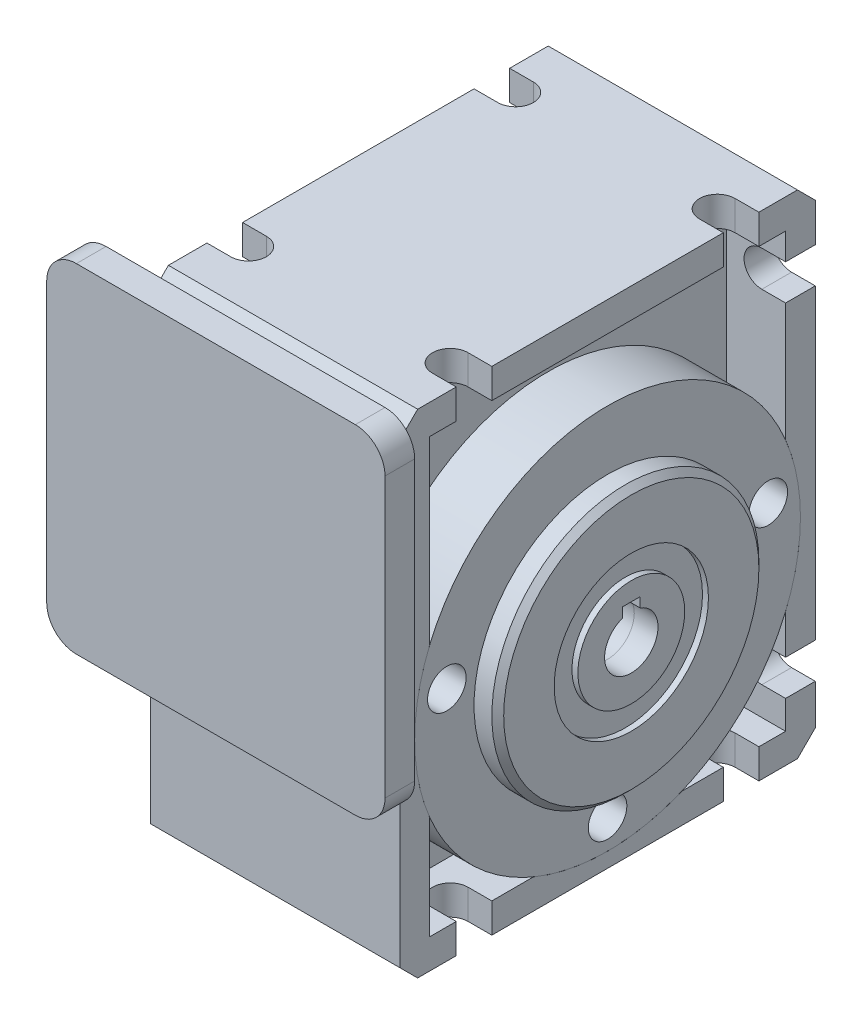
ISO-10303-21;
HEADER;
FILE_DESCRIPTION(('STEP AP214'),'2;1');
FILE_NAME('part.step','',(''),(''),'','','');
FILE_SCHEMA(('AUTOMOTIVE_DESIGN { 1 0 10303 214 1 1 1 1 }'));
ENDSEC;
DATA;
#1=APPLICATION_CONTEXT('core data for automotive mechanical design processes');
#2=APPLICATION_PROTOCOL_DEFINITION('international standard','automotive_design',2000,#1);
#3=PRODUCT_CONTEXT('',#1,'mechanical');
#4=PRODUCT('Part','Part','',(#3));
#5=PRODUCT_RELATED_PRODUCT_CATEGORY('part','',(#4));
#6=PRODUCT_DEFINITION_FORMATION('','',#4);
#7=PRODUCT_DEFINITION_CONTEXT('part definition',#1,'design');
#8=PRODUCT_DEFINITION('design','',#6,#7);
#9=PRODUCT_DEFINITION_SHAPE('','',#8);
#10=(LENGTH_UNIT() NAMED_UNIT(*) SI_UNIT(.MILLI.,.METRE.));
#11=(NAMED_UNIT(*) PLANE_ANGLE_UNIT() SI_UNIT($,.RADIAN.));
#12=(NAMED_UNIT(*) SI_UNIT($,.STERADIAN.) SOLID_ANGLE_UNIT());
#13=UNCERTAINTY_MEASURE_WITH_UNIT(LENGTH_MEASURE(1.E-05),#10,'distance_accuracy_value','');
#14=(GEOMETRIC_REPRESENTATION_CONTEXT(3) GLOBAL_UNCERTAINTY_ASSIGNED_CONTEXT((#13)) GLOBAL_UNIT_ASSIGNED_CONTEXT((#10,
#11,#12)) REPRESENTATION_CONTEXT('',''));
#15=CARTESIAN_POINT('',(0.,0.,0.));
#16=DIRECTION('',(0.,0.,1.));
#17=DIRECTION('',(1.,0.,0.));
#18=AXIS2_PLACEMENT_3D('',#15,#16,#17);
#19=CARTESIAN_POINT('',(-46.,-6.5,0.));
#20=DIRECTION('',(-1.,0.,0.));
#21=DIRECTION('',(0.,0.,1.));
#22=AXIS2_PLACEMENT_3D('',#19,#20,#21);
#23=PLANE('',#22);
#24=CARTESIAN_POINT('',(-46.,-6.5,0.));
#25=DIRECTION('',(-1.,0.,0.));
#26=DIRECTION('',(0.,0.,1.));
#27=AXIS2_PLACEMENT_3D('',#24,#25,#26);
#28=CIRCLE('',#27,4.5);
#29=CARTESIAN_POINT('',(-46.,-2.25735931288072,-1.5));
#30=VERTEX_POINT('',#29);
#31=CARTESIAN_POINT('',(-46.,-2.25735931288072,1.5));
#32=VERTEX_POINT('',#31);
#33=EDGE_CURVE('E211',#30,#32,#28,.T.);
#34=ORIENTED_EDGE('',*,*,#33,.F.);
#35=DIRECTION('',(0.,-1.,0.));
#36=VECTOR('',#35,1.);
#37=CARTESIAN_POINT('',(-46.,-0.600000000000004,-1.5));
#38=LINE('',#37,#36);
#39=CARTESIAN_POINT('',(-46.,-0.600000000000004,-1.5));
#40=VERTEX_POINT('',#39);
#41=EDGE_CURVE('E255',#40,#30,#38,.T.);
#42=ORIENTED_EDGE('',*,*,#41,.F.);
#43=DIRECTION('',(0.,0.,-1.));
#44=VECTOR('',#43,1.);
#45=CARTESIAN_POINT('',(-46.,-0.600000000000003,1.5));
#46=LINE('',#45,#44);
#47=CARTESIAN_POINT('',(-46.,-0.600000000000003,1.5));
#48=VERTEX_POINT('',#47);
#49=EDGE_CURVE('E240',#48,#40,#46,.T.);
#50=ORIENTED_EDGE('',*,*,#49,.F.);
#51=DIRECTION('',(0.,1.,0.));
#52=VECTOR('',#51,1.);
#53=CARTESIAN_POINT('',(-46.,-2.25735931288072,1.5));
#54=LINE('',#53,#52);
#55=EDGE_CURVE('E249',#32,#48,#54,.T.);
#56=ORIENTED_EDGE('',*,*,#55,.F.);
#57=EDGE_LOOP('',(#34,#42,#50,#56));
#58=FACE_BOUND('',#57,.T.);
#59=CARTESIAN_POINT('',(-46.,-6.5,0.));
#60=DIRECTION('',(-1.,0.,0.));
#61=DIRECTION('',(0.,0.,1.));
#62=AXIS2_PLACEMENT_3D('',#59,#60,#61);
#63=CIRCLE('',#62,9.);
#64=CARTESIAN_POINT('',(-46.,-6.5,9.00000000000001));
#65=VERTEX_POINT('',#64);
#66=EDGE_CURVE('E319',#65,#65,#63,.T.);
#67=ORIENTED_EDGE('',*,*,#66,.T.);
#68=EDGE_LOOP('',(#67));
#69=FACE_BOUND('',#68,.T.);
#70=ADVANCED_FACE('F196',(#58,#69),#23,.T.);
#71=CARTESIAN_POINT('',(-46.,-6.5,0.));
#72=DIRECTION('',(1.,0.,0.));
#73=DIRECTION('',(0.,0.,-1.));
#74=AXIS2_PLACEMENT_3D('',#71,#72,#73);
#75=CYLINDRICAL_SURFACE('',#74,22.5);
#76=CARTESIAN_POINT('',(-45.,-6.5,0.));
#77=DIRECTION('',(-1.,0.,0.));
#78=DIRECTION('',(0.,0.,1.));
#79=AXIS2_PLACEMENT_3D('',#76,#77,#78);
#80=CIRCLE('',#79,22.5);
#81=CARTESIAN_POINT('',(-45.,-6.5,22.5));
#82=VERTEX_POINT('',#81);
#83=EDGE_CURVE('E270',#82,#82,#80,.F.);
#84=ORIENTED_EDGE('',*,*,#83,.T.);
#85=EDGE_LOOP('',(#84));
#86=FACE_BOUND('',#85,.T.);
#87=CARTESIAN_POINT('',(-42.,-6.5,0.));
#88=DIRECTION('',(-1.,0.,0.));
#89=DIRECTION('',(0.,0.,1.));
#90=AXIS2_PLACEMENT_3D('',#87,#88,#89);
#91=CIRCLE('',#90,22.5);
#92=CARTESIAN_POINT('',(-42.,-6.5,22.5));
#93=VERTEX_POINT('',#92);
#94=EDGE_CURVE('E262',#93,#93,#91,.T.);
#95=ORIENTED_EDGE('',*,*,#94,.T.);
#96=EDGE_LOOP('',(#95));
#97=FACE_BOUND('',#96,.T.);
#98=ADVANCED_FACE('F294',(#86,#97),#75,.T.);
#99=CARTESIAN_POINT('',(-46.,-6.5,0.));
#100=DIRECTION('',(-1.,0.,0.));
#101=DIRECTION('',(0.,0.,1.));
#102=AXIS2_PLACEMENT_3D('',#99,#100,#101);
#103=CIRCLE('',#102,13.);
#104=CARTESIAN_POINT('',(-46.,-6.5,13.));
#105=VERTEX_POINT('',#104);
#106=EDGE_CURVE('E309',#105,#105,#103,.T.);
#107=ORIENTED_EDGE('',*,*,#106,.F.);
#108=EDGE_LOOP('',(#107));
#109=FACE_BOUND('',#108,.T.);
#110=CARTESIAN_POINT('',(-46.,-6.5,0.));
#111=DIRECTION('',(-1.,0.,0.));
#112=DIRECTION('',(0.,0.,1.));
#113=AXIS2_PLACEMENT_3D('',#110,#111,#112);
#114=CIRCLE('',#113,21.5);
#115=CARTESIAN_POINT('',(-46.,-6.5,21.5));
#116=VERTEX_POINT('',#115);
#117=EDGE_CURVE('E267',#116,#116,#114,.T.);
#118=ORIENTED_EDGE('',*,*,#117,.T.);
#119=EDGE_LOOP('',(#118));
#120=FACE_BOUND('',#119,.T.);
#121=ADVANCED_FACE('F295',(#109,#120),#23,.T.);
#122=CARTESIAN_POINT('',(-42.,-6.5,0.));
#123=DIRECTION('',(-1.,0.,0.));
#124=DIRECTION('',(0.,0.,1.));
#125=AXIS2_PLACEMENT_3D('',#122,#123,#124);
#126=PLANE('',#125);
#127=DIRECTION('',(0.,-1.,0.));
#128=VECTOR('',#127,1.);
#129=CARTESIAN_POINT('',(-42.,-6.5,-1.5));
#130=LINE('',#129,#128);
#131=CARTESIAN_POINT('',(-42.,-0.600000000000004,-1.5));
#132=VERTEX_POINT('',#131);
#133=CARTESIAN_POINT('',(-42.,-2.25735931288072,-1.5));
#134=VERTEX_POINT('',#133);
#135=EDGE_CURVE('E204',#132,#134,#130,.T.);
#136=ORIENTED_EDGE('',*,*,#135,.T.);
#137=CARTESIAN_POINT('',(-42.,-6.5,0.));
#138=DIRECTION('',(-1.,0.,0.));
#139=DIRECTION('',(0.,0.,1.));
#140=AXIS2_PLACEMENT_3D('',#137,#138,#139);
#141=CIRCLE('',#140,4.5);
#142=CARTESIAN_POINT('',(-42.,-2.25735931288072,1.5));
#143=VERTEX_POINT('',#142);
#144=EDGE_CURVE('E13',#134,#143,#141,.T.);
#145=ORIENTED_EDGE('',*,*,#144,.T.);
#146=DIRECTION('',(0.,1.,0.));
#147=VECTOR('',#146,1.);
#148=CARTESIAN_POINT('',(-42.,-6.5,1.5));
#149=LINE('',#148,#147);
#150=CARTESIAN_POINT('',(-42.,-0.600000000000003,1.5));
#151=VERTEX_POINT('',#150);
#152=EDGE_CURVE('E273',#143,#151,#149,.T.);
#153=ORIENTED_EDGE('',*,*,#152,.T.);
#154=DIRECTION('',(0.,0.,-1.));
#155=VECTOR('',#154,1.);
#156=CARTESIAN_POINT('',(-42.,-0.600000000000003,0.));
#157=LINE('',#156,#155);
#158=EDGE_CURVE('E243',#151,#132,#157,.T.);
#159=ORIENTED_EDGE('',*,*,#158,.T.);
#160=EDGE_LOOP('',(#136,#145,#153,#159));
#161=FACE_BOUND('',#160,.T.);
#162=ORIENTED_EDGE('',*,*,#94,.F.);
#163=EDGE_LOOP('',(#162));
#164=FACE_BOUND('',#163,.T.);
#165=ADVANCED_FACE('F277',(#161,#164),#126,.F.);
#166=CARTESIAN_POINT('',(-46.,-6.5,0.));
#167=DIRECTION('',(1.,0.,0.));
#168=DIRECTION('',(0.,0.,-1.));
#169=AXIS2_PLACEMENT_3D('',#166,#167,#168);
#170=CONICAL_SURFACE('',#169,21.5,0.785398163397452);
#171=ORIENTED_EDGE('',*,*,#83,.F.);
#172=EDGE_LOOP('',(#171));
#173=FACE_BOUND('',#172,.T.);
#174=ORIENTED_EDGE('',*,*,#117,.F.);
#175=EDGE_LOOP('',(#174));
#176=FACE_BOUND('',#175,.T.);
#177=ADVANCED_FACE('F198',(#173,#176),#170,.T.);
#178=CARTESIAN_POINT('',(4.,-6.5,0.));
#179=DIRECTION('',(-1.,0.,0.));
#180=DIRECTION('',(0.,0.,1.));
#181=AXIS2_PLACEMENT_3D('',#178,#179,#180);
#182=CYLINDRICAL_SURFACE('',#181,4.5);
#183=DIRECTION('',(-1.,0.,0.));
#184=VECTOR('',#183,1.);
#185=CARTESIAN_POINT('',(4.,-2.25735931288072,-1.5));
#186=LINE('',#185,#184);
#187=EDGE_CURVE('E260',#134,#30,#186,.T.);
#188=ORIENTED_EDGE('',*,*,#187,.T.);
#189=ORIENTED_EDGE('',*,*,#33,.T.);
#190=DIRECTION('',(-1.,0.,0.));
#191=VECTOR('',#190,1.);
#192=CARTESIAN_POINT('',(4.,-2.25735931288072,1.5));
#193=LINE('',#192,#191);
#194=EDGE_CURVE('E246',#143,#32,#193,.T.);
#195=ORIENTED_EDGE('',*,*,#194,.F.);
#196=ORIENTED_EDGE('',*,*,#144,.F.);
#197=EDGE_LOOP('',(#188,#189,#195,#196));
#198=FACE_BOUND('',#197,.T.);
#199=ADVANCED_FACE('F282',(#198),#182,.F.);
#200=CARTESIAN_POINT('',(4.,-0.600000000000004,-1.5));
#201=DIRECTION('',(0.,0.,-1.));
#202=DIRECTION('',(-1.,0.,0.));
#203=AXIS2_PLACEMENT_3D('',#200,#201,#202);
#204=PLANE('',#203);
#205=DIRECTION('',(-1.,0.,0.));
#206=VECTOR('',#205,1.);
#207=CARTESIAN_POINT('',(4.,-0.600000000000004,-1.5));
#208=LINE('',#207,#206);
#209=EDGE_CURVE('E245',#132,#40,#208,.T.);
#210=ORIENTED_EDGE('',*,*,#209,.T.);
#211=ORIENTED_EDGE('',*,*,#41,.T.);
#212=ORIENTED_EDGE('',*,*,#187,.F.);
#213=ORIENTED_EDGE('',*,*,#135,.F.);
#214=EDGE_LOOP('',(#210,#211,#212,#213));
#215=FACE_BOUND('',#214,.T.);
#216=ADVANCED_FACE('F281',(#215),#204,.F.);
#217=CARTESIAN_POINT('',(4.,-0.600000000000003,1.5));
#218=DIRECTION('',(0.,1.,0.));
#219=DIRECTION('',(0.,0.,1.));
#220=AXIS2_PLACEMENT_3D('',#217,#218,#219);
#221=PLANE('',#220);
#222=DIRECTION('',(-1.,0.,0.));
#223=VECTOR('',#222,1.);
#224=CARTESIAN_POINT('',(4.,-0.600000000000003,1.5));
#225=LINE('',#224,#223);
#226=EDGE_CURVE('E219',#151,#48,#225,.T.);
#227=ORIENTED_EDGE('',*,*,#226,.T.);
#228=ORIENTED_EDGE('',*,*,#49,.T.);
#229=ORIENTED_EDGE('',*,*,#209,.F.);
#230=ORIENTED_EDGE('',*,*,#158,.F.);
#231=EDGE_LOOP('',(#227,#228,#229,#230));
#232=FACE_BOUND('',#231,.T.);
#233=ADVANCED_FACE('F237',(#232),#221,.F.);
#234=CARTESIAN_POINT('',(4.,-2.25735931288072,1.5));
#235=DIRECTION('',(0.,0.,1.));
#236=DIRECTION('',(1.,0.,0.));
#237=AXIS2_PLACEMENT_3D('',#234,#235,#236);
#238=PLANE('',#237);
#239=ORIENTED_EDGE('',*,*,#194,.T.);
#240=ORIENTED_EDGE('',*,*,#55,.T.);
#241=ORIENTED_EDGE('',*,*,#226,.F.);
#242=ORIENTED_EDGE('',*,*,#152,.F.);
#243=EDGE_LOOP('',(#239,#240,#241,#242));
#244=FACE_BOUND('',#243,.T.);
#245=ADVANCED_FACE('F250',(#244),#238,.F.);
#246=CARTESIAN_POINT('',(-45.,-6.5,0.));
#247=DIRECTION('',(-1.,0.,0.));
#248=DIRECTION('',(0.,0.,1.));
#249=AXIS2_PLACEMENT_3D('',#246,#247,#248);
#250=CYLINDRICAL_SURFACE('',#249,13.);
#251=CARTESIAN_POINT('',(-45.,-6.5,0.));
#252=DIRECTION('',(-1.,0.,0.));
#253=DIRECTION('',(0.,0.,1.));
#254=AXIS2_PLACEMENT_3D('',#251,#252,#253);
#255=CIRCLE('',#254,13.);
#256=CARTESIAN_POINT('',(-45.,-6.5,13.));
#257=VERTEX_POINT('',#256);
#258=EDGE_CURVE('E313',#257,#257,#255,.T.);
#259=ORIENTED_EDGE('',*,*,#258,.F.);
#260=EDGE_LOOP('',(#259));
#261=FACE_BOUND('',#260,.T.);
#262=ORIENTED_EDGE('',*,*,#106,.T.);
#263=EDGE_LOOP('',(#262));
#264=FACE_BOUND('',#263,.T.);
#265=ADVANCED_FACE('F333',(#261,#264),#250,.F.);
#266=CARTESIAN_POINT('',(-45.,-6.5,0.));
#267=DIRECTION('',(-1.,0.,0.));
#268=DIRECTION('',(0.,0.,1.));
#269=AXIS2_PLACEMENT_3D('',#266,#267,#268);
#270=PLANE('',#269);
#271=CARTESIAN_POINT('',(-45.,-6.5,0.));
#272=DIRECTION('',(-1.,0.,0.));
#273=DIRECTION('',(0.,0.,1.));
#274=AXIS2_PLACEMENT_3D('',#271,#272,#273);
#275=CIRCLE('',#274,9.);
#276=CARTESIAN_POINT('',(-45.,-6.5,9.00000000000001));
#277=VERTEX_POINT('',#276);
#278=EDGE_CURVE('E314',#277,#277,#275,.T.);
#279=ORIENTED_EDGE('',*,*,#278,.F.);
#280=EDGE_LOOP('',(#279));
#281=FACE_BOUND('',#280,.T.);
#282=ORIENTED_EDGE('',*,*,#258,.T.);
#283=EDGE_LOOP('',(#282));
#284=FACE_BOUND('',#283,.T.);
#285=ADVANCED_FACE('F327',(#281,#284),#270,.T.);
#286=CARTESIAN_POINT('',(-45.,-6.5,0.));
#287=DIRECTION('',(-1.,0.,0.));
#288=DIRECTION('',(0.,0.,1.));
#289=AXIS2_PLACEMENT_3D('',#286,#287,#288);
#290=CYLINDRICAL_SURFACE('',#289,9.);
#291=ORIENTED_EDGE('',*,*,#278,.T.);
#292=EDGE_LOOP('',(#291));
#293=FACE_BOUND('',#292,.T.);
#294=ORIENTED_EDGE('',*,*,#66,.F.);
#295=EDGE_LOOP('',(#294));
#296=FACE_BOUND('',#295,.T.);
#297=ADVANCED_FACE('F325',(#293,#296),#290,.T.);
#298=CLOSED_SHELL('',(#70,#98,#121,#165,#177,#199,#216,#233,#245,#265,#285,#297));
#299=MANIFOLD_SOLID_BREP('B2',#298);
#300=CARTESIAN_POINT('',(4.,-6.5,0.));
#301=DIRECTION('',(1.,0.,0.));
#302=DIRECTION('',(0.,0.,-1.));
#303=AXIS2_PLACEMENT_3D('',#300,#301,#302);
#304=PLANE('',#303);
#305=CARTESIAN_POINT('',(4.,-6.5,0.));
#306=DIRECTION('',(-1.,0.,0.));
#307=DIRECTION('',(0.,0.,1.));
#308=AXIS2_PLACEMENT_3D('',#305,#306,#307);
#309=CIRCLE('',#308,4.5);
#310=CARTESIAN_POINT('',(4.,-2.25735931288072,-1.5));
#311=VERTEX_POINT('',#310);
#312=CARTESIAN_POINT('',(4.,-2.25735931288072,1.5));
#313=VERTEX_POINT('',#312);
#314=EDGE_CURVE('E469',#311,#313,#309,.T.);
#315=ORIENTED_EDGE('',*,*,#314,.T.);
#316=DIRECTION('',(0.,1.,0.));
#317=VECTOR('',#316,1.);
#318=CARTESIAN_POINT('',(4.,-2.25735931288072,1.5));
#319=LINE('',#318,#317);
#320=CARTESIAN_POINT('',(4.,-0.600000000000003,1.5));
#321=VERTEX_POINT('',#320);
#322=EDGE_CURVE('E476',#313,#321,#319,.T.);
#323=ORIENTED_EDGE('',*,*,#322,.T.);
#324=DIRECTION('',(0.,0.,-1.));
#325=VECTOR('',#324,1.);
#326=CARTESIAN_POINT('',(4.,-0.600000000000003,1.5));
#327=LINE('',#326,#325);
#328=CARTESIAN_POINT('',(4.,-0.600000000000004,-1.5));
#329=VERTEX_POINT('',#328);
#330=EDGE_CURVE('E440',#321,#329,#327,.T.);
#331=ORIENTED_EDGE('',*,*,#330,.T.);
#332=DIRECTION('',(0.,-1.,0.));
#333=VECTOR('',#332,1.);
#334=CARTESIAN_POINT('',(4.,-0.600000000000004,-1.5));
#335=LINE('',#334,#333);
#336=EDGE_CURVE('E473',#329,#311,#335,.T.);
#337=ORIENTED_EDGE('',*,*,#336,.T.);
#338=EDGE_LOOP('',(#315,#323,#331,#337));
#339=FACE_BOUND('',#338,.T.);
#340=CARTESIAN_POINT('',(4.,-6.5,0.));
#341=DIRECTION('',(1.,0.,0.));
#342=DIRECTION('',(0.,0.,-1.));
#343=AXIS2_PLACEMENT_3D('',#340,#341,#342);
#344=CIRCLE('',#343,9.);
#345=CARTESIAN_POINT('',(4.,-6.5,-8.99999999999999));
#346=VERTEX_POINT('',#345);
#347=EDGE_CURVE('E620',#346,#346,#344,.T.);
#348=ORIENTED_EDGE('',*,*,#347,.T.);
#349=EDGE_LOOP('',(#348));
#350=FACE_BOUND('',#349,.T.);
#351=ADVANCED_FACE('F425',(#339,#350),#304,.T.);
#352=CARTESIAN_POINT('',(4.,-6.5,0.));
#353=DIRECTION('',(-1.,0.,0.));
#354=DIRECTION('',(0.,0.,1.));
#355=AXIS2_PLACEMENT_3D('',#352,#353,#354);
#356=CYLINDRICAL_SURFACE('',#355,22.5);
#357=CARTESIAN_POINT('',(2.99999999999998,-6.5,0.));
#358=DIRECTION('',(1.,0.,0.));
#359=DIRECTION('',(0.,0.,-1.));
#360=AXIS2_PLACEMENT_3D('',#357,#358,#359);
#361=CIRCLE('',#360,22.5);
#362=CARTESIAN_POINT('',(2.99999999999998,-6.5,-22.5));
#363=VERTEX_POINT('',#362);
#364=EDGE_CURVE('E503',#363,#363,#361,.F.);
#365=ORIENTED_EDGE('',*,*,#364,.T.);
#366=EDGE_LOOP('',(#365));
#367=FACE_BOUND('',#366,.T.);
#368=CARTESIAN_POINT('',(0.,-6.5,0.));
#369=DIRECTION('',(1.,0.,0.));
#370=DIRECTION('',(0.,0.,-1.));
#371=AXIS2_PLACEMENT_3D('',#368,#369,#370);
#372=CIRCLE('',#371,22.5);
#373=CARTESIAN_POINT('',(0.,-6.5,-22.5));
#374=VERTEX_POINT('',#373);
#375=EDGE_CURVE('E493',#374,#374,#372,.T.);
#376=ORIENTED_EDGE('',*,*,#375,.T.);
#377=EDGE_LOOP('',(#376));
#378=FACE_BOUND('',#377,.T.);
#379=ADVANCED_FACE('F527',(#367,#378),#356,.T.);
#380=CARTESIAN_POINT('',(4.,-6.5,0.));
#381=DIRECTION('',(1.,0.,0.));
#382=DIRECTION('',(0.,0.,-1.));
#383=AXIS2_PLACEMENT_3D('',#380,#381,#382);
#384=CIRCLE('',#383,13.);
#385=CARTESIAN_POINT('',(4.,-6.5,-13.));
#386=VERTEX_POINT('',#385);
#387=EDGE_CURVE('E485',#386,#386,#384,.T.);
#388=ORIENTED_EDGE('',*,*,#387,.F.);
#389=EDGE_LOOP('',(#388));
#390=FACE_BOUND('',#389,.T.);
#391=CARTESIAN_POINT('',(4.,-6.5,0.));
#392=DIRECTION('',(1.,0.,0.));
#393=DIRECTION('',(0.,0.,-1.));
#394=AXIS2_PLACEMENT_3D('',#391,#392,#393);
#395=CIRCLE('',#394,21.5);
#396=CARTESIAN_POINT('',(4.,-6.5,-21.5));
#397=VERTEX_POINT('',#396);
#398=EDGE_CURVE('E500',#397,#397,#395,.T.);
#399=ORIENTED_EDGE('',*,*,#398,.T.);
#400=EDGE_LOOP('',(#399));
#401=FACE_BOUND('',#400,.T.);
#402=ADVANCED_FACE('F529',(#390,#401),#304,.T.);
#403=CARTESIAN_POINT('',(0.,-6.5,0.));
#404=DIRECTION('',(1.,0.,0.));
#405=DIRECTION('',(0.,0.,-1.));
#406=AXIS2_PLACEMENT_3D('',#403,#404,#405);
#407=PLANE('',#406);
#408=DIRECTION('',(0.,-1.,0.));
#409=VECTOR('',#408,1.);
#410=CARTESIAN_POINT('',(0.,-6.5,1.5));
#411=LINE('',#410,#409);
#412=CARTESIAN_POINT('',(0.,-0.600000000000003,1.5));
#413=VERTEX_POINT('',#412);
#414=CARTESIAN_POINT('',(0.,-2.25735931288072,1.5));
#415=VERTEX_POINT('',#414);
#416=EDGE_CURVE('E506',#413,#415,#411,.T.);
#417=ORIENTED_EDGE('',*,*,#416,.T.);
#418=CARTESIAN_POINT('',(0.,-6.5,0.));
#419=DIRECTION('',(1.,0.,0.));
#420=DIRECTION('',(0.,0.,-1.));
#421=AXIS2_PLACEMENT_3D('',#418,#419,#420);
#422=CIRCLE('',#421,4.5);
#423=CARTESIAN_POINT('',(0.,-2.25735931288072,-1.5));
#424=VERTEX_POINT('',#423);
#425=EDGE_CURVE('E194',#415,#424,#422,.T.);
#426=ORIENTED_EDGE('',*,*,#425,.T.);
#427=DIRECTION('',(0.,1.,0.));
#428=VECTOR('',#427,1.);
#429=CARTESIAN_POINT('',(0.,-6.5,-1.5));
#430=LINE('',#429,#428);
#431=CARTESIAN_POINT('',(0.,-0.600000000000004,-1.5));
#432=VERTEX_POINT('',#431);
#433=EDGE_CURVE('E433',#424,#432,#430,.T.);
#434=ORIENTED_EDGE('',*,*,#433,.T.);
#435=DIRECTION('',(0.,0.,1.));
#436=VECTOR('',#435,1.);
#437=CARTESIAN_POINT('',(0.,-0.600000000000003,0.));
#438=LINE('',#437,#436);
#439=EDGE_CURVE('E508',#432,#413,#438,.T.);
#440=ORIENTED_EDGE('',*,*,#439,.T.);
#441=EDGE_LOOP('',(#417,#426,#434,#440));
#442=FACE_BOUND('',#441,.T.);
#443=ORIENTED_EDGE('',*,*,#375,.F.);
#444=EDGE_LOOP('',(#443));
#445=FACE_BOUND('',#444,.T.);
#446=ADVANCED_FACE('F512',(#442,#445),#407,.F.);
#447=CARTESIAN_POINT('',(4.,-6.5,0.));
#448=DIRECTION('',(-1.,0.,0.));
#449=DIRECTION('',(0.,0.,1.));
#450=AXIS2_PLACEMENT_3D('',#447,#448,#449);
#451=CONICAL_SURFACE('',#450,21.5,0.785398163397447);
#452=ORIENTED_EDGE('',*,*,#364,.F.);
#453=EDGE_LOOP('',(#452));
#454=FACE_BOUND('',#453,.T.);
#455=ORIENTED_EDGE('',*,*,#398,.F.);
#456=EDGE_LOOP('',(#455));
#457=FACE_BOUND('',#456,.T.);
#458=ADVANCED_FACE('F427',(#454,#457),#451,.T.);
#459=CARTESIAN_POINT('',(4.,-6.5,0.));
#460=DIRECTION('',(-1.,0.,0.));
#461=DIRECTION('',(0.,0.,1.));
#462=AXIS2_PLACEMENT_3D('',#459,#460,#461);
#463=CYLINDRICAL_SURFACE('',#462,4.5);
#464=DIRECTION('',(-1.,0.,0.));
#465=VECTOR('',#464,1.);
#466=CARTESIAN_POINT('',(4.,-2.25735931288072,1.5));
#467=LINE('',#466,#465);
#468=EDGE_CURVE('E448',#313,#415,#467,.T.);
#469=ORIENTED_EDGE('',*,*,#468,.F.);
#470=ORIENTED_EDGE('',*,*,#314,.F.);
#471=DIRECTION('',(-1.,0.,0.));
#472=VECTOR('',#471,1.);
#473=CARTESIAN_POINT('',(4.,-2.25735931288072,-1.5));
#474=LINE('',#473,#472);
#475=EDGE_CURVE('E491',#311,#424,#474,.T.);
#476=ORIENTED_EDGE('',*,*,#475,.T.);
#477=ORIENTED_EDGE('',*,*,#425,.F.);
#478=EDGE_LOOP('',(#469,#470,#476,#477));
#479=FACE_BOUND('',#478,.T.);
#480=ADVANCED_FACE('F466',(#479),#463,.F.);
#481=CARTESIAN_POINT('',(4.,-0.600000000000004,-1.5));
#482=DIRECTION('',(0.,0.,-1.));
#483=DIRECTION('',(-1.,0.,0.));
#484=AXIS2_PLACEMENT_3D('',#481,#482,#483);
#485=PLANE('',#484);
#486=ORIENTED_EDGE('',*,*,#475,.F.);
#487=ORIENTED_EDGE('',*,*,#336,.F.);
#488=DIRECTION('',(-1.,0.,0.));
#489=VECTOR('',#488,1.);
#490=CARTESIAN_POINT('',(4.,-0.600000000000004,-1.5));
#491=LINE('',#490,#489);
#492=EDGE_CURVE('E494',#329,#432,#491,.T.);
#493=ORIENTED_EDGE('',*,*,#492,.T.);
#494=ORIENTED_EDGE('',*,*,#433,.F.);
#495=EDGE_LOOP('',(#486,#487,#493,#494));
#496=FACE_BOUND('',#495,.T.);
#497=ADVANCED_FACE('F515',(#496),#485,.F.);
#498=CARTESIAN_POINT('',(4.,-0.600000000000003,1.5));
#499=DIRECTION('',(0.,1.,0.));
#500=DIRECTION('',(0.,0.,1.));
#501=AXIS2_PLACEMENT_3D('',#498,#499,#500);
#502=PLANE('',#501);
#503=ORIENTED_EDGE('',*,*,#492,.F.);
#504=ORIENTED_EDGE('',*,*,#330,.F.);
#505=DIRECTION('',(-1.,0.,0.));
#506=VECTOR('',#505,1.);
#507=CARTESIAN_POINT('',(4.,-0.600000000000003,1.5));
#508=LINE('',#507,#506);
#509=EDGE_CURVE('E472',#321,#413,#508,.T.);
#510=ORIENTED_EDGE('',*,*,#509,.T.);
#511=ORIENTED_EDGE('',*,*,#439,.F.);
#512=EDGE_LOOP('',(#503,#504,#510,#511));
#513=FACE_BOUND('',#512,.T.);
#514=ADVANCED_FACE('F516',(#513),#502,.F.);
#515=CARTESIAN_POINT('',(4.,-2.25735931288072,1.5));
#516=DIRECTION('',(0.,0.,1.));
#517=DIRECTION('',(1.,0.,0.));
#518=AXIS2_PLACEMENT_3D('',#515,#516,#517);
#519=PLANE('',#518);
#520=ORIENTED_EDGE('',*,*,#509,.F.);
#521=ORIENTED_EDGE('',*,*,#322,.F.);
#522=ORIENTED_EDGE('',*,*,#468,.T.);
#523=ORIENTED_EDGE('',*,*,#416,.F.);
#524=EDGE_LOOP('',(#520,#521,#522,#523));
#525=FACE_BOUND('',#524,.T.);
#526=ADVANCED_FACE('F477',(#525),#519,.F.);
#527=CARTESIAN_POINT('',(3.,-6.5,0.));
#528=DIRECTION('',(1.,0.,0.));
#529=DIRECTION('',(0.,0.,-1.));
#530=AXIS2_PLACEMENT_3D('',#527,#528,#529);
#531=CYLINDRICAL_SURFACE('',#530,13.);
#532=CARTESIAN_POINT('',(3.,-6.5,0.));
#533=DIRECTION('',(1.,0.,0.));
#534=DIRECTION('',(0.,0.,-1.));
#535=AXIS2_PLACEMENT_3D('',#532,#533,#534);
#536=CIRCLE('',#535,13.);
#537=CARTESIAN_POINT('',(3.,-6.5,-13.));
#538=VERTEX_POINT('',#537);
#539=EDGE_CURVE('E482',#538,#538,#536,.T.);
#540=ORIENTED_EDGE('',*,*,#539,.F.);
#541=EDGE_LOOP('',(#540));
#542=FACE_BOUND('',#541,.T.);
#543=ORIENTED_EDGE('',*,*,#387,.T.);
#544=EDGE_LOOP('',(#543));
#545=FACE_BOUND('',#544,.T.);
#546=ADVANCED_FACE('F523',(#542,#545),#531,.F.);
#547=CARTESIAN_POINT('',(3.,-6.5,0.));
#548=DIRECTION('',(1.,0.,0.));
#549=DIRECTION('',(0.,0.,-1.));
#550=AXIS2_PLACEMENT_3D('',#547,#548,#549);
#551=PLANE('',#550);
#552=CARTESIAN_POINT('',(3.,-6.5,0.));
#553=DIRECTION('',(1.,0.,0.));
#554=DIRECTION('',(0.,0.,-1.));
#555=AXIS2_PLACEMENT_3D('',#552,#553,#554);
#556=CIRCLE('',#555,9.);
#557=CARTESIAN_POINT('',(3.,-6.5,-8.99999999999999));
#558=VERTEX_POINT('',#557);
#559=EDGE_CURVE('E617',#558,#558,#556,.T.);
#560=ORIENTED_EDGE('',*,*,#559,.F.);
#561=EDGE_LOOP('',(#560));
#562=FACE_BOUND('',#561,.T.);
#563=ORIENTED_EDGE('',*,*,#539,.T.);
#564=EDGE_LOOP('',(#563));
#565=FACE_BOUND('',#564,.T.);
#566=ADVANCED_FACE('F590',(#562,#565),#551,.T.);
#567=CARTESIAN_POINT('',(3.,-6.5,0.));
#568=DIRECTION('',(1.,0.,0.));
#569=DIRECTION('',(0.,0.,-1.));
#570=AXIS2_PLACEMENT_3D('',#567,#568,#569);
#571=CYLINDRICAL_SURFACE('',#570,9.);
#572=ORIENTED_EDGE('',*,*,#559,.T.);
#573=EDGE_LOOP('',(#572));
#574=FACE_BOUND('',#573,.T.);
#575=ORIENTED_EDGE('',*,*,#347,.F.);
#576=EDGE_LOOP('',(#575));
#577=FACE_BOUND('',#576,.T.);
#578=ADVANCED_FACE('F600',(#574,#577),#571,.T.);
#579=CLOSED_SHELL('',(#351,#379,#402,#446,#458,#480,#497,#514,#526,#546,#566,#578));
#580=MANIFOLD_SOLID_BREP('B7',#579);
#581=CARTESIAN_POINT('',(0.,-6.5,0.));
#582=DIRECTION('',(-1.,0.,0.));
#583=DIRECTION('',(0.,0.,1.));
#584=AXIS2_PLACEMENT_3D('',#581,#582,#583);
#585=CYLINDRICAL_SURFACE('',#584,32.5);
#586=CARTESIAN_POINT('',(0.,-6.5,0.));
#587=DIRECTION('',(1.,0.,0.));
#588=DIRECTION('',(0.,0.,-1.));
#589=AXIS2_PLACEMENT_3D('',#586,#587,#588);
#590=CIRCLE('',#589,32.5);
#591=CARTESIAN_POINT('',(0.,-6.5,-32.5));
#592=VERTEX_POINT('',#591);
#593=EDGE_CURVE('E733',#592,#592,#590,.T.);
#594=ORIENTED_EDGE('',*,*,#593,.F.);
#595=EDGE_LOOP('',(#594));
#596=FACE_BOUND('',#595,.T.);
#597=CARTESIAN_POINT('',(-10.,-6.5,0.));
#598=DIRECTION('',(1.,0.,0.));
#599=DIRECTION('',(0.,0.,-1.));
#600=AXIS2_PLACEMENT_3D('',#597,#598,#599);
#601=CIRCLE('',#600,32.5);
#602=CARTESIAN_POINT('',(-10.,-6.5,-32.5));
#603=VERTEX_POINT('',#602);
#604=EDGE_CURVE('E730',#603,#603,#601,.T.);
#605=ORIENTED_EDGE('',*,*,#604,.T.);
#606=EDGE_LOOP('',(#605));
#607=FACE_BOUND('',#606,.T.);
#608=ADVANCED_FACE('F654',(#596,#607),#585,.T.);
#609=CARTESIAN_POINT('',(0.,-6.5,0.));
#610=DIRECTION('',(1.,0.,0.));
#611=DIRECTION('',(0.,0.,-1.));
#612=AXIS2_PLACEMENT_3D('',#609,#610,#611);
#613=PLANE('',#612);
#614=CARTESIAN_POINT('',(0.,-6.5,0.));
#615=DIRECTION('',(1.,0.,0.));
#616=DIRECTION('',(0.,0.,-1.));
#617=AXIS2_PLACEMENT_3D('',#614,#615,#616);
#618=CIRCLE('',#617,4.5);
#619=CARTESIAN_POINT('',(0.,-2.25735931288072,1.5));
#620=VERTEX_POINT('',#619);
#621=CARTESIAN_POINT('',(0.,-2.25735931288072,-1.5));
#622=VERTEX_POINT('',#621);
#623=EDGE_CURVE('E702',#620,#622,#618,.T.);
#624=ORIENTED_EDGE('',*,*,#623,.F.);
#625=DIRECTION('',(0.,-1.,0.));
#626=VECTOR('',#625,1.);
#627=CARTESIAN_POINT('',(0.,-6.5,1.5));
#628=LINE('',#627,#626);
#629=CARTESIAN_POINT('',(0.,-0.600000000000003,1.5));
#630=VERTEX_POINT('',#629);
#631=EDGE_CURVE('E691',#630,#620,#628,.T.);
#632=ORIENTED_EDGE('',*,*,#631,.F.);
#633=DIRECTION('',(0.,0.,1.));
#634=VECTOR('',#633,1.);
#635=CARTESIAN_POINT('',(0.,-0.600000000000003,0.));
#636=LINE('',#635,#634);
#637=CARTESIAN_POINT('',(0.,-0.600000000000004,-1.5));
#638=VERTEX_POINT('',#637);
#639=EDGE_CURVE('E696',#638,#630,#636,.T.);
#640=ORIENTED_EDGE('',*,*,#639,.F.);
#641=DIRECTION('',(0.,1.,0.));
#642=VECTOR('',#641,1.);
#643=CARTESIAN_POINT('',(0.,-6.5,-1.5));
#644=LINE('',#643,#642);
#645=EDGE_CURVE('E709',#622,#638,#644,.T.);
#646=ORIENTED_EDGE('',*,*,#645,.F.);
#647=EDGE_LOOP('',(#624,#632,#640,#646));
#648=FACE_BOUND('',#647,.T.);
#649=CARTESIAN_POINT('',(0.,-34.,0.));
#650=DIRECTION('',(1.,0.,0.));
#651=DIRECTION('',(0.,0.,-1.));
#652=AXIS2_PLACEMENT_3D('',#649,#650,#651);
#653=CIRCLE('',#652,3.25);
#654=CARTESIAN_POINT('',(0.,-34.,-3.24999999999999));
#655=VERTEX_POINT('',#654);
#656=EDGE_CURVE('E710',#655,#655,#653,.T.);
#657=ORIENTED_EDGE('',*,*,#656,.F.);
#658=EDGE_LOOP('',(#657));
#659=FACE_BOUND('',#658,.T.);
#660=CARTESIAN_POINT('',(0.,-1.72467511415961,-27.0822132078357));
#661=DIRECTION('',(1.,0.,0.));
#662=DIRECTION('',(0.,0.,-1.));
#663=AXIS2_PLACEMENT_3D('',#660,#661,#662);
#664=CIRCLE('',#663,3.25);
#665=CARTESIAN_POINT('',(0.,-1.72467511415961,-30.3322132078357));
#666=VERTEX_POINT('',#665);
#667=EDGE_CURVE('E719',#666,#666,#664,.T.);
#668=ORIENTED_EDGE('',*,*,#667,.F.);
#669=EDGE_LOOP('',(#668));
#670=FACE_BOUND('',#669,.T.);
#671=CARTESIAN_POINT('',(0.,-1.72467511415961,27.0822132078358));
#672=DIRECTION('',(1.,0.,0.));
#673=DIRECTION('',(0.,0.,-1.));
#674=AXIS2_PLACEMENT_3D('',#671,#672,#673);
#675=CIRCLE('',#674,3.25);
#676=CARTESIAN_POINT('',(0.,-1.72467511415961,23.8322132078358));
#677=VERTEX_POINT('',#676);
#678=EDGE_CURVE('E724',#677,#677,#675,.T.);
#679=ORIENTED_EDGE('',*,*,#678,.F.);
#680=EDGE_LOOP('',(#679));
#681=FACE_BOUND('',#680,.T.);
#682=ORIENTED_EDGE('',*,*,#593,.T.);
#683=EDGE_LOOP('',(#682));
#684=FACE_BOUND('',#683,.T.);
#685=ADVANCED_FACE('F707',(#648,#659,#670,#681,#684),#613,.T.);
#686=CARTESIAN_POINT('',(-10.,-6.5,0.));
#687=DIRECTION('',(1.,0.,0.));
#688=DIRECTION('',(0.,0.,-1.));
#689=AXIS2_PLACEMENT_3D('',#686,#687,#688);
#690=PLANE('',#689);
#691=DIRECTION('',(0.,-1.,0.));
#692=VECTOR('',#691,1.);
#693=CARTESIAN_POINT('',(-10.,-6.5,1.5));
#694=LINE('',#693,#692);
#695=CARTESIAN_POINT('',(-10.,-0.600000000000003,1.5));
#696=VERTEX_POINT('',#695);
#697=CARTESIAN_POINT('',(-10.,-2.25735931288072,1.5));
#698=VERTEX_POINT('',#697);
#699=EDGE_CURVE('E736',#696,#698,#694,.T.);
#700=ORIENTED_EDGE('',*,*,#699,.T.);
#701=CARTESIAN_POINT('',(-10.,-6.5,0.));
#702=DIRECTION('',(1.,0.,0.));
#703=DIRECTION('',(0.,0.,-1.));
#704=AXIS2_PLACEMENT_3D('',#701,#702,#703);
#705=CIRCLE('',#704,4.5);
#706=CARTESIAN_POINT('',(-10.,-2.25735931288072,-1.5));
#707=VERTEX_POINT('',#706);
#708=EDGE_CURVE('E423',#698,#707,#705,.T.);
#709=ORIENTED_EDGE('',*,*,#708,.T.);
#710=DIRECTION('',(0.,1.,0.));
#711=VECTOR('',#710,1.);
#712=CARTESIAN_POINT('',(-10.,-6.5,-1.5));
#713=LINE('',#712,#711);
#714=CARTESIAN_POINT('',(-10.,-0.600000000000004,-1.5));
#715=VERTEX_POINT('',#714);
#716=EDGE_CURVE('E661',#707,#715,#713,.T.);
#717=ORIENTED_EDGE('',*,*,#716,.T.);
#718=DIRECTION('',(0.,0.,1.));
#719=VECTOR('',#718,1.);
#720=CARTESIAN_POINT('',(-10.,-0.600000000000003,0.));
#721=LINE('',#720,#719);
#722=EDGE_CURVE('E740',#715,#696,#721,.T.);
#723=ORIENTED_EDGE('',*,*,#722,.T.);
#724=EDGE_LOOP('',(#700,#709,#717,#723));
#725=FACE_BOUND('',#724,.T.);
#726=CARTESIAN_POINT('',(-10.,-34.,0.));
#727=DIRECTION('',(1.,0.,0.));
#728=DIRECTION('',(0.,0.,-1.));
#729=AXIS2_PLACEMENT_3D('',#726,#727,#728);
#730=CIRCLE('',#729,3.25);
#731=CARTESIAN_POINT('',(-10.,-34.,-3.24999999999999));
#732=VERTEX_POINT('',#731);
#733=EDGE_CURVE('E713',#732,#732,#730,.T.);
#734=ORIENTED_EDGE('',*,*,#733,.T.);
#735=EDGE_LOOP('',(#734));
#736=FACE_BOUND('',#735,.T.);
#737=CARTESIAN_POINT('',(-10.,-1.72467511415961,-27.0822132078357));
#738=DIRECTION('',(1.,0.,0.));
#739=DIRECTION('',(0.,0.,-1.));
#740=AXIS2_PLACEMENT_3D('',#737,#738,#739);
#741=CIRCLE('',#740,3.25);
#742=CARTESIAN_POINT('',(-10.,-1.72467511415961,-30.3322132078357));
#743=VERTEX_POINT('',#742);
#744=EDGE_CURVE('E721',#743,#743,#741,.T.);
#745=ORIENTED_EDGE('',*,*,#744,.T.);
#746=EDGE_LOOP('',(#745));
#747=FACE_BOUND('',#746,.T.);
#748=CARTESIAN_POINT('',(-10.,-1.72467511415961,27.0822132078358));
#749=DIRECTION('',(1.,0.,0.));
#750=DIRECTION('',(0.,0.,-1.));
#751=AXIS2_PLACEMENT_3D('',#748,#749,#750);
#752=CIRCLE('',#751,3.25);
#753=CARTESIAN_POINT('',(-10.,-1.72467511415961,23.8322132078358));
#754=VERTEX_POINT('',#753);
#755=EDGE_CURVE('E727',#754,#754,#752,.T.);
#756=ORIENTED_EDGE('',*,*,#755,.T.);
#757=EDGE_LOOP('',(#756));
#758=FACE_BOUND('',#757,.T.);
#759=ORIENTED_EDGE('',*,*,#604,.F.);
#760=EDGE_LOOP('',(#759));
#761=FACE_BOUND('',#760,.T.);
#762=ADVANCED_FACE('F744',(#725,#736,#747,#758,#761),#690,.F.);
#763=CARTESIAN_POINT('',(-10.,-1.72467511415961,27.0822132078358));
#764=DIRECTION('',(1.,0.,0.));
#765=DIRECTION('',(0.,0.,-1.));
#766=AXIS2_PLACEMENT_3D('',#763,#764,#765);
#767=CYLINDRICAL_SURFACE('',#766,3.25);
#768=ORIENTED_EDGE('',*,*,#755,.F.);
#769=EDGE_LOOP('',(#768));
#770=FACE_BOUND('',#769,.T.);
#771=ORIENTED_EDGE('',*,*,#678,.T.);
#772=EDGE_LOOP('',(#771));
#773=FACE_BOUND('',#772,.T.);
#774=ADVANCED_FACE('F775',(#770,#773),#767,.F.);
#775=CARTESIAN_POINT('',(-10.,-1.72467511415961,-27.0822132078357));
#776=DIRECTION('',(1.,0.,0.));
#777=DIRECTION('',(0.,0.,-1.));
#778=AXIS2_PLACEMENT_3D('',#775,#776,#777);
#779=CYLINDRICAL_SURFACE('',#778,3.25);
#780=ORIENTED_EDGE('',*,*,#744,.F.);
#781=EDGE_LOOP('',(#780));
#782=FACE_BOUND('',#781,.T.);
#783=ORIENTED_EDGE('',*,*,#667,.T.);
#784=EDGE_LOOP('',(#783));
#785=FACE_BOUND('',#784,.T.);
#786=ADVANCED_FACE('F779',(#782,#785),#779,.F.);
#787=CARTESIAN_POINT('',(-10.,-34.,0.));
#788=DIRECTION('',(1.,0.,0.));
#789=DIRECTION('',(0.,0.,-1.));
#790=AXIS2_PLACEMENT_3D('',#787,#788,#789);
#791=CYLINDRICAL_SURFACE('',#790,3.25);
#792=ORIENTED_EDGE('',*,*,#733,.F.);
#793=EDGE_LOOP('',(#792));
#794=FACE_BOUND('',#793,.T.);
#795=ORIENTED_EDGE('',*,*,#656,.T.);
#796=EDGE_LOOP('',(#795));
#797=FACE_BOUND('',#796,.T.);
#798=ADVANCED_FACE('F785',(#794,#797),#791,.F.);
#799=CARTESIAN_POINT('',(4.,-6.5,0.));
#800=DIRECTION('',(-1.,0.,0.));
#801=DIRECTION('',(0.,0.,1.));
#802=AXIS2_PLACEMENT_3D('',#799,#800,#801);
#803=CYLINDRICAL_SURFACE('',#802,4.5);
#804=ORIENTED_EDGE('',*,*,#623,.T.);
#805=DIRECTION('',(-1.,0.,0.));
#806=VECTOR('',#805,1.);
#807=CARTESIAN_POINT('',(4.,-2.25735931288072,-1.5));
#808=LINE('',#807,#806);
#809=EDGE_CURVE('E697',#622,#707,#808,.T.);
#810=ORIENTED_EDGE('',*,*,#809,.T.);
#811=ORIENTED_EDGE('',*,*,#708,.F.);
#812=DIRECTION('',(-1.,0.,0.));
#813=VECTOR('',#812,1.);
#814=CARTESIAN_POINT('',(4.,-2.25735931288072,1.5));
#815=LINE('',#814,#813);
#816=EDGE_CURVE('E673',#620,#698,#815,.T.);
#817=ORIENTED_EDGE('',*,*,#816,.F.);
#818=EDGE_LOOP('',(#804,#810,#811,#817));
#819=FACE_BOUND('',#818,.T.);
#820=ADVANCED_FACE('F700',(#819),#803,.F.);
#821=CARTESIAN_POINT('',(4.,-0.600000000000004,-1.5));
#822=DIRECTION('',(0.,0.,-1.));
#823=DIRECTION('',(-1.,0.,0.));
#824=AXIS2_PLACEMENT_3D('',#821,#822,#823);
#825=PLANE('',#824);
#826=ORIENTED_EDGE('',*,*,#645,.T.);
#827=DIRECTION('',(-1.,0.,0.));
#828=VECTOR('',#827,1.);
#829=CARTESIAN_POINT('',(4.,-0.600000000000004,-1.5));
#830=LINE('',#829,#828);
#831=EDGE_CURVE('E750',#638,#715,#830,.T.);
#832=ORIENTED_EDGE('',*,*,#831,.T.);
#833=ORIENTED_EDGE('',*,*,#716,.F.);
#834=ORIENTED_EDGE('',*,*,#809,.F.);
#835=EDGE_LOOP('',(#826,#832,#833,#834));
#836=FACE_BOUND('',#835,.T.);
#837=ADVANCED_FACE('F748',(#836),#825,.F.);
#838=CARTESIAN_POINT('',(4.,-0.600000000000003,1.5));
#839=DIRECTION('',(0.,1.,0.));
#840=DIRECTION('',(0.,0.,1.));
#841=AXIS2_PLACEMENT_3D('',#838,#839,#840);
#842=PLANE('',#841);
#843=ORIENTED_EDGE('',*,*,#639,.T.);
#844=DIRECTION('',(-1.,0.,0.));
#845=VECTOR('',#844,1.);
#846=CARTESIAN_POINT('',(4.,-0.600000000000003,1.5));
#847=LINE('',#846,#845);
#848=EDGE_CURVE('E668',#630,#696,#847,.T.);
#849=ORIENTED_EDGE('',*,*,#848,.T.);
#850=ORIENTED_EDGE('',*,*,#722,.F.);
#851=ORIENTED_EDGE('',*,*,#831,.F.);
#852=EDGE_LOOP('',(#843,#849,#850,#851));
#853=FACE_BOUND('',#852,.T.);
#854=ADVANCED_FACE('F755',(#853),#842,.F.);
#855=CARTESIAN_POINT('',(4.,-2.25735931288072,1.5));
#856=DIRECTION('',(0.,0.,1.));
#857=DIRECTION('',(1.,0.,0.));
#858=AXIS2_PLACEMENT_3D('',#855,#856,#857);
#859=PLANE('',#858);
#860=ORIENTED_EDGE('',*,*,#631,.T.);
#861=ORIENTED_EDGE('',*,*,#816,.T.);
#862=ORIENTED_EDGE('',*,*,#699,.F.);
#863=ORIENTED_EDGE('',*,*,#848,.F.);
#864=EDGE_LOOP('',(#860,#861,#862,#863));
#865=FACE_BOUND('',#864,.T.);
#866=ADVANCED_FACE('F692',(#865),#859,.F.);
#867=CLOSED_SHELL('',(#608,#685,#762,#774,#786,#798,#820,#837,#854,#866));
#868=MANIFOLD_SOLID_BREP('B188',#867);
#869=CARTESIAN_POINT('',(-42.,-6.5,0.));
#870=DIRECTION('',(1.,0.,0.));
#871=DIRECTION('',(0.,0.,-1.));
#872=AXIS2_PLACEMENT_3D('',#869,#870,#871);
#873=CYLINDRICAL_SURFACE('',#872,32.5);
#874=CARTESIAN_POINT('',(-42.,-6.5,0.));
#875=DIRECTION('',(-1.,0.,0.));
#876=DIRECTION('',(0.,0.,1.));
#877=AXIS2_PLACEMENT_3D('',#874,#875,#876);
#878=CIRCLE('',#877,32.5);
#879=CARTESIAN_POINT('',(-42.,-6.5,32.5));
#880=VERTEX_POINT('',#879);
#881=EDGE_CURVE('E914',#880,#880,#878,.T.);
#882=ORIENTED_EDGE('',*,*,#881,.F.);
#883=EDGE_LOOP('',(#882));
#884=FACE_BOUND('',#883,.T.);
#885=CARTESIAN_POINT('',(-32.,-6.5,0.));
#886=DIRECTION('',(-1.,0.,0.));
#887=DIRECTION('',(0.,0.,1.));
#888=AXIS2_PLACEMENT_3D('',#885,#886,#887);
#889=CIRCLE('',#888,32.5);
#890=CARTESIAN_POINT('',(-32.,-6.5,32.5));
#891=VERTEX_POINT('',#890);
#892=EDGE_CURVE('E932',#891,#891,#889,.T.);
#893=ORIENTED_EDGE('',*,*,#892,.T.);
#894=EDGE_LOOP('',(#893));
#895=FACE_BOUND('',#894,.T.);
#896=ADVANCED_FACE('F872',(#884,#895),#873,.T.);
#897=CARTESIAN_POINT('',(-42.,-6.5,0.));
#898=DIRECTION('',(-1.,0.,0.));
#899=DIRECTION('',(0.,0.,1.));
#900=AXIS2_PLACEMENT_3D('',#897,#898,#899);
#901=PLANE('',#900);
#902=CARTESIAN_POINT('',(-42.,-6.5,0.));
#903=DIRECTION('',(-1.,0.,0.));
#904=DIRECTION('',(0.,0.,1.));
#905=AXIS2_PLACEMENT_3D('',#902,#903,#904);
#906=CIRCLE('',#905,4.5);
#907=CARTESIAN_POINT('',(-42.,-2.25735931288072,-1.5));
#908=VERTEX_POINT('',#907);
#909=CARTESIAN_POINT('',(-42.,-2.25735931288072,1.5));
#910=VERTEX_POINT('',#909);
#911=EDGE_CURVE('E921',#908,#910,#906,.T.);
#912=ORIENTED_EDGE('',*,*,#911,.F.);
#913=DIRECTION('',(0.,-1.,0.));
#914=VECTOR('',#913,1.);
#915=CARTESIAN_POINT('',(-42.,-6.5,-1.5));
#916=LINE('',#915,#914);
#917=CARTESIAN_POINT('',(-42.,-0.600000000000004,-1.5));
#918=VERTEX_POINT('',#917);
#919=EDGE_CURVE('E956',#918,#908,#916,.T.);
#920=ORIENTED_EDGE('',*,*,#919,.F.);
#921=DIRECTION('',(0.,0.,-1.));
#922=VECTOR('',#921,1.);
#923=CARTESIAN_POINT('',(-42.,-0.600000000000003,0.));
#924=LINE('',#923,#922);
#925=CARTESIAN_POINT('',(-42.,-0.600000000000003,1.5));
#926=VERTEX_POINT('',#925);
#927=EDGE_CURVE('E958',#926,#918,#924,.T.);
#928=ORIENTED_EDGE('',*,*,#927,.F.);
#929=DIRECTION('',(0.,1.,0.));
#930=VECTOR('',#929,1.);
#931=CARTESIAN_POINT('',(-42.,-6.5,1.5));
#932=LINE('',#931,#930);
#933=EDGE_CURVE('E960',#910,#926,#932,.T.);
#934=ORIENTED_EDGE('',*,*,#933,.F.);
#935=EDGE_LOOP('',(#912,#920,#928,#934));
#936=FACE_BOUND('',#935,.T.);
#937=CARTESIAN_POINT('',(-42.,-34.,0.));
#938=DIRECTION('',(-1.,0.,0.));
#939=DIRECTION('',(0.,0.,1.));
#940=AXIS2_PLACEMENT_3D('',#937,#938,#939);
#941=CIRCLE('',#940,3.25);
#942=CARTESIAN_POINT('',(-42.,-34.,3.25000000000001));
#943=VERTEX_POINT('',#942);
#944=EDGE_CURVE('E950',#943,#943,#941,.T.);
#945=ORIENTED_EDGE('',*,*,#944,.F.);
#946=EDGE_LOOP('',(#945));
#947=FACE_BOUND('',#946,.T.);
#948=CARTESIAN_POINT('',(-42.,-1.72467511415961,-27.0822132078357));
#949=DIRECTION('',(-1.,0.,0.));
#950=DIRECTION('',(0.,0.,1.));
#951=AXIS2_PLACEMENT_3D('',#948,#949,#950);
#952=CIRCLE('',#951,3.25);
#953=CARTESIAN_POINT('',(-42.,-1.72467511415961,-23.8322132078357));
#954=VERTEX_POINT('',#953);
#955=EDGE_CURVE('E944',#954,#954,#952,.T.);
#956=ORIENTED_EDGE('',*,*,#955,.F.);
#957=EDGE_LOOP('',(#956));
#958=FACE_BOUND('',#957,.T.);
#959=CARTESIAN_POINT('',(-42.,-1.72467511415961,27.0822132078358));
#960=DIRECTION('',(-1.,0.,0.));
#961=DIRECTION('',(0.,0.,1.));
#962=AXIS2_PLACEMENT_3D('',#959,#960,#961);
#963=CIRCLE('',#962,3.25);
#964=CARTESIAN_POINT('',(-42.,-1.72467511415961,30.3322132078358));
#965=VERTEX_POINT('',#964);
#966=EDGE_CURVE('E938',#965,#965,#963,.T.);
#967=ORIENTED_EDGE('',*,*,#966,.F.);
#968=EDGE_LOOP('',(#967));
#969=FACE_BOUND('',#968,.T.);
#970=ORIENTED_EDGE('',*,*,#881,.T.);
#971=EDGE_LOOP('',(#970));
#972=FACE_BOUND('',#971,.T.);
#973=ADVANCED_FACE('F968',(#936,#947,#958,#969,#972),#901,.T.);
#974=CARTESIAN_POINT('',(-32.,-6.5,0.));
#975=DIRECTION('',(-1.,0.,0.));
#976=DIRECTION('',(0.,0.,1.));
#977=AXIS2_PLACEMENT_3D('',#974,#975,#976);
#978=PLANE('',#977);
#979=DIRECTION('',(0.,-1.,0.));
#980=VECTOR('',#979,1.);
#981=CARTESIAN_POINT('',(-32.,-6.5,-1.5));
#982=LINE('',#981,#980);
#983=CARTESIAN_POINT('',(-32.,-0.600000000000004,-1.5));
#984=VERTEX_POINT('',#983);
#985=CARTESIAN_POINT('',(-32.,-2.25735931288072,-1.5));
#986=VERTEX_POINT('',#985);
#987=EDGE_CURVE('E879',#984,#986,#982,.T.);
#988=ORIENTED_EDGE('',*,*,#987,.T.);
#989=CARTESIAN_POINT('',(-32.,-6.5,0.));
#990=DIRECTION('',(-1.,0.,0.));
#991=DIRECTION('',(0.,0.,1.));
#992=AXIS2_PLACEMENT_3D('',#989,#990,#991);
#993=CIRCLE('',#992,4.5);
#994=CARTESIAN_POINT('',(-32.,-2.25735931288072,1.5));
#995=VERTEX_POINT('',#994);
#996=EDGE_CURVE('E652',#986,#995,#993,.T.);
#997=ORIENTED_EDGE('',*,*,#996,.T.);
#998=DIRECTION('',(0.,1.,0.));
#999=VECTOR('',#998,1.);
#1000=CARTESIAN_POINT('',(-32.,-6.5,1.5));
#1001=LINE('',#1000,#999);
#1002=CARTESIAN_POINT('',(-32.,-0.600000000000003,1.5));
#1003=VERTEX_POINT('',#1002);
#1004=EDGE_CURVE('E909',#995,#1003,#1001,.T.);
#1005=ORIENTED_EDGE('',*,*,#1004,.T.);
#1006=DIRECTION('',(0.,0.,-1.));
#1007=VECTOR('',#1006,1.);
#1008=CARTESIAN_POINT('',(-32.,-0.600000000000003,0.));
#1009=LINE('',#1008,#1007);
#1010=EDGE_CURVE('E913',#1003,#984,#1009,.T.);
#1011=ORIENTED_EDGE('',*,*,#1010,.T.);
#1012=EDGE_LOOP('',(#988,#997,#1005,#1011));
#1013=FACE_BOUND('',#1012,.T.);
#1014=CARTESIAN_POINT('',(-32.,-34.,0.));
#1015=DIRECTION('',(-1.,0.,0.));
#1016=DIRECTION('',(0.,0.,1.));
#1017=AXIS2_PLACEMENT_3D('',#1014,#1015,#1016);
#1018=CIRCLE('',#1017,3.25);
#1019=CARTESIAN_POINT('',(-32.,-34.,3.25000000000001));
#1020=VERTEX_POINT('',#1019);
#1021=EDGE_CURVE('E947',#1020,#1020,#1018,.T.);
#1022=ORIENTED_EDGE('',*,*,#1021,.T.);
#1023=EDGE_LOOP('',(#1022));
#1024=FACE_BOUND('',#1023,.T.);
#1025=CARTESIAN_POINT('',(-32.,-1.72467511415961,-27.0822132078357));
#1026=DIRECTION('',(-1.,0.,0.));
#1027=DIRECTION('',(0.,0.,1.));
#1028=AXIS2_PLACEMENT_3D('',#1025,#1026,#1027);
#1029=CIRCLE('',#1028,3.25);
#1030=CARTESIAN_POINT('',(-32.,-1.72467511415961,-23.8322132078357));
#1031=VERTEX_POINT('',#1030);
#1032=EDGE_CURVE('E941',#1031,#1031,#1029,.T.);
#1033=ORIENTED_EDGE('',*,*,#1032,.T.);
#1034=EDGE_LOOP('',(#1033));
#1035=FACE_BOUND('',#1034,.T.);
#1036=CARTESIAN_POINT('',(-32.,-1.72467511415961,27.0822132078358));
#1037=DIRECTION('',(-1.,0.,0.));
#1038=DIRECTION('',(0.,0.,1.));
#1039=AXIS2_PLACEMENT_3D('',#1036,#1037,#1038);
#1040=CIRCLE('',#1039,3.25);
#1041=CARTESIAN_POINT('',(-32.,-1.72467511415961,30.3322132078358));
#1042=VERTEX_POINT('',#1041);
#1043=EDGE_CURVE('E935',#1042,#1042,#1040,.T.);
#1044=ORIENTED_EDGE('',*,*,#1043,.T.);
#1045=EDGE_LOOP('',(#1044));
#1046=FACE_BOUND('',#1045,.T.);
#1047=ORIENTED_EDGE('',*,*,#892,.F.);
#1048=EDGE_LOOP('',(#1047));
#1049=FACE_BOUND('',#1048,.T.);
#1050=ADVANCED_FACE('F925',(#1013,#1024,#1035,#1046,#1049),#978,.F.);
#1051=CARTESIAN_POINT('',(-32.,-1.72467511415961,27.0822132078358));
#1052=DIRECTION('',(-1.,0.,0.));
#1053=DIRECTION('',(0.,0.,1.));
#1054=AXIS2_PLACEMENT_3D('',#1051,#1052,#1053);
#1055=CYLINDRICAL_SURFACE('',#1054,3.25);
#1056=ORIENTED_EDGE('',*,*,#1043,.F.);
#1057=EDGE_LOOP('',(#1056));
#1058=FACE_BOUND('',#1057,.T.);
#1059=ORIENTED_EDGE('',*,*,#966,.T.);
#1060=EDGE_LOOP('',(#1059));
#1061=FACE_BOUND('',#1060,.T.);
#1062=ADVANCED_FACE('F994',(#1058,#1061),#1055,.F.);
#1063=CARTESIAN_POINT('',(-32.,-1.72467511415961,-27.0822132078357));
#1064=DIRECTION('',(-1.,0.,0.));
#1065=DIRECTION('',(0.,0.,1.));
#1066=AXIS2_PLACEMENT_3D('',#1063,#1064,#1065);
#1067=CYLINDRICAL_SURFACE('',#1066,3.25);
#1068=ORIENTED_EDGE('',*,*,#1032,.F.);
#1069=EDGE_LOOP('',(#1068));
#1070=FACE_BOUND('',#1069,.T.);
#1071=ORIENTED_EDGE('',*,*,#955,.T.);
#1072=EDGE_LOOP('',(#1071));
#1073=FACE_BOUND('',#1072,.T.);
#1074=ADVANCED_FACE('F998',(#1070,#1073),#1067,.F.);
#1075=CARTESIAN_POINT('',(-32.,-34.,0.));
#1076=DIRECTION('',(-1.,0.,0.));
#1077=DIRECTION('',(0.,0.,1.));
#1078=AXIS2_PLACEMENT_3D('',#1075,#1076,#1077);
#1079=CYLINDRICAL_SURFACE('',#1078,3.25);
#1080=ORIENTED_EDGE('',*,*,#1021,.F.);
#1081=EDGE_LOOP('',(#1080));
#1082=FACE_BOUND('',#1081,.T.);
#1083=ORIENTED_EDGE('',*,*,#944,.T.);
#1084=EDGE_LOOP('',(#1083));
#1085=FACE_BOUND('',#1084,.T.);
#1086=ADVANCED_FACE('F981',(#1082,#1085),#1079,.F.);
#1087=CARTESIAN_POINT('',(4.,-6.5,0.));
#1088=DIRECTION('',(-1.,0.,0.));
#1089=DIRECTION('',(0.,0.,1.));
#1090=AXIS2_PLACEMENT_3D('',#1087,#1088,#1089);
#1091=CYLINDRICAL_SURFACE('',#1090,4.5);
#1092=ORIENTED_EDGE('',*,*,#911,.T.);
#1093=DIRECTION('',(-1.,0.,0.));
#1094=VECTOR('',#1093,1.);
#1095=CARTESIAN_POINT('',(4.,-2.25735931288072,1.5));
#1096=LINE('',#1095,#1094);
#1097=EDGE_CURVE('E886',#995,#910,#1096,.T.);
#1098=ORIENTED_EDGE('',*,*,#1097,.F.);
#1099=ORIENTED_EDGE('',*,*,#996,.F.);
#1100=DIRECTION('',(-1.,0.,0.));
#1101=VECTOR('',#1100,1.);
#1102=CARTESIAN_POINT('',(4.,-2.25735931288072,-1.5));
#1103=LINE('',#1102,#1101);
#1104=EDGE_CURVE('E961',#986,#908,#1103,.T.);
#1105=ORIENTED_EDGE('',*,*,#1104,.T.);
#1106=EDGE_LOOP('',(#1092,#1098,#1099,#1105));
#1107=FACE_BOUND('',#1106,.T.);
#1108=ADVANCED_FACE('F917',(#1107),#1091,.F.);
#1109=CARTESIAN_POINT('',(4.,-0.600000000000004,-1.5));
#1110=DIRECTION('',(0.,0.,-1.));
#1111=DIRECTION('',(-1.,0.,0.));
#1112=AXIS2_PLACEMENT_3D('',#1109,#1110,#1111);
#1113=PLANE('',#1112);
#1114=ORIENTED_EDGE('',*,*,#919,.T.);
#1115=ORIENTED_EDGE('',*,*,#1104,.F.);
#1116=ORIENTED_EDGE('',*,*,#987,.F.);
#1117=DIRECTION('',(-1.,0.,0.));
#1118=VECTOR('',#1117,1.);
#1119=CARTESIAN_POINT('',(4.,-0.600000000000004,-1.5));
#1120=LINE('',#1119,#1118);
#1121=EDGE_CURVE('E964',#984,#918,#1120,.T.);
#1122=ORIENTED_EDGE('',*,*,#1121,.T.);
#1123=EDGE_LOOP('',(#1114,#1115,#1116,#1122));
#1124=FACE_BOUND('',#1123,.T.);
#1125=ADVANCED_FACE('F973',(#1124),#1113,.F.);
#1126=CARTESIAN_POINT('',(4.,-0.600000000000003,1.5));
#1127=DIRECTION('',(0.,1.,0.));
#1128=DIRECTION('',(0.,0.,1.));
#1129=AXIS2_PLACEMENT_3D('',#1126,#1127,#1128);
#1130=PLANE('',#1129);
#1131=ORIENTED_EDGE('',*,*,#927,.T.);
#1132=ORIENTED_EDGE('',*,*,#1121,.F.);
#1133=ORIENTED_EDGE('',*,*,#1010,.F.);
#1134=DIRECTION('',(-1.,0.,0.));
#1135=VECTOR('',#1134,1.);
#1136=CARTESIAN_POINT('',(4.,-0.600000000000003,1.5));
#1137=LINE('',#1136,#1135);
#1138=EDGE_CURVE('E891',#1003,#926,#1137,.T.);
#1139=ORIENTED_EDGE('',*,*,#1138,.T.);
#1140=EDGE_LOOP('',(#1131,#1132,#1133,#1139));
#1141=FACE_BOUND('',#1140,.T.);
#1142=ADVANCED_FACE('F972',(#1141),#1130,.F.);
#1143=CARTESIAN_POINT('',(4.,-2.25735931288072,1.5));
#1144=DIRECTION('',(0.,0.,1.));
#1145=DIRECTION('',(1.,0.,0.));
#1146=AXIS2_PLACEMENT_3D('',#1143,#1144,#1145);
#1147=PLANE('',#1146);
#1148=ORIENTED_EDGE('',*,*,#933,.T.);
#1149=ORIENTED_EDGE('',*,*,#1138,.F.);
#1150=ORIENTED_EDGE('',*,*,#1004,.F.);
#1151=ORIENTED_EDGE('',*,*,#1097,.T.);
#1152=EDGE_LOOP('',(#1148,#1149,#1150,#1151));
#1153=FACE_BOUND('',#1152,.T.);
#1154=ADVANCED_FACE('F910',(#1153),#1147,.F.);
#1155=CLOSED_SHELL('',(#896,#973,#1050,#1062,#1074,#1086,#1108,#1125,#1142,#1154));
#1156=MANIFOLD_SOLID_BREP('B417',#1155);
#1157=CARTESIAN_POINT('',(2.50000000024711,42.,45.));
#1158=DIRECTION('',(0.,0.,-1.));
#1159=DIRECTION('',(-1.,0.,0.));
#1160=AXIS2_PLACEMENT_3D('',#1157,#1158,#1159);
#1161=CYLINDRICAL_SURFACE('',#1160,5.);
#1162=CARTESIAN_POINT('',(2.50000000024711,42.,40.));
#1163=DIRECTION('',(0.,0.,1.));
#1164=DIRECTION('',(-1.,0.,0.));
#1165=AXIS2_PLACEMENT_3D('',#1162,#1163,#1164);
#1166=CIRCLE('',#1165,5.);
#1167=CARTESIAN_POINT('',(7.50000000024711,42.,40.));
#1168=VERTEX_POINT('',#1167);
#1169=CARTESIAN_POINT('',(2.50000000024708,47.,40.));
#1170=VERTEX_POINT('',#1169);
#1171=EDGE_CURVE('E1185',#1168,#1170,#1166,.T.);
#1172=ORIENTED_EDGE('',*,*,#1171,.T.);
#1173=DIRECTION('',(0.,0.,-1.));
#1174=VECTOR('',#1173,1.);
#1175=CARTESIAN_POINT('',(2.50000000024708,47.,45.));
#1176=LINE('',#1175,#1174);
#1177=CARTESIAN_POINT('',(2.50000000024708,47.,45.));
#1178=VERTEX_POINT('',#1177);
#1179=EDGE_CURVE('E870',#1178,#1170,#1176,.T.);
#1180=ORIENTED_EDGE('',*,*,#1179,.F.);
#1181=CARTESIAN_POINT('',(2.50000000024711,42.,45.));
#1182=DIRECTION('',(0.,0.,1.));
#1183=DIRECTION('',(-1.,0.,0.));
#1184=AXIS2_PLACEMENT_3D('',#1181,#1182,#1183);
#1185=CIRCLE('',#1184,5.);
#1186=CARTESIAN_POINT('',(7.50000000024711,42.,45.));
#1187=VERTEX_POINT('',#1186);
#1188=EDGE_CURVE('E1199',#1187,#1178,#1185,.T.);
#1189=ORIENTED_EDGE('',*,*,#1188,.F.);
#1190=DIRECTION('',(0.,0.,-1.));
#1191=VECTOR('',#1190,1.);
#1192=CARTESIAN_POINT('',(7.50000000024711,42.,45.));
#1193=LINE('',#1192,#1191);
#1194=EDGE_CURVE('E1181',#1187,#1168,#1193,.T.);
#1195=ORIENTED_EDGE('',*,*,#1194,.T.);
#1196=EDGE_LOOP('',(#1172,#1180,#1189,#1195));
#1197=FACE_BOUND('',#1196,.T.);
#1198=ADVANCED_FACE('F1089',(#1197),#1161,.T.);
#1199=CARTESIAN_POINT('',(-44.4999999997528,47.,45.));
#1200=DIRECTION('',(0.,-1.,0.));
#1201=DIRECTION('',(0.,0.,-1.));
#1202=AXIS2_PLACEMENT_3D('',#1199,#1200,#1201);
#1203=PLANE('',#1202);
#1204=DIRECTION('',(-1.,0.,0.));
#1205=VECTOR('',#1204,1.);
#1206=CARTESIAN_POINT('',(-44.4999999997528,47.,40.));
#1207=LINE('',#1206,#1205);
#1208=CARTESIAN_POINT('',(-44.4999999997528,47.,40.));
#1209=VERTEX_POINT('',#1208);
#1210=EDGE_CURVE('E1188',#1170,#1209,#1207,.T.);
#1211=ORIENTED_EDGE('',*,*,#1210,.T.);
#1212=DIRECTION('',(0.,0.,-1.));
#1213=VECTOR('',#1212,1.);
#1214=CARTESIAN_POINT('',(-44.4999999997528,47.,45.));
#1215=LINE('',#1214,#1213);
#1216=CARTESIAN_POINT('',(-44.4999999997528,47.,45.));
#1217=VERTEX_POINT('',#1216);
#1218=EDGE_CURVE('E1097',#1217,#1209,#1215,.T.);
#1219=ORIENTED_EDGE('',*,*,#1218,.F.);
#1220=DIRECTION('',(-1.,0.,0.));
#1221=VECTOR('',#1220,1.);
#1222=CARTESIAN_POINT('',(-44.4999999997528,47.,45.));
#1223=LINE('',#1222,#1221);
#1224=EDGE_CURVE('E1148',#1178,#1217,#1223,.T.);
#1225=ORIENTED_EDGE('',*,*,#1224,.F.);
#1226=ORIENTED_EDGE('',*,*,#1179,.T.);
#1227=EDGE_LOOP('',(#1211,#1219,#1225,#1226));
#1228=FACE_BOUND('',#1227,.T.);
#1229=ADVANCED_FACE('F1234',(#1228),#1203,.F.);
#1230=CARTESIAN_POINT('',(-44.4999999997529,42.,45.));
#1231=DIRECTION('',(0.,0.,-1.));
#1232=DIRECTION('',(-1.,0.,0.));
#1233=AXIS2_PLACEMENT_3D('',#1230,#1231,#1232);
#1234=CYLINDRICAL_SURFACE('',#1233,5.);
#1235=CARTESIAN_POINT('',(-44.4999999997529,42.,40.));
#1236=DIRECTION('',(0.,0.,1.));
#1237=DIRECTION('',(-1.,0.,0.));
#1238=AXIS2_PLACEMENT_3D('',#1235,#1236,#1237);
#1239=CIRCLE('',#1238,5.);
#1240=CARTESIAN_POINT('',(-49.4999999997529,42.,40.));
#1241=VERTEX_POINT('',#1240);
#1242=EDGE_CURVE('E1190',#1209,#1241,#1239,.T.);
#1243=ORIENTED_EDGE('',*,*,#1242,.T.);
#1244=DIRECTION('',(0.,0.,-1.));
#1245=VECTOR('',#1244,1.);
#1246=CARTESIAN_POINT('',(-49.4999999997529,42.,45.));
#1247=LINE('',#1246,#1245);
#1248=CARTESIAN_POINT('',(-49.4999999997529,42.,45.));
#1249=VERTEX_POINT('',#1248);
#1250=EDGE_CURVE('E1206',#1249,#1241,#1247,.T.);
#1251=ORIENTED_EDGE('',*,*,#1250,.F.);
#1252=CARTESIAN_POINT('',(-44.4999999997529,42.,45.));
#1253=DIRECTION('',(0.,0.,1.));
#1254=DIRECTION('',(-1.,0.,0.));
#1255=AXIS2_PLACEMENT_3D('',#1252,#1253,#1254);
#1256=CIRCLE('',#1255,5.);
#1257=EDGE_CURVE('E1214',#1217,#1249,#1256,.T.);
#1258=ORIENTED_EDGE('',*,*,#1257,.F.);
#1259=ORIENTED_EDGE('',*,*,#1218,.T.);
#1260=EDGE_LOOP('',(#1243,#1251,#1258,#1259));
#1261=FACE_BOUND('',#1260,.T.);
#1262=ADVANCED_FACE('F1212',(#1261),#1234,.T.);
#1263=CARTESIAN_POINT('',(-49.4999999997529,-4.99999999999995,45.));
#1264=DIRECTION('',(1.,0.,0.));
#1265=DIRECTION('',(0.,1.,0.));
#1266=AXIS2_PLACEMENT_3D('',#1263,#1264,#1265);
#1267=PLANE('',#1266);
#1268=DIRECTION('',(0.,-1.,0.));
#1269=VECTOR('',#1268,1.);
#1270=CARTESIAN_POINT('',(-49.4999999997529,-4.99999999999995,40.));
#1271=LINE('',#1270,#1269);
#1272=CARTESIAN_POINT('',(-49.4999999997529,-4.99999999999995,40.));
#1273=VERTEX_POINT('',#1272);
#1274=EDGE_CURVE('E1192',#1241,#1273,#1271,.T.);
#1275=ORIENTED_EDGE('',*,*,#1274,.T.);
#1276=DIRECTION('',(0.,0.,-1.));
#1277=VECTOR('',#1276,1.);
#1278=CARTESIAN_POINT('',(-49.4999999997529,-4.99999999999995,45.));
#1279=LINE('',#1278,#1277);
#1280=CARTESIAN_POINT('',(-49.4999999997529,-4.99999999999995,45.));
#1281=VERTEX_POINT('',#1280);
#1282=EDGE_CURVE('E1203',#1281,#1273,#1279,.T.);
#1283=ORIENTED_EDGE('',*,*,#1282,.F.);
#1284=DIRECTION('',(0.,-1.,0.));
#1285=VECTOR('',#1284,1.);
#1286=CARTESIAN_POINT('',(-49.4999999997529,-4.99999999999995,45.));
#1287=LINE('',#1286,#1285);
#1288=EDGE_CURVE('E1226',#1249,#1281,#1287,.T.);
#1289=ORIENTED_EDGE('',*,*,#1288,.F.);
#1290=ORIENTED_EDGE('',*,*,#1250,.T.);
#1291=EDGE_LOOP('',(#1275,#1283,#1289,#1290));
#1292=FACE_BOUND('',#1291,.T.);
#1293=ADVANCED_FACE('F1222',(#1292),#1267,.F.);
#1294=CARTESIAN_POINT('',(-44.4999999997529,-4.99999999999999,45.));
#1295=DIRECTION('',(0.,0.,-1.));
#1296=DIRECTION('',(-1.,0.,0.));
#1297=AXIS2_PLACEMENT_3D('',#1294,#1295,#1296);
#1298=CYLINDRICAL_SURFACE('',#1297,5.);
#1299=CARTESIAN_POINT('',(-44.4999999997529,-4.99999999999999,40.));
#1300=DIRECTION('',(0.,0.,1.));
#1301=DIRECTION('',(-1.,0.,0.));
#1302=AXIS2_PLACEMENT_3D('',#1299,#1300,#1301);
#1303=CIRCLE('',#1302,5.);
#1304=CARTESIAN_POINT('',(-44.4999999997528,-9.99999999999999,40.));
#1305=VERTEX_POINT('',#1304);
#1306=EDGE_CURVE('E1194',#1273,#1305,#1303,.T.);
#1307=ORIENTED_EDGE('',*,*,#1306,.T.);
#1308=DIRECTION('',(0.,0.,-1.));
#1309=VECTOR('',#1308,1.);
#1310=CARTESIAN_POINT('',(-44.4999999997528,-9.99999999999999,45.));
#1311=LINE('',#1310,#1309);
#1312=CARTESIAN_POINT('',(-44.4999999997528,-9.99999999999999,45.));
#1313=VERTEX_POINT('',#1312);
#1314=EDGE_CURVE('E1176',#1313,#1305,#1311,.T.);
#1315=ORIENTED_EDGE('',*,*,#1314,.F.);
#1316=CARTESIAN_POINT('',(-44.4999999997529,-4.99999999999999,45.));
#1317=DIRECTION('',(0.,0.,1.));
#1318=DIRECTION('',(-1.,0.,0.));
#1319=AXIS2_PLACEMENT_3D('',#1316,#1317,#1318);
#1320=CIRCLE('',#1319,5.);
#1321=EDGE_CURVE('E1167',#1281,#1313,#1320,.T.);
#1322=ORIENTED_EDGE('',*,*,#1321,.F.);
#1323=ORIENTED_EDGE('',*,*,#1282,.T.);
#1324=EDGE_LOOP('',(#1307,#1315,#1322,#1323));
#1325=FACE_BOUND('',#1324,.T.);
#1326=ADVANCED_FACE('F1225',(#1325),#1298,.T.);
#1327=CARTESIAN_POINT('',(-44.4999999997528,-9.99999999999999,45.));
#1328=DIRECTION('',(0.,1.,0.));
#1329=DIRECTION('',(0.,0.,1.));
#1330=AXIS2_PLACEMENT_3D('',#1327,#1328,#1329);
#1331=PLANE('',#1330);
#1332=DIRECTION('',(1.,0.,0.));
#1333=VECTOR('',#1332,1.);
#1334=CARTESIAN_POINT('',(-44.4999999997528,-9.99999999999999,40.));
#1335=LINE('',#1334,#1333);
#1336=CARTESIAN_POINT('',(2.50000000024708,-9.99999999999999,40.));
#1337=VERTEX_POINT('',#1336);
#1338=EDGE_CURVE('E1175',#1305,#1337,#1335,.T.);
#1339=ORIENTED_EDGE('',*,*,#1338,.T.);
#1340=DIRECTION('',(0.,0.,-1.));
#1341=VECTOR('',#1340,1.);
#1342=CARTESIAN_POINT('',(2.50000000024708,-9.99999999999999,45.));
#1343=LINE('',#1342,#1341);
#1344=CARTESIAN_POINT('',(2.50000000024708,-9.99999999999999,45.));
#1345=VERTEX_POINT('',#1344);
#1346=EDGE_CURVE('E1172',#1345,#1337,#1343,.T.);
#1347=ORIENTED_EDGE('',*,*,#1346,.F.);
#1348=DIRECTION('',(1.,0.,0.));
#1349=VECTOR('',#1348,1.);
#1350=CARTESIAN_POINT('',(-44.4999999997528,-9.99999999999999,45.));
#1351=LINE('',#1350,#1349);
#1352=EDGE_CURVE('E1161',#1313,#1345,#1351,.T.);
#1353=ORIENTED_EDGE('',*,*,#1352,.F.);
#1354=ORIENTED_EDGE('',*,*,#1314,.T.);
#1355=EDGE_LOOP('',(#1339,#1347,#1353,#1354));
#1356=FACE_BOUND('',#1355,.T.);
#1357=ADVANCED_FACE('F1173',(#1356),#1331,.F.);
#1358=CARTESIAN_POINT('',(2.50000000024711,-4.99999999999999,45.));
#1359=DIRECTION('',(0.,0.,-1.));
#1360=DIRECTION('',(-1.,0.,0.));
#1361=AXIS2_PLACEMENT_3D('',#1358,#1359,#1360);
#1362=CYLINDRICAL_SURFACE('',#1361,5.);
#1363=CARTESIAN_POINT('',(2.50000000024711,-4.99999999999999,40.));
#1364=DIRECTION('',(0.,0.,1.));
#1365=DIRECTION('',(1.,0.,0.));
#1366=AXIS2_PLACEMENT_3D('',#1363,#1364,#1365);
#1367=CIRCLE('',#1366,5.);
#1368=CARTESIAN_POINT('',(7.50000000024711,-4.99999999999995,40.));
#1369=VERTEX_POINT('',#1368);
#1370=EDGE_CURVE('E1134',#1337,#1369,#1367,.T.);
#1371=ORIENTED_EDGE('',*,*,#1370,.T.);
#1372=DIRECTION('',(0.,0.,-1.));
#1373=VECTOR('',#1372,1.);
#1374=CARTESIAN_POINT('',(7.50000000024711,-4.99999999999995,45.));
#1375=LINE('',#1374,#1373);
#1376=CARTESIAN_POINT('',(7.50000000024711,-4.99999999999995,45.));
#1377=VERTEX_POINT('',#1376);
#1378=EDGE_CURVE('E1177',#1377,#1369,#1375,.T.);
#1379=ORIENTED_EDGE('',*,*,#1378,.F.);
#1380=CARTESIAN_POINT('',(2.50000000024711,-4.99999999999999,45.));
#1381=DIRECTION('',(0.,0.,1.));
#1382=DIRECTION('',(1.,0.,0.));
#1383=AXIS2_PLACEMENT_3D('',#1380,#1381,#1382);
#1384=CIRCLE('',#1383,5.);
#1385=EDGE_CURVE('E1165',#1345,#1377,#1384,.T.);
#1386=ORIENTED_EDGE('',*,*,#1385,.F.);
#1387=ORIENTED_EDGE('',*,*,#1346,.T.);
#1388=EDGE_LOOP('',(#1371,#1379,#1386,#1387));
#1389=FACE_BOUND('',#1388,.T.);
#1390=ADVANCED_FACE('F1179',(#1389),#1362,.T.);
#1391=CARTESIAN_POINT('',(7.50000000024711,-4.99999999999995,45.));
#1392=DIRECTION('',(-1.,0.,0.));
#1393=DIRECTION('',(0.,0.,1.));
#1394=AXIS2_PLACEMENT_3D('',#1391,#1392,#1393);
#1395=PLANE('',#1394);
#1396=DIRECTION('',(0.,1.,0.));
#1397=VECTOR('',#1396,1.);
#1398=CARTESIAN_POINT('',(7.50000000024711,-4.99999999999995,40.));
#1399=LINE('',#1398,#1397);
#1400=EDGE_CURVE('E1140',#1369,#1168,#1399,.T.);
#1401=ORIENTED_EDGE('',*,*,#1400,.T.);
#1402=ORIENTED_EDGE('',*,*,#1194,.F.);
#1403=DIRECTION('',(0.,1.,0.));
#1404=VECTOR('',#1403,1.);
#1405=CARTESIAN_POINT('',(7.50000000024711,-4.99999999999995,45.));
#1406=LINE('',#1405,#1404);
#1407=EDGE_CURVE('E1105',#1377,#1187,#1406,.T.);
#1408=ORIENTED_EDGE('',*,*,#1407,.F.);
#1409=ORIENTED_EDGE('',*,*,#1378,.T.);
#1410=EDGE_LOOP('',(#1401,#1402,#1408,#1409));
#1411=FACE_BOUND('',#1410,.T.);
#1412=ADVANCED_FACE('F1250',(#1411),#1395,.F.);
#1413=CARTESIAN_POINT('',(2.50000000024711,42.,45.));
#1414=DIRECTION('',(0.,0.,-1.));
#1415=DIRECTION('',(-1.,0.,0.));
#1416=AXIS2_PLACEMENT_3D('',#1413,#1414,#1415);
#1417=PLANE('',#1416);
#1418=ORIENTED_EDGE('',*,*,#1188,.T.);
#1419=ORIENTED_EDGE('',*,*,#1224,.T.);
#1420=ORIENTED_EDGE('',*,*,#1257,.T.);
#1421=ORIENTED_EDGE('',*,*,#1288,.T.);
#1422=ORIENTED_EDGE('',*,*,#1321,.T.);
#1423=ORIENTED_EDGE('',*,*,#1352,.T.);
#1424=ORIENTED_EDGE('',*,*,#1385,.T.);
#1425=ORIENTED_EDGE('',*,*,#1407,.T.);
#1426=EDGE_LOOP('',(#1418,#1419,#1420,#1421,#1422,#1423,#1424,#1425));
#1427=FACE_BOUND('',#1426,.T.);
#1428=ADVANCED_FACE('F1163',(#1427),#1417,.F.);
#1429=CARTESIAN_POINT('',(2.50000000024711,42.,40.));
#1430=DIRECTION('',(0.,0.,-1.));
#1431=DIRECTION('',(-1.,0.,0.));
#1432=AXIS2_PLACEMENT_3D('',#1429,#1430,#1431);
#1433=PLANE('',#1432);
#1434=ORIENTED_EDGE('',*,*,#1171,.F.);
#1435=ORIENTED_EDGE('',*,*,#1400,.F.);
#1436=ORIENTED_EDGE('',*,*,#1370,.F.);
#1437=ORIENTED_EDGE('',*,*,#1338,.F.);
#1438=ORIENTED_EDGE('',*,*,#1306,.F.);
#1439=ORIENTED_EDGE('',*,*,#1274,.F.);
#1440=ORIENTED_EDGE('',*,*,#1242,.F.);
#1441=ORIENTED_EDGE('',*,*,#1210,.F.);
#1442=EDGE_LOOP('',(#1434,#1435,#1436,#1437,#1438,#1439,#1440,#1441));
#1443=FACE_BOUND('',#1442,.T.);
#1444=ADVANCED_FACE('F1218',(#1443),#1433,.T.);
#1445=CLOSED_SHELL('',(#1198,#1229,#1262,#1293,#1326,#1357,#1390,#1412,#1428,#1444));
#1446=MANIFOLD_SOLID_BREP('B646',#1445);
#1447=CARTESIAN_POINT('',(-10.,-36.5,-30.));
#1448=DIRECTION('',(0.,0.,-1.));
#1449=DIRECTION('',(-1.,0.,0.));
#1450=AXIS2_PLACEMENT_3D('',#1447,#1448,#1449);
#1451=PLANE('',#1450);
#1452=DIRECTION('',(0.,1.,0.));
#1453=VECTOR('',#1452,1.);
#1454=CARTESIAN_POINT('',(-10.,-36.5,-30.));
#1455=LINE('',#1454,#1453);
#1456=CARTESIAN_POINT('',(-10.,6.00000000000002,-30.));
#1457=VERTEX_POINT('',#1456);
#1458=CARTESIAN_POINT('',(-10.,36.5,-30.));
#1459=VERTEX_POINT('',#1458);
#1460=EDGE_CURVE('E2439',#1457,#1459,#1455,.T.);
#1461=ORIENTED_EDGE('',*,*,#1460,.F.);
#1462=DIRECTION('',(1.,0.,0.));
#1463=VECTOR('',#1462,1.);
#1464=CARTESIAN_POINT('',(-10.,6.00000000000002,-30.));
#1465=LINE('',#1464,#1463);
#1466=CARTESIAN_POINT('',(0.,6.00000000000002,-30.));
#1467=VERTEX_POINT('',#1466);
#1468=EDGE_CURVE('E1884',#1457,#1467,#1465,.T.);
#1469=ORIENTED_EDGE('',*,*,#1468,.T.);
#1470=DIRECTION('',(0.,1.,0.));
#1471=VECTOR('',#1470,1.);
#1472=CARTESIAN_POINT('',(0.,-36.5,-30.));
#1473=LINE('',#1472,#1471);
#1474=CARTESIAN_POINT('',(0.,26.,-30.));
#1475=VERTEX_POINT('',#1474);
#1476=EDGE_CURVE('E2456',#1467,#1475,#1473,.T.);
#1477=ORIENTED_EDGE('',*,*,#1476,.T.);
#1478=DIRECTION('',(-1.,0.,0.));
#1479=VECTOR('',#1478,1.);
#1480=CARTESIAN_POINT('',(0.,26.,-30.));
#1481=LINE('',#1480,#1479);
#1482=CARTESIAN_POINT('',(-4.,26.,-30.));
#1483=VERTEX_POINT('',#1482);
#1484=EDGE_CURVE('E2367',#1475,#1483,#1481,.T.);
#1485=ORIENTED_EDGE('',*,*,#1484,.T.);
#1486=CARTESIAN_POINT('',(-4.,29.,-30.));
#1487=DIRECTION('',(0.,0.,-1.));
#1488=DIRECTION('',(-1.,0.,0.));
#1489=AXIS2_PLACEMENT_3D('',#1486,#1487,#1488);
#1490=CIRCLE('',#1489,3.);
#1491=CARTESIAN_POINT('',(-4.,32.,-30.));
#1492=VERTEX_POINT('',#1491);
#1493=EDGE_CURVE('E2360',#1483,#1492,#1490,.T.);
#1494=ORIENTED_EDGE('',*,*,#1493,.T.);
#1495=DIRECTION('',(1.,0.,0.));
#1496=VECTOR('',#1495,1.);
#1497=CARTESIAN_POINT('',(-4.,32.,-30.));
#1498=LINE('',#1497,#1496);
#1499=CARTESIAN_POINT('',(0.,32.,-30.));
#1500=VERTEX_POINT('',#1499);
#1501=EDGE_CURVE('E2363',#1492,#1500,#1498,.T.);
#1502=ORIENTED_EDGE('',*,*,#1501,.T.);
#1503=CARTESIAN_POINT('',(0.,36.5,-30.));
#1504=VERTEX_POINT('',#1503);
#1505=EDGE_CURVE('E2426',#1500,#1504,#1473,.T.);
#1506=ORIENTED_EDGE('',*,*,#1505,.T.);
#1507=DIRECTION('',(1.,0.,0.));
#1508=VECTOR('',#1507,1.);
#1509=CARTESIAN_POINT('',(-10.,36.5,-30.));
#1510=LINE('',#1509,#1508);
#1511=EDGE_CURVE('E2450',#1459,#1504,#1510,.T.);
#1512=ORIENTED_EDGE('',*,*,#1511,.F.);
#1513=EDGE_LOOP('',(#1461,#1469,#1477,#1485,#1494,#1502,#1506,#1512));
#1514=FACE_BOUND('',#1513,.T.);
#1515=ADVANCED_FACE('F1317',(#1514),#1451,.F.);
#1516=CARTESIAN_POINT('',(-10.,-36.5,30.));
#1517=DIRECTION('',(0.,-1.,0.));
#1518=DIRECTION('',(0.,0.,-1.));
#1519=AXIS2_PLACEMENT_3D('',#1516,#1517,#1518);
#1520=PLANE('',#1519);
#1521=DIRECTION('',(0.,0.,-1.));
#1522=VECTOR('',#1521,1.);
#1523=CARTESIAN_POINT('',(-10.,-36.5,30.));
#1524=LINE('',#1523,#1522);
#1525=CARTESIAN_POINT('',(-10.,-36.5,-12.5));
#1526=VERTEX_POINT('',#1525);
#1527=CARTESIAN_POINT('',(-10.,-36.5,-30.));
#1528=VERTEX_POINT('',#1527);
#1529=EDGE_CURVE('E2446',#1526,#1528,#1524,.T.);
#1530=ORIENTED_EDGE('',*,*,#1529,.F.);
#1531=DIRECTION('',(1.,0.,0.));
#1532=VECTOR('',#1531,1.);
#1533=CARTESIAN_POINT('',(-10.,-36.5,-12.5));
#1534=LINE('',#1533,#1532);
#1535=CARTESIAN_POINT('',(0.,-36.5,-12.5));
#1536=VERTEX_POINT('',#1535);
#1537=EDGE_CURVE('E1878',#1526,#1536,#1534,.T.);
#1538=ORIENTED_EDGE('',*,*,#1537,.T.);
#1539=DIRECTION('',(0.,0.,-1.));
#1540=VECTOR('',#1539,1.);
#1541=CARTESIAN_POINT('',(0.,-36.5,30.));
#1542=LINE('',#1541,#1540);
#1543=CARTESIAN_POINT('',(0.,-36.5,-19.5));
#1544=VERTEX_POINT('',#1543);
#1545=EDGE_CURVE('E2470',#1536,#1544,#1542,.T.);
#1546=ORIENTED_EDGE('',*,*,#1545,.T.);
#1547=DIRECTION('',(-1.,0.,0.));
#1548=VECTOR('',#1547,1.);
#1549=CARTESIAN_POINT('',(0.,-36.5,-19.5));
#1550=LINE('',#1549,#1548);
#1551=CARTESIAN_POINT('',(-4.,-36.5,-19.5));
#1552=VERTEX_POINT('',#1551);
#1553=EDGE_CURVE('E2122',#1544,#1552,#1550,.T.);
#1554=ORIENTED_EDGE('',*,*,#1553,.T.);
#1555=CARTESIAN_POINT('',(-4.,-36.5,-22.5));
#1556=DIRECTION('',(0.,-1.,0.));
#1557=DIRECTION('',(0.,0.,-1.));
#1558=AXIS2_PLACEMENT_3D('',#1555,#1556,#1557);
#1559=CIRCLE('',#1558,3.);
#1560=CARTESIAN_POINT('',(-4.,-36.5,-25.5));
#1561=VERTEX_POINT('',#1560);
#1562=EDGE_CURVE('E2125',#1552,#1561,#1559,.T.);
#1563=ORIENTED_EDGE('',*,*,#1562,.T.);
#1564=DIRECTION('',(1.,0.,0.));
#1565=VECTOR('',#1564,1.);
#1566=CARTESIAN_POINT('',(-4.,-36.5,-25.5));
#1567=LINE('',#1566,#1565);
#1568=CARTESIAN_POINT('',(0.,-36.5,-25.5));
#1569=VERTEX_POINT('',#1568);
#1570=EDGE_CURVE('E2129',#1561,#1569,#1567,.T.);
#1571=ORIENTED_EDGE('',*,*,#1570,.T.);
#1572=CARTESIAN_POINT('',(0.,-36.5,-30.));
#1573=VERTEX_POINT('',#1572);
#1574=EDGE_CURVE('E2465',#1569,#1573,#1542,.T.);
#1575=ORIENTED_EDGE('',*,*,#1574,.T.);
#1576=DIRECTION('',(1.,0.,0.));
#1577=VECTOR('',#1576,1.);
#1578=CARTESIAN_POINT('',(-10.,-36.5,-30.));
#1579=LINE('',#1578,#1577);
#1580=EDGE_CURVE('E2471',#1528,#1573,#1579,.T.);
#1581=ORIENTED_EDGE('',*,*,#1580,.F.);
#1582=EDGE_LOOP('',(#1530,#1538,#1546,#1554,#1563,#1571,#1575,#1581));
#1583=FACE_BOUND('',#1582,.T.);
#1584=ADVANCED_FACE('F2592',(#1583),#1520,.F.);
#1585=CARTESIAN_POINT('',(-10.,-36.5,30.));
#1586=DIRECTION('',(0.,0.,1.));
#1587=DIRECTION('',(1.,0.,0.));
#1588=AXIS2_PLACEMENT_3D('',#1585,#1586,#1587);
#1589=PLANE('',#1588);
#1590=DIRECTION('',(0.,-1.,0.));
#1591=VECTOR('',#1590,1.);
#1592=CARTESIAN_POINT('',(-10.,-36.5,30.));
#1593=LINE('',#1592,#1591);
#1594=CARTESIAN_POINT('',(-10.,-19.,30.));
#1595=VERTEX_POINT('',#1594);
#1596=CARTESIAN_POINT('',(-10.,-36.5,30.));
#1597=VERTEX_POINT('',#1596);
#1598=EDGE_CURVE('E2442',#1595,#1597,#1593,.T.);
#1599=ORIENTED_EDGE('',*,*,#1598,.F.);
#1600=DIRECTION('',(1.,0.,0.));
#1601=VECTOR('',#1600,1.);
#1602=CARTESIAN_POINT('',(-10.,-19.,30.));
#1603=LINE('',#1602,#1601);
#1604=CARTESIAN_POINT('',(0.,-19.,30.));
#1605=VERTEX_POINT('',#1604);
#1606=EDGE_CURVE('E1872',#1595,#1605,#1603,.T.);
#1607=ORIENTED_EDGE('',*,*,#1606,.T.);
#1608=DIRECTION('',(0.,-1.,0.));
#1609=VECTOR('',#1608,1.);
#1610=CARTESIAN_POINT('',(0.,-36.5,30.));
#1611=LINE('',#1610,#1609);
#1612=CARTESIAN_POINT('',(0.,-36.5,30.));
#1613=VERTEX_POINT('',#1612);
#1614=EDGE_CURVE('E2460',#1605,#1613,#1611,.T.);
#1615=ORIENTED_EDGE('',*,*,#1614,.T.);
#1616=DIRECTION('',(1.,0.,0.));
#1617=VECTOR('',#1616,1.);
#1618=CARTESIAN_POINT('',(-10.,-36.5,30.));
#1619=LINE('',#1618,#1617);
#1620=EDGE_CURVE('E2475',#1597,#1613,#1619,.T.);
#1621=ORIENTED_EDGE('',*,*,#1620,.F.);
#1622=EDGE_LOOP('',(#1599,#1607,#1615,#1621));
#1623=FACE_BOUND('',#1622,.T.);
#1624=ADVANCED_FACE('F2599',(#1623),#1589,.F.);
#1625=CARTESIAN_POINT('',(-32.,-36.5,30.));
#1626=DIRECTION('',(0.,0.,1.));
#1627=DIRECTION('',(1.,0.,0.));
#1628=AXIS2_PLACEMENT_3D('',#1625,#1626,#1627);
#1629=PLANE('',#1628);
#1630=DIRECTION('',(0.,1.,0.));
#1631=VECTOR('',#1630,1.);
#1632=CARTESIAN_POINT('',(-32.,-36.5,30.));
#1633=LINE('',#1632,#1631);
#1634=CARTESIAN_POINT('',(-32.,6.00000000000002,30.));
#1635=VERTEX_POINT('',#1634);
#1636=CARTESIAN_POINT('',(-32.,36.5,30.));
#1637=VERTEX_POINT('',#1636);
#1638=EDGE_CURVE('E2391',#1635,#1637,#1633,.T.);
#1639=ORIENTED_EDGE('',*,*,#1638,.F.);
#1640=DIRECTION('',(-1.,0.,0.));
#1641=VECTOR('',#1640,1.);
#1642=CARTESIAN_POINT('',(-32.,6.00000000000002,30.));
#1643=LINE('',#1642,#1641);
#1644=CARTESIAN_POINT('',(-42.,6.00000000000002,30.));
#1645=VERTEX_POINT('',#1644);
#1646=EDGE_CURVE('E1910',#1635,#1645,#1643,.T.);
#1647=ORIENTED_EDGE('',*,*,#1646,.T.);
#1648=DIRECTION('',(0.,1.,0.));
#1649=VECTOR('',#1648,1.);
#1650=CARTESIAN_POINT('',(-42.,-36.5,30.));
#1651=LINE('',#1650,#1649);
#1652=CARTESIAN_POINT('',(-42.,36.5,30.));
#1653=VERTEX_POINT('',#1652);
#1654=EDGE_CURVE('E2379',#1645,#1653,#1651,.T.);
#1655=ORIENTED_EDGE('',*,*,#1654,.T.);
#1656=DIRECTION('',(-1.,0.,0.));
#1657=VECTOR('',#1656,1.);
#1658=CARTESIAN_POINT('',(-32.,36.5,30.));
#1659=LINE('',#1658,#1657);
#1660=EDGE_CURVE('E2402',#1637,#1653,#1659,.T.);
#1661=ORIENTED_EDGE('',*,*,#1660,.F.);
#1662=EDGE_LOOP('',(#1639,#1647,#1655,#1661));
#1663=FACE_BOUND('',#1662,.T.);
#1664=ADVANCED_FACE('F2857',(#1663),#1629,.F.);
#1665=CARTESIAN_POINT('',(-32.,-36.5,-30.));
#1666=DIRECTION('',(0.,-1.,0.));
#1667=DIRECTION('',(0.,0.,-1.));
#1668=AXIS2_PLACEMENT_3D('',#1665,#1666,#1667);
#1669=PLANE('',#1668);
#1670=DIRECTION('',(0.,0.,1.));
#1671=VECTOR('',#1670,1.);
#1672=CARTESIAN_POINT('',(-32.,-36.5,-30.));
#1673=LINE('',#1672,#1671);
#1674=CARTESIAN_POINT('',(-32.,-36.5,12.5));
#1675=VERTEX_POINT('',#1674);
#1676=CARTESIAN_POINT('',(-32.,-36.5,30.));
#1677=VERTEX_POINT('',#1676);
#1678=EDGE_CURVE('E2398',#1675,#1677,#1673,.T.);
#1679=ORIENTED_EDGE('',*,*,#1678,.F.);
#1680=DIRECTION('',(-1.,0.,0.));
#1681=VECTOR('',#1680,1.);
#1682=CARTESIAN_POINT('',(-32.,-36.5,12.5));
#1683=LINE('',#1682,#1681);
#1684=CARTESIAN_POINT('',(-42.,-36.5,12.5));
#1685=VERTEX_POINT('',#1684);
#1686=EDGE_CURVE('E1904',#1675,#1685,#1683,.T.);
#1687=ORIENTED_EDGE('',*,*,#1686,.T.);
#1688=DIRECTION('',(0.,0.,1.));
#1689=VECTOR('',#1688,1.);
#1690=CARTESIAN_POINT('',(-42.,-36.5,-30.));
#1691=LINE('',#1690,#1689);
#1692=CARTESIAN_POINT('',(-42.,-36.5,19.5));
#1693=VERTEX_POINT('',#1692);
#1694=EDGE_CURVE('E2422',#1685,#1693,#1691,.T.);
#1695=ORIENTED_EDGE('',*,*,#1694,.T.);
#1696=DIRECTION('',(1.,0.,0.));
#1697=VECTOR('',#1696,1.);
#1698=CARTESIAN_POINT('',(-42.,-36.5,19.5));
#1699=LINE('',#1698,#1697);
#1700=CARTESIAN_POINT('',(-38.,-36.5,19.5));
#1701=VERTEX_POINT('',#1700);
#1702=EDGE_CURVE('E2069',#1693,#1701,#1699,.T.);
#1703=ORIENTED_EDGE('',*,*,#1702,.T.);
#1704=CARTESIAN_POINT('',(-38.,-36.5,22.5));
#1705=DIRECTION('',(0.,-1.,0.));
#1706=DIRECTION('',(0.,0.,-1.));
#1707=AXIS2_PLACEMENT_3D('',#1704,#1705,#1706);
#1708=CIRCLE('',#1707,3.);
#1709=CARTESIAN_POINT('',(-38.,-36.5,25.5));
#1710=VERTEX_POINT('',#1709);
#1711=EDGE_CURVE('E2072',#1701,#1710,#1708,.T.);
#1712=ORIENTED_EDGE('',*,*,#1711,.T.);
#1713=DIRECTION('',(-1.,0.,0.));
#1714=VECTOR('',#1713,1.);
#1715=CARTESIAN_POINT('',(-38.,-36.5,25.5));
#1716=LINE('',#1715,#1714);
#1717=CARTESIAN_POINT('',(-42.,-36.5,25.5));
#1718=VERTEX_POINT('',#1717);
#1719=EDGE_CURVE('E2076',#1710,#1718,#1716,.T.);
#1720=ORIENTED_EDGE('',*,*,#1719,.T.);
#1721=CARTESIAN_POINT('',(-42.,-36.5,30.));
#1722=VERTEX_POINT('',#1721);
#1723=EDGE_CURVE('E2415',#1718,#1722,#1691,.T.);
#1724=ORIENTED_EDGE('',*,*,#1723,.T.);
#1725=DIRECTION('',(-1.,0.,0.));
#1726=VECTOR('',#1725,1.);
#1727=CARTESIAN_POINT('',(-32.,-36.5,30.));
#1728=LINE('',#1727,#1726);
#1729=EDGE_CURVE('E2423',#1677,#1722,#1728,.T.);
#1730=ORIENTED_EDGE('',*,*,#1729,.F.);
#1731=EDGE_LOOP('',(#1679,#1687,#1695,#1703,#1712,#1720,#1724,#1730));
#1732=FACE_BOUND('',#1731,.T.);
#1733=ADVANCED_FACE('F2847',(#1732),#1669,.F.);
#1734=CARTESIAN_POINT('',(-32.,-36.5,-30.));
#1735=DIRECTION('',(0.,0.,-1.));
#1736=DIRECTION('',(-1.,0.,0.));
#1737=AXIS2_PLACEMENT_3D('',#1734,#1735,#1736);
#1738=PLANE('',#1737);
#1739=DIRECTION('',(0.,-1.,0.));
#1740=VECTOR('',#1739,1.);
#1741=CARTESIAN_POINT('',(-32.,-36.5,-30.));
#1742=LINE('',#1741,#1740);
#1743=CARTESIAN_POINT('',(-32.,-19.,-30.));
#1744=VERTEX_POINT('',#1743);
#1745=CARTESIAN_POINT('',(-32.,-36.5,-30.));
#1746=VERTEX_POINT('',#1745);
#1747=EDGE_CURVE('E2394',#1744,#1746,#1742,.T.);
#1748=ORIENTED_EDGE('',*,*,#1747,.F.);
#1749=DIRECTION('',(-1.,0.,0.));
#1750=VECTOR('',#1749,1.);
#1751=CARTESIAN_POINT('',(-32.,-19.,-30.));
#1752=LINE('',#1751,#1750);
#1753=CARTESIAN_POINT('',(-42.,-19.,-30.));
#1754=VERTEX_POINT('',#1753);
#1755=EDGE_CURVE('E1898',#1744,#1754,#1752,.T.);
#1756=ORIENTED_EDGE('',*,*,#1755,.T.);
#1757=DIRECTION('',(0.,-1.,0.));
#1758=VECTOR('',#1757,1.);
#1759=CARTESIAN_POINT('',(-42.,-36.5,-30.));
#1760=LINE('',#1759,#1758);
#1761=CARTESIAN_POINT('',(-42.,-25.7,-30.));
#1762=VERTEX_POINT('',#1761);
#1763=EDGE_CURVE('E2417',#1754,#1762,#1760,.T.);
#1764=ORIENTED_EDGE('',*,*,#1763,.T.);
#1765=DIRECTION('',(1.,0.,0.));
#1766=VECTOR('',#1765,1.);
#1767=CARTESIAN_POINT('',(-42.,-25.7,-30.));
#1768=LINE('',#1767,#1766);
#1769=CARTESIAN_POINT('',(-38.,-25.7,-30.));
#1770=VERTEX_POINT('',#1769);
#1771=EDGE_CURVE('E2281',#1762,#1770,#1768,.T.);
#1772=ORIENTED_EDGE('',*,*,#1771,.T.);
#1773=CARTESIAN_POINT('',(-38.,-28.7,-30.));
#1774=DIRECTION('',(0.,0.,-1.));
#1775=DIRECTION('',(-1.,0.,0.));
#1776=AXIS2_PLACEMENT_3D('',#1773,#1774,#1775);
#1777=CIRCLE('',#1776,3.);
#1778=CARTESIAN_POINT('',(-38.,-31.7,-30.));
#1779=VERTEX_POINT('',#1778);
#1780=EDGE_CURVE('E2284',#1770,#1779,#1777,.T.);
#1781=ORIENTED_EDGE('',*,*,#1780,.T.);
#1782=DIRECTION('',(-1.,0.,0.));
#1783=VECTOR('',#1782,1.);
#1784=CARTESIAN_POINT('',(-38.,-31.7,-30.));
#1785=LINE('',#1784,#1783);
#1786=CARTESIAN_POINT('',(-42.,-31.7,-30.));
#1787=VERTEX_POINT('',#1786);
#1788=EDGE_CURVE('E2288',#1779,#1787,#1785,.T.);
#1789=ORIENTED_EDGE('',*,*,#1788,.T.);
#1790=CARTESIAN_POINT('',(-42.,-36.5,-30.));
#1791=VERTEX_POINT('',#1790);
#1792=EDGE_CURVE('E2410',#1787,#1791,#1760,.T.);
#1793=ORIENTED_EDGE('',*,*,#1792,.T.);
#1794=DIRECTION('',(-1.,0.,0.));
#1795=VECTOR('',#1794,1.);
#1796=CARTESIAN_POINT('',(-32.,-36.5,-30.));
#1797=LINE('',#1796,#1795);
#1798=EDGE_CURVE('E2427',#1746,#1791,#1797,.T.);
#1799=ORIENTED_EDGE('',*,*,#1798,.F.);
#1800=EDGE_LOOP('',(#1748,#1756,#1764,#1772,#1781,#1789,#1793,#1799));
#1801=FACE_BOUND('',#1800,.T.);
#1802=ADVANCED_FACE('F2851',(#1801),#1738,.F.);
#1803=CARTESIAN_POINT('',(-42.,0.,0.));
#1804=DIRECTION('',(-1.,0.,0.));
#1805=DIRECTION('',(0.,0.,1.));
#1806=AXIS2_PLACEMENT_3D('',#1803,#1804,#1805);
#1807=PLANE('',#1806);
#1808=CARTESIAN_POINT('',(-42.,-6.5,0.));
#1809=DIRECTION('',(-1.,0.,0.));
#1810=DIRECTION('',(0.,0.,1.));
#1811=AXIS2_PLACEMENT_3D('',#1808,#1809,#1810);
#1812=CIRCLE('',#1811,32.5);
#1813=CARTESIAN_POINT('',(-42.,-19.,30.));
#1814=VERTEX_POINT('',#1813);
#1815=EDGE_CURVE('E1887',#1814,#1645,#1812,.T.);
#1816=ORIENTED_EDGE('',*,*,#1815,.F.);
#1817=EDGE_CURVE('E2403',#1722,#1814,#1651,.T.);
#1818=ORIENTED_EDGE('',*,*,#1817,.F.);
#1819=ORIENTED_EDGE('',*,*,#1723,.F.);
#1820=DIRECTION('',(0.,-1.,0.));
#1821=VECTOR('',#1820,1.);
#1822=CARTESIAN_POINT('',(-42.,-36.5,25.5));
#1823=LINE('',#1822,#1821);
#1824=CARTESIAN_POINT('',(-42.,-41.5,25.5));
#1825=VERTEX_POINT('',#1824);
#1826=EDGE_CURVE('E2087',#1718,#1825,#1823,.T.);
#1827=ORIENTED_EDGE('',*,*,#1826,.T.);
#1828=DIRECTION('',(0.,0.,-1.));
#1829=VECTOR('',#1828,1.);
#1830=CARTESIAN_POINT('',(-42.,-41.5,32.));
#1831=LINE('',#1830,#1829);
#1832=CARTESIAN_POINT('',(-42.,-41.5,32.));
#1833=VERTEX_POINT('',#1832);
#1834=EDGE_CURVE('E2491',#1833,#1825,#1831,.T.);
#1835=ORIENTED_EDGE('',*,*,#1834,.F.);
#1836=DIRECTION('',(0.,-0.707106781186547,-0.707106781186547));
#1837=VECTOR('',#1836,1.);
#1838=CARTESIAN_POINT('',(-42.,-38.5,35.));
#1839=LINE('',#1838,#1837);
#1840=CARTESIAN_POINT('',(-42.,-38.5,35.));
#1841=VERTEX_POINT('',#1840);
#1842=EDGE_CURVE('E2486',#1841,#1833,#1839,.T.);
#1843=ORIENTED_EDGE('',*,*,#1842,.F.);
#1844=DIRECTION('',(0.,-1.,0.));
#1845=VECTOR('',#1844,1.);
#1846=CARTESIAN_POINT('',(-42.,-38.5,35.));
#1847=LINE('',#1846,#1845);
#1848=CARTESIAN_POINT('',(-42.,38.5,35.));
#1849=VERTEX_POINT('',#1848);
#1850=EDGE_CURVE('E2483',#1849,#1841,#1847,.T.);
#1851=ORIENTED_EDGE('',*,*,#1850,.F.);
#1852=DIRECTION('',(0.,-0.707106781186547,0.707106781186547));
#1853=VECTOR('',#1852,1.);
#1854=CARTESIAN_POINT('',(-42.,38.5,35.));
#1855=LINE('',#1854,#1853);
#1856=CARTESIAN_POINT('',(-42.,41.5,32.));
#1857=VERTEX_POINT('',#1856);
#1858=EDGE_CURVE('E2510',#1857,#1849,#1855,.T.);
#1859=ORIENTED_EDGE('',*,*,#1858,.F.);
#1860=DIRECTION('',(0.,0.,1.));
#1861=VECTOR('',#1860,1.);
#1862=CARTESIAN_POINT('',(-42.,41.5,32.));
#1863=LINE('',#1862,#1861);
#1864=CARTESIAN_POINT('',(-42.,41.5,25.5));
#1865=VERTEX_POINT('',#1864);
#1866=EDGE_CURVE('E2506',#1865,#1857,#1863,.T.);
#1867=ORIENTED_EDGE('',*,*,#1866,.F.);
#1868=DIRECTION('',(0.,1.,0.));
#1869=VECTOR('',#1868,1.);
#1870=CARTESIAN_POINT('',(-42.,36.5,25.5));
#1871=LINE('',#1870,#1869);
#1872=CARTESIAN_POINT('',(-42.,36.5,25.5));
#1873=VERTEX_POINT('',#1872);
#1874=EDGE_CURVE('E2249',#1873,#1865,#1871,.T.);
#1875=ORIENTED_EDGE('',*,*,#1874,.F.);
#1876=DIRECTION('',(0.,0.,-1.));
#1877=VECTOR('',#1876,1.);
#1878=CARTESIAN_POINT('',(-42.,36.5,-30.));
#1879=LINE('',#1878,#1877);
#1880=EDGE_CURVE('E2407',#1653,#1873,#1879,.T.);
#1881=ORIENTED_EDGE('',*,*,#1880,.F.);
#1882=ORIENTED_EDGE('',*,*,#1654,.F.);
#1883=EDGE_LOOP('',(#1816,#1818,#1819,#1827,#1835,#1843,#1851,#1859,#1867,#1875,#1881,#1882));
#1884=FACE_BOUND('',#1883,.T.);
#1885=ADVANCED_FACE('F2748',(#1884),#1807,.T.);
#1886=CARTESIAN_POINT('',(0.,0.,0.));
#1887=DIRECTION('',(-1.,0.,0.));
#1888=DIRECTION('',(0.,0.,1.));
#1889=AXIS2_PLACEMENT_3D('',#1886,#1887,#1888);
#1890=PLANE('',#1889);
#1891=ORIENTED_EDGE('',*,*,#1545,.F.);
#1892=CARTESIAN_POINT('',(0.,-6.5,0.));
#1893=DIRECTION('',(1.,0.,0.));
#1894=DIRECTION('',(0.,0.,-1.));
#1895=AXIS2_PLACEMENT_3D('',#1892,#1893,#1894);
#1896=CIRCLE('',#1895,32.5);
#1897=CARTESIAN_POINT('',(0.,-36.5,12.5));
#1898=VERTEX_POINT('',#1897);
#1899=EDGE_CURVE('E1859',#1898,#1536,#1896,.T.);
#1900=ORIENTED_EDGE('',*,*,#1899,.F.);
#1901=CARTESIAN_POINT('',(0.,-36.5,19.5));
#1902=VERTEX_POINT('',#1901);
#1903=EDGE_CURVE('E2469',#1902,#1898,#1542,.T.);
#1904=ORIENTED_EDGE('',*,*,#1903,.F.);
#1905=DIRECTION('',(0.,-1.,0.));
#1906=VECTOR('',#1905,1.);
#1907=CARTESIAN_POINT('',(0.,-36.5,19.5));
#1908=LINE('',#1907,#1906);
#1909=CARTESIAN_POINT('',(0.,-41.5,19.5));
#1910=VERTEX_POINT('',#1909);
#1911=EDGE_CURVE('E2113',#1902,#1910,#1908,.T.);
#1912=ORIENTED_EDGE('',*,*,#1911,.T.);
#1913=DIRECTION('',(0.,0.,-1.));
#1914=VECTOR('',#1913,1.);
#1915=CARTESIAN_POINT('',(0.,-41.5,32.));
#1916=LINE('',#1915,#1914);
#1917=CARTESIAN_POINT('',(0.,-41.5,-19.5));
#1918=VERTEX_POINT('',#1917);
#1919=EDGE_CURVE('E2525',#1910,#1918,#1916,.T.);
#1920=ORIENTED_EDGE('',*,*,#1919,.T.);
#1921=DIRECTION('',(0.,-1.,0.));
#1922=VECTOR('',#1921,1.);
#1923=CARTESIAN_POINT('',(0.,-36.5,-19.5));
#1924=LINE('',#1923,#1922);
#1925=EDGE_CURVE('E2139',#1544,#1918,#1924,.T.);
#1926=ORIENTED_EDGE('',*,*,#1925,.F.);
#1927=EDGE_LOOP('',(#1891,#1900,#1904,#1912,#1920,#1926));
#1928=FACE_BOUND('',#1927,.T.);
#1929=ADVANCED_FACE('F2618',(#1928),#1890,.F.);
#1930=ORIENTED_EDGE('',*,*,#1614,.F.);
#1931=CARTESIAN_POINT('',(0.,5.99999999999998,30.));
#1932=VERTEX_POINT('',#1931);
#1933=EDGE_CURVE('E1861',#1932,#1605,#1896,.T.);
#1934=ORIENTED_EDGE('',*,*,#1933,.F.);
#1935=CARTESIAN_POINT('',(0.,36.5,30.));
#1936=VERTEX_POINT('',#1935);
#1937=EDGE_CURVE('E2462',#1936,#1932,#1611,.T.);
#1938=ORIENTED_EDGE('',*,*,#1937,.F.);
#1939=DIRECTION('',(0.,0.,1.));
#1940=VECTOR('',#1939,1.);
#1941=CARTESIAN_POINT('',(0.,36.5,30.));
#1942=LINE('',#1941,#1940);
#1943=CARTESIAN_POINT('',(0.,36.5,25.5));
#1944=VERTEX_POINT('',#1943);
#1945=EDGE_CURVE('E2454',#1944,#1936,#1942,.T.);
#1946=ORIENTED_EDGE('',*,*,#1945,.F.);
#1947=DIRECTION('',(0.,1.,0.));
#1948=VECTOR('',#1947,1.);
#1949=CARTESIAN_POINT('',(0.,36.5,25.5));
#1950=LINE('',#1949,#1948);
#1951=CARTESIAN_POINT('',(0.,41.5,25.5));
#1952=VERTEX_POINT('',#1951);
#1953=EDGE_CURVE('E2224',#1944,#1952,#1950,.T.);
#1954=ORIENTED_EDGE('',*,*,#1953,.T.);
#1955=DIRECTION('',(0.,0.,1.));
#1956=VECTOR('',#1955,1.);
#1957=CARTESIAN_POINT('',(0.,41.5,32.));
#1958=LINE('',#1957,#1956);
#1959=CARTESIAN_POINT('',(0.,41.5,32.));
#1960=VERTEX_POINT('',#1959);
#1961=EDGE_CURVE('E2536',#1952,#1960,#1958,.T.);
#1962=ORIENTED_EDGE('',*,*,#1961,.T.);
#1963=DIRECTION('',(0.,-0.707106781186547,0.707106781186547));
#1964=VECTOR('',#1963,1.);
#1965=CARTESIAN_POINT('',(0.,38.5,35.));
#1966=LINE('',#1965,#1964);
#1967=CARTESIAN_POINT('',(0.,38.5,35.));
#1968=VERTEX_POINT('',#1967);
#1969=EDGE_CURVE('E2487',#1960,#1968,#1966,.T.);
#1970=ORIENTED_EDGE('',*,*,#1969,.T.);
#1971=DIRECTION('',(0.,-1.,0.));
#1972=VECTOR('',#1971,1.);
#1973=CARTESIAN_POINT('',(0.,-38.5,35.));
#1974=LINE('',#1973,#1972);
#1975=CARTESIAN_POINT('',(0.,-38.5,35.));
#1976=VERTEX_POINT('',#1975);
#1977=EDGE_CURVE('E2474',#1968,#1976,#1974,.T.);
#1978=ORIENTED_EDGE('',*,*,#1977,.T.);
#1979=DIRECTION('',(0.,-0.707106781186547,-0.707106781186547));
#1980=VECTOR('',#1979,1.);
#1981=CARTESIAN_POINT('',(0.,-38.5,35.));
#1982=LINE('',#1981,#1980);
#1983=CARTESIAN_POINT('',(0.,-41.5,32.));
#1984=VERTEX_POINT('',#1983);
#1985=EDGE_CURVE('E2517',#1976,#1984,#1982,.T.);
#1986=ORIENTED_EDGE('',*,*,#1985,.T.);
#1987=CARTESIAN_POINT('',(0.,-41.5,25.5));
#1988=VERTEX_POINT('',#1987);
#1989=EDGE_CURVE('E2521',#1984,#1988,#1916,.T.);
#1990=ORIENTED_EDGE('',*,*,#1989,.T.);
#1991=DIRECTION('',(0.,-1.,0.));
#1992=VECTOR('',#1991,1.);
#1993=CARTESIAN_POINT('',(0.,-36.5,25.5));
#1994=LINE('',#1993,#1992);
#1995=CARTESIAN_POINT('',(0.,-36.5,25.5));
#1996=VERTEX_POINT('',#1995);
#1997=EDGE_CURVE('E2106',#1996,#1988,#1994,.T.);
#1998=ORIENTED_EDGE('',*,*,#1997,.F.);
#1999=EDGE_CURVE('E2466',#1613,#1996,#1542,.T.);
#2000=ORIENTED_EDGE('',*,*,#1999,.F.);
#2001=EDGE_LOOP('',(#1930,#1934,#1938,#1946,#1954,#1962,#1970,#1978,#1986,#1990,#1998,#2000));
#2002=FACE_BOUND('',#2001,.T.);
#2003=ADVANCED_FACE('F2664',(#2002),#1890,.F.);
#2004=DIRECTION('',(0.,-1.,0.));
#2005=VECTOR('',#2004,1.);
#2006=CARTESIAN_POINT('',(-42.,-36.5,-25.5));
#2007=LINE('',#2006,#2005);
#2008=CARTESIAN_POINT('',(-42.,-36.5,-25.5));
#2009=VERTEX_POINT('',#2008);
#2010=CARTESIAN_POINT('',(-42.,-41.5,-25.5));
#2011=VERTEX_POINT('',#2010);
#2012=EDGE_CURVE('E2170',#2009,#2011,#2007,.T.);
#2013=ORIENTED_EDGE('',*,*,#2012,.F.);
#2014=EDGE_CURVE('E2418',#1791,#2009,#1691,.T.);
#2015=ORIENTED_EDGE('',*,*,#2014,.F.);
#2016=ORIENTED_EDGE('',*,*,#1792,.F.);
#2017=DIRECTION('',(0.,0.,-1.));
#2018=VECTOR('',#2017,1.);
#2019=CARTESIAN_POINT('',(-42.,-31.7,-30.));
#2020=LINE('',#2019,#2018);
#2021=CARTESIAN_POINT('',(-42.,-31.7,-35.));
#2022=VERTEX_POINT('',#2021);
#2023=EDGE_CURVE('E2298',#1787,#2022,#2020,.T.);
#2024=ORIENTED_EDGE('',*,*,#2023,.T.);
#2025=DIRECTION('',(0.,1.,0.));
#2026=VECTOR('',#2025,1.);
#2027=CARTESIAN_POINT('',(-42.,-38.5,-35.));
#2028=LINE('',#2027,#2026);
#2029=CARTESIAN_POINT('',(-42.,-38.5,-35.));
#2030=VERTEX_POINT('',#2029);
#2031=EDGE_CURVE('E2499',#2030,#2022,#2028,.T.);
#2032=ORIENTED_EDGE('',*,*,#2031,.F.);
#2033=DIRECTION('',(0.,0.707106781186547,-0.707106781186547));
#2034=VECTOR('',#2033,1.);
#2035=CARTESIAN_POINT('',(-42.,-41.5,-32.));
#2036=LINE('',#2035,#2034);
#2037=CARTESIAN_POINT('',(-42.,-41.5,-32.));
#2038=VERTEX_POINT('',#2037);
#2039=EDGE_CURVE('E2494',#2038,#2030,#2036,.T.);
#2040=ORIENTED_EDGE('',*,*,#2039,.F.);
#2041=EDGE_CURVE('E2490',#2011,#2038,#1831,.T.);
#2042=ORIENTED_EDGE('',*,*,#2041,.F.);
#2043=EDGE_LOOP('',(#2013,#2015,#2016,#2024,#2032,#2040,#2042));
#2044=FACE_BOUND('',#2043,.T.);
#2045=ADVANCED_FACE('F3011',(#2044),#1807,.T.);
#2046=DIRECTION('',(0.,1.,0.));
#2047=VECTOR('',#2046,1.);
#2048=CARTESIAN_POINT('',(-42.,36.5,-19.5));
#2049=LINE('',#2048,#2047);
#2050=CARTESIAN_POINT('',(-42.,36.5,-19.5));
#2051=VERTEX_POINT('',#2050);
#2052=CARTESIAN_POINT('',(-42.,41.5,-19.5));
#2053=VERTEX_POINT('',#2052);
#2054=EDGE_CURVE('E2193',#2051,#2053,#2049,.T.);
#2055=ORIENTED_EDGE('',*,*,#2054,.F.);
#2056=CARTESIAN_POINT('',(-42.,36.5,19.5));
#2057=VERTEX_POINT('',#2056);
#2058=EDGE_CURVE('E2411',#2057,#2051,#1879,.T.);
#2059=ORIENTED_EDGE('',*,*,#2058,.F.);
#2060=DIRECTION('',(0.,1.,0.));
#2061=VECTOR('',#2060,1.);
#2062=CARTESIAN_POINT('',(-42.,36.5,19.5));
#2063=LINE('',#2062,#2061);
#2064=CARTESIAN_POINT('',(-42.,41.5,19.5));
#2065=VERTEX_POINT('',#2064);
#2066=EDGE_CURVE('E2251',#2057,#2065,#2063,.T.);
#2067=ORIENTED_EDGE('',*,*,#2066,.T.);
#2068=EDGE_CURVE('E2511',#2053,#2065,#1863,.T.);
#2069=ORIENTED_EDGE('',*,*,#2068,.F.);
#2070=EDGE_LOOP('',(#2055,#2059,#2067,#2069));
#2071=FACE_BOUND('',#2070,.T.);
#2072=ADVANCED_FACE('F2733',(#2071),#1807,.T.);
#2073=CARTESIAN_POINT('',(0.,41.5,-19.5));
#2074=VERTEX_POINT('',#2073);
#2075=CARTESIAN_POINT('',(0.,41.5,19.5));
#2076=VERTEX_POINT('',#2075);
#2077=EDGE_CURVE('E2540',#2074,#2076,#1958,.T.);
#2078=ORIENTED_EDGE('',*,*,#2077,.T.);
#2079=DIRECTION('',(0.,1.,0.));
#2080=VECTOR('',#2079,1.);
#2081=CARTESIAN_POINT('',(0.,36.5,19.5));
#2082=LINE('',#2081,#2080);
#2083=CARTESIAN_POINT('',(0.,36.5,19.5));
#2084=VERTEX_POINT('',#2083);
#2085=EDGE_CURVE('E2222',#2084,#2076,#2082,.T.);
#2086=ORIENTED_EDGE('',*,*,#2085,.F.);
#2087=CARTESIAN_POINT('',(0.,36.5,-19.5));
#2088=VERTEX_POINT('',#2087);
#2089=EDGE_CURVE('E2461',#2088,#2084,#1942,.T.);
#2090=ORIENTED_EDGE('',*,*,#2089,.F.);
#2091=DIRECTION('',(0.,1.,0.));
#2092=VECTOR('',#2091,1.);
#2093=CARTESIAN_POINT('',(0.,36.5,-19.5));
#2094=LINE('',#2093,#2092);
#2095=EDGE_CURVE('E2277',#2088,#2074,#2094,.T.);
#2096=ORIENTED_EDGE('',*,*,#2095,.T.);
#2097=EDGE_LOOP('',(#2078,#2086,#2090,#2096));
#2098=FACE_BOUND('',#2097,.T.);
#2099=ADVANCED_FACE('F2655',(#2098),#1890,.F.);
#2100=CARTESIAN_POINT('',(-42.,-36.5,-12.5));
#2101=VERTEX_POINT('',#2100);
#2102=EDGE_CURVE('E1894',#2101,#1685,#1812,.T.);
#2103=ORIENTED_EDGE('',*,*,#2102,.F.);
#2104=CARTESIAN_POINT('',(-42.,-36.5,-19.5));
#2105=VERTEX_POINT('',#2104);
#2106=EDGE_CURVE('E2421',#2105,#2101,#1691,.T.);
#2107=ORIENTED_EDGE('',*,*,#2106,.F.);
#2108=DIRECTION('',(0.,-1.,0.));
#2109=VECTOR('',#2108,1.);
#2110=CARTESIAN_POINT('',(-42.,-36.5,-19.5));
#2111=LINE('',#2110,#2109);
#2112=CARTESIAN_POINT('',(-42.,-41.5,-19.5));
#2113=VERTEX_POINT('',#2112);
#2114=EDGE_CURVE('E2172',#2105,#2113,#2111,.T.);
#2115=ORIENTED_EDGE('',*,*,#2114,.T.);
#2116=CARTESIAN_POINT('',(-42.,-41.5,19.5));
#2117=VERTEX_POINT('',#2116);
#2118=EDGE_CURVE('E2495',#2117,#2113,#1831,.T.);
#2119=ORIENTED_EDGE('',*,*,#2118,.F.);
#2120=DIRECTION('',(0.,-1.,0.));
#2121=VECTOR('',#2120,1.);
#2122=CARTESIAN_POINT('',(-42.,-36.5,19.5));
#2123=LINE('',#2122,#2121);
#2124=EDGE_CURVE('E2079',#1693,#2117,#2123,.T.);
#2125=ORIENTED_EDGE('',*,*,#2124,.F.);
#2126=ORIENTED_EDGE('',*,*,#1694,.F.);
#2127=EDGE_LOOP('',(#2103,#2107,#2115,#2119,#2125,#2126));
#2128=FACE_BOUND('',#2127,.T.);
#2129=ADVANCED_FACE('F3238',(#2128),#1807,.T.);
#2130=CARTESIAN_POINT('',(0.,41.5,-32.));
#2131=VERTEX_POINT('',#2130);
#2132=CARTESIAN_POINT('',(0.,41.5,-25.5));
#2133=VERTEX_POINT('',#2132);
#2134=EDGE_CURVE('E2537',#2131,#2133,#1958,.T.);
#2135=ORIENTED_EDGE('',*,*,#2134,.T.);
#2136=DIRECTION('',(0.,1.,0.));
#2137=VECTOR('',#2136,1.);
#2138=CARTESIAN_POINT('',(0.,36.5,-25.5));
#2139=LINE('',#2138,#2137);
#2140=CARTESIAN_POINT('',(0.,36.5,-25.5));
#2141=VERTEX_POINT('',#2140);
#2142=EDGE_CURVE('E2275',#2141,#2133,#2139,.T.);
#2143=ORIENTED_EDGE('',*,*,#2142,.F.);
#2144=EDGE_CURVE('E2457',#1504,#2141,#1942,.T.);
#2145=ORIENTED_EDGE('',*,*,#2144,.F.);
#2146=ORIENTED_EDGE('',*,*,#1505,.F.);
#2147=DIRECTION('',(0.,0.,-1.));
#2148=VECTOR('',#2147,1.);
#2149=CARTESIAN_POINT('',(0.,32.,-30.));
#2150=LINE('',#2149,#2148);
#2151=CARTESIAN_POINT('',(0.,32.,-35.));
#2152=VERTEX_POINT('',#2151);
#2153=EDGE_CURVE('E2383',#1500,#2152,#2150,.T.);
#2154=ORIENTED_EDGE('',*,*,#2153,.T.);
#2155=DIRECTION('',(0.,1.,0.));
#2156=VECTOR('',#2155,1.);
#2157=CARTESIAN_POINT('',(0.,-38.5,-35.));
#2158=LINE('',#2157,#2156);
#2159=CARTESIAN_POINT('',(0.,38.5,-35.));
#2160=VERTEX_POINT('',#2159);
#2161=EDGE_CURVE('E2528',#2152,#2160,#2158,.T.);
#2162=ORIENTED_EDGE('',*,*,#2161,.T.);
#2163=DIRECTION('',(0.,0.707106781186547,0.707106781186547));
#2164=VECTOR('',#2163,1.);
#2165=CARTESIAN_POINT('',(0.,41.5,-32.));
#2166=LINE('',#2165,#2164);
#2167=EDGE_CURVE('E2532',#2160,#2131,#2166,.T.);
#2168=ORIENTED_EDGE('',*,*,#2167,.T.);
#2169=EDGE_LOOP('',(#2135,#2143,#2145,#2146,#2154,#2162,#2168));
#2170=FACE_BOUND('',#2169,.T.);
#2171=ADVANCED_FACE('F2635',(#2170),#1890,.F.);
#2172=DIRECTION('',(0.,1.,0.));
#2173=VECTOR('',#2172,1.);
#2174=CARTESIAN_POINT('',(-42.,36.5,-25.5));
#2175=LINE('',#2174,#2173);
#2176=CARTESIAN_POINT('',(-42.,36.5,-25.5));
#2177=VERTEX_POINT('',#2176);
#2178=CARTESIAN_POINT('',(-42.,41.5,-25.5));
#2179=VERTEX_POINT('',#2178);
#2180=EDGE_CURVE('E2196',#2177,#2179,#2175,.T.);
#2181=ORIENTED_EDGE('',*,*,#2180,.T.);
#2182=CARTESIAN_POINT('',(-42.,41.5,-32.));
#2183=VERTEX_POINT('',#2182);
#2184=EDGE_CURVE('E2507',#2183,#2179,#1863,.T.);
#2185=ORIENTED_EDGE('',*,*,#2184,.F.);
#2186=DIRECTION('',(0.,0.707106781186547,0.707106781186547));
#2187=VECTOR('',#2186,1.);
#2188=CARTESIAN_POINT('',(-42.,41.5,-32.));
#2189=LINE('',#2188,#2187);
#2190=CARTESIAN_POINT('',(-42.,38.5,-35.));
#2191=VERTEX_POINT('',#2190);
#2192=EDGE_CURVE('E2502',#2191,#2183,#2189,.T.);
#2193=ORIENTED_EDGE('',*,*,#2192,.F.);
#2194=CARTESIAN_POINT('',(-42.,32.,-35.));
#2195=VERTEX_POINT('',#2194);
#2196=EDGE_CURVE('E2498',#2195,#2191,#2028,.T.);
#2197=ORIENTED_EDGE('',*,*,#2196,.F.);
#2198=DIRECTION('',(0.,0.,-1.));
#2199=VECTOR('',#2198,1.);
#2200=CARTESIAN_POINT('',(-42.,32.,-30.));
#2201=LINE('',#2200,#2199);
#2202=CARTESIAN_POINT('',(-42.,32.,-30.));
#2203=VERTEX_POINT('',#2202);
#2204=EDGE_CURVE('E2354',#2203,#2195,#2201,.T.);
#2205=ORIENTED_EDGE('',*,*,#2204,.F.);
#2206=CARTESIAN_POINT('',(-42.,36.5,-30.));
#2207=VERTEX_POINT('',#2206);
#2208=EDGE_CURVE('E2412',#2207,#2203,#1760,.T.);
#2209=ORIENTED_EDGE('',*,*,#2208,.F.);
#2210=EDGE_CURVE('E2406',#2177,#2207,#1879,.T.);
#2211=ORIENTED_EDGE('',*,*,#2210,.F.);
#2212=EDGE_LOOP('',(#2181,#2185,#2193,#2197,#2205,#2209,#2211));
#2213=FACE_BOUND('',#2212,.T.);
#2214=ADVANCED_FACE('F2715',(#2213),#1807,.T.);
#2215=ORIENTED_EDGE('',*,*,#1574,.F.);
#2216=DIRECTION('',(0.,-1.,0.));
#2217=VECTOR('',#2216,1.);
#2218=CARTESIAN_POINT('',(0.,-36.5,-25.5));
#2219=LINE('',#2218,#2217);
#2220=CARTESIAN_POINT('',(0.,-41.5,-25.5));
#2221=VERTEX_POINT('',#2220);
#2222=EDGE_CURVE('E2143',#1569,#2221,#2219,.T.);
#2223=ORIENTED_EDGE('',*,*,#2222,.T.);
#2224=CARTESIAN_POINT('',(0.,-41.5,-32.));
#2225=VERTEX_POINT('',#2224);
#2226=EDGE_CURVE('E2520',#2221,#2225,#1916,.T.);
#2227=ORIENTED_EDGE('',*,*,#2226,.T.);
#2228=DIRECTION('',(0.,0.707106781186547,-0.707106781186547));
#2229=VECTOR('',#2228,1.);
#2230=CARTESIAN_POINT('',(0.,-41.5,-32.));
#2231=LINE('',#2230,#2229);
#2232=CARTESIAN_POINT('',(0.,-38.5,-35.));
#2233=VERTEX_POINT('',#2232);
#2234=EDGE_CURVE('E2524',#2225,#2233,#2231,.T.);
#2235=ORIENTED_EDGE('',*,*,#2234,.T.);
#2236=CARTESIAN_POINT('',(0.,-31.7,-35.));
#2237=VERTEX_POINT('',#2236);
#2238=EDGE_CURVE('E2529',#2233,#2237,#2158,.T.);
#2239=ORIENTED_EDGE('',*,*,#2238,.T.);
#2240=DIRECTION('',(0.,0.,-1.));
#2241=VECTOR('',#2240,1.);
#2242=CARTESIAN_POINT('',(0.,-31.7,-30.));
#2243=LINE('',#2242,#2241);
#2244=CARTESIAN_POINT('',(0.,-31.7,-30.));
#2245=VERTEX_POINT('',#2244);
#2246=EDGE_CURVE('E2327',#2245,#2237,#2243,.T.);
#2247=ORIENTED_EDGE('',*,*,#2246,.F.);
#2248=EDGE_CURVE('E2451',#1573,#2245,#1473,.T.);
#2249=ORIENTED_EDGE('',*,*,#2248,.F.);
#2250=EDGE_LOOP('',(#2215,#2223,#2227,#2235,#2239,#2247,#2249));
#2251=FACE_BOUND('',#2250,.T.);
#2252=ADVANCED_FACE('F2619',(#2251),#1890,.F.);
#2253=CARTESIAN_POINT('',(-42.,-38.5,35.));
#2254=DIRECTION('',(0.,0.,1.));
#2255=DIRECTION('',(1.,0.,0.));
#2256=AXIS2_PLACEMENT_3D('',#2253,#2254,#2255);
#2257=PLANE('',#2256);
#2258=DIRECTION('',(1.,0.,0.));
#2259=VECTOR('',#2258,1.);
#2260=CARTESIAN_POINT('',(-42.,38.5,35.));
#2261=LINE('',#2260,#2259);
#2262=CARTESIAN_POINT('',(-21.,38.5,35.));
#2263=VERTEX_POINT('',#2262);
#2264=EDGE_CURVE('E2546',#2263,#1968,#2261,.T.);
#2265=ORIENTED_EDGE('',*,*,#2264,.F.);
#2266=CARTESIAN_POINT('',(-21.,18.5,35.));
#2267=DIRECTION('',(0.,0.,1.));
#2268=DIRECTION('',(1.,0.,0.));
#2269=AXIS2_PLACEMENT_3D('',#2266,#2267,#2268);
#2270=CIRCLE('',#2269,20.);
#2271=EDGE_CURVE('E1996',#2263,#2263,#2270,.T.);
#2272=ORIENTED_EDGE('',*,*,#2271,.F.);
#2273=EDGE_CURVE('E2543',#1849,#2263,#2261,.T.);
#2274=ORIENTED_EDGE('',*,*,#2273,.F.);
#2275=ORIENTED_EDGE('',*,*,#1850,.T.);
#2276=DIRECTION('',(1.,0.,0.));
#2277=VECTOR('',#2276,1.);
#2278=CARTESIAN_POINT('',(-42.,-38.5,35.));
#2279=LINE('',#2278,#2277);
#2280=EDGE_CURVE('E2514',#1841,#1976,#2279,.T.);
#2281=ORIENTED_EDGE('',*,*,#2280,.T.);
#2282=ORIENTED_EDGE('',*,*,#1977,.F.);
#2283=EDGE_LOOP('',(#2265,#2272,#2274,#2275,#2281,#2282));
#2284=FACE_BOUND('',#2283,.T.);
#2285=ADVANCED_FACE('F1319',(#2284),#2257,.T.);
#2286=CARTESIAN_POINT('',(-42.,38.5,35.));
#2287=DIRECTION('',(0.,0.707106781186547,0.707106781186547));
#2288=DIRECTION('',(0.,-0.707106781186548,0.707106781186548));
#2289=AXIS2_PLACEMENT_3D('',#2286,#2287,#2288);
#2290=PLANE('',#2289);
#2291=ORIENTED_EDGE('',*,*,#1969,.F.);
#2292=DIRECTION('',(1.,0.,0.));
#2293=VECTOR('',#2292,1.);
#2294=CARTESIAN_POINT('',(-42.,41.5,32.));
#2295=LINE('',#2294,#2293);
#2296=EDGE_CURVE('E2547',#1857,#1960,#2295,.T.);
#2297=ORIENTED_EDGE('',*,*,#2296,.F.);
#2298=ORIENTED_EDGE('',*,*,#1858,.T.);
#2299=ORIENTED_EDGE('',*,*,#2273,.T.);
#2300=ORIENTED_EDGE('',*,*,#2264,.T.);
#2301=EDGE_LOOP('',(#2291,#2297,#2298,#2299,#2300));
#2302=FACE_BOUND('',#2301,.T.);
#2303=ADVANCED_FACE('F2745',(#2302),#2290,.T.);
#2304=CARTESIAN_POINT('',(-42.,41.5,32.));
#2305=DIRECTION('',(0.,1.,0.));
#2306=DIRECTION('',(0.,0.,1.));
#2307=AXIS2_PLACEMENT_3D('',#2304,#2305,#2306);
#2308=PLANE('',#2307);
#2309=DIRECTION('',(1.,0.,0.));
#2310=VECTOR('',#2309,1.);
#2311=CARTESIAN_POINT('',(-42.,41.5,-19.5));
#2312=LINE('',#2311,#2310);
#2313=CARTESIAN_POINT('',(-38.,41.5,-19.5));
#2314=VERTEX_POINT('',#2313);
#2315=EDGE_CURVE('E2169',#2053,#2314,#2312,.T.);
#2316=ORIENTED_EDGE('',*,*,#2315,.F.);
#2317=ORIENTED_EDGE('',*,*,#2068,.T.);
#2318=DIRECTION('',(-1.,0.,0.));
#2319=VECTOR('',#2318,1.);
#2320=CARTESIAN_POINT('',(-38.,41.5,19.5));
#2321=LINE('',#2320,#2319);
#2322=CARTESIAN_POINT('',(-38.,41.5,19.5));
#2323=VERTEX_POINT('',#2322);
#2324=EDGE_CURVE('E2241',#2323,#2065,#2321,.T.);
#2325=ORIENTED_EDGE('',*,*,#2324,.F.);
#2326=CARTESIAN_POINT('',(-38.,41.5,22.5));
#2327=DIRECTION('',(0.,1.,0.));
#2328=DIRECTION('',(0.,0.,1.));
#2329=AXIS2_PLACEMENT_3D('',#2326,#2327,#2328);
#2330=CIRCLE('',#2329,3.);
#2331=CARTESIAN_POINT('',(-38.,41.5,25.5));
#2332=VERTEX_POINT('',#2331);
#2333=EDGE_CURVE('E2221',#2332,#2323,#2330,.T.);
#2334=ORIENTED_EDGE('',*,*,#2333,.F.);
#2335=DIRECTION('',(1.,0.,0.));
#2336=VECTOR('',#2335,1.);
#2337=CARTESIAN_POINT('',(-42.,41.5,25.5));
#2338=LINE('',#2337,#2336);
#2339=EDGE_CURVE('E2232',#1865,#2332,#2338,.T.);
#2340=ORIENTED_EDGE('',*,*,#2339,.F.);
#2341=ORIENTED_EDGE('',*,*,#1866,.T.);
#2342=ORIENTED_EDGE('',*,*,#2296,.T.);
#2343=ORIENTED_EDGE('',*,*,#1961,.F.);
#2344=DIRECTION('',(1.,0.,0.));
#2345=VECTOR('',#2344,1.);
#2346=CARTESIAN_POINT('',(-4.,41.5,25.5));
#2347=LINE('',#2346,#2345);
#2348=CARTESIAN_POINT('',(-4.,41.5,25.5));
#2349=VERTEX_POINT('',#2348);
#2350=EDGE_CURVE('E2215',#2349,#1952,#2347,.T.);
#2351=ORIENTED_EDGE('',*,*,#2350,.F.);
#2352=CARTESIAN_POINT('',(-4.,41.5,22.5));
#2353=DIRECTION('',(0.,1.,0.));
#2354=DIRECTION('',(0.,0.,1.));
#2355=AXIS2_PLACEMENT_3D('',#2352,#2353,#2354);
#2356=CIRCLE('',#2355,3.);
#2357=CARTESIAN_POINT('',(-4.,41.5,19.5));
#2358=VERTEX_POINT('',#2357);
#2359=EDGE_CURVE('E2195',#2358,#2349,#2356,.T.);
#2360=ORIENTED_EDGE('',*,*,#2359,.F.);
#2361=DIRECTION('',(-1.,0.,0.));
#2362=VECTOR('',#2361,1.);
#2363=CARTESIAN_POINT('',(0.,41.5,19.5));
#2364=LINE('',#2363,#2362);
#2365=EDGE_CURVE('E2206',#2076,#2358,#2364,.T.);
#2366=ORIENTED_EDGE('',*,*,#2365,.F.);
#2367=ORIENTED_EDGE('',*,*,#2077,.F.);
#2368=DIRECTION('',(1.,0.,0.));
#2369=VECTOR('',#2368,1.);
#2370=CARTESIAN_POINT('',(-4.,41.5,-19.5));
#2371=LINE('',#2370,#2369);
#2372=CARTESIAN_POINT('',(-4.,41.5,-19.5));
#2373=VERTEX_POINT('',#2372);
#2374=EDGE_CURVE('E2268',#2373,#2074,#2371,.T.);
#2375=ORIENTED_EDGE('',*,*,#2374,.F.);
#2376=CARTESIAN_POINT('',(-4.,41.5,-22.5));
#2377=DIRECTION('',(0.,1.,0.));
#2378=DIRECTION('',(0.,0.,1.));
#2379=AXIS2_PLACEMENT_3D('',#2376,#2377,#2378);
#2380=CIRCLE('',#2379,3.);
#2381=CARTESIAN_POINT('',(-4.,41.5,-25.5));
#2382=VERTEX_POINT('',#2381);
#2383=EDGE_CURVE('E2248',#2382,#2373,#2380,.T.);
#2384=ORIENTED_EDGE('',*,*,#2383,.F.);
#2385=DIRECTION('',(-1.,0.,0.));
#2386=VECTOR('',#2385,1.);
#2387=CARTESIAN_POINT('',(0.,41.5,-25.5));
#2388=LINE('',#2387,#2386);
#2389=EDGE_CURVE('E2259',#2133,#2382,#2388,.T.);
#2390=ORIENTED_EDGE('',*,*,#2389,.F.);
#2391=ORIENTED_EDGE('',*,*,#2134,.F.);
#2392=DIRECTION('',(1.,0.,0.));
#2393=VECTOR('',#2392,1.);
#2394=CARTESIAN_POINT('',(-42.,41.5,-32.));
#2395=LINE('',#2394,#2393);
#2396=EDGE_CURVE('E2550',#2183,#2131,#2395,.T.);
#2397=ORIENTED_EDGE('',*,*,#2396,.F.);
#2398=ORIENTED_EDGE('',*,*,#2184,.T.);
#2399=DIRECTION('',(-1.,0.,0.));
#2400=VECTOR('',#2399,1.);
#2401=CARTESIAN_POINT('',(-38.,41.5,-25.5));
#2402=LINE('',#2401,#2400);
#2403=CARTESIAN_POINT('',(-38.,41.5,-25.5));
#2404=VERTEX_POINT('',#2403);
#2405=EDGE_CURVE('E2180',#2404,#2179,#2402,.T.);
#2406=ORIENTED_EDGE('',*,*,#2405,.F.);
#2407=CARTESIAN_POINT('',(-38.,41.5,-22.5));
#2408=DIRECTION('',(0.,1.,0.));
#2409=DIRECTION('',(0.,0.,1.));
#2410=AXIS2_PLACEMENT_3D('',#2407,#2408,#2409);
#2411=CIRCLE('',#2410,3.);
#2412=EDGE_CURVE('E2189',#2314,#2404,#2411,.T.);
#2413=ORIENTED_EDGE('',*,*,#2412,.F.);
#2414=EDGE_LOOP('',(#2316,#2317,#2325,#2334,#2340,#2341,#2342,#2343,#2351,#2360,#2366,#2367,
#2375,#2384,#2390,#2391,#2397,#2398,#2406,#2413));
#2415=FACE_BOUND('',#2414,.T.);
#2416=ADVANCED_FACE('F2643',(#2415),#2308,.T.);
#2417=CARTESIAN_POINT('',(-42.,41.5,-32.));
#2418=DIRECTION('',(0.,0.707106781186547,-0.707106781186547));
#2419=DIRECTION('',(0.,0.707106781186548,0.707106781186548));
#2420=AXIS2_PLACEMENT_3D('',#2417,#2418,#2419);
#2421=PLANE('',#2420);
#2422=ORIENTED_EDGE('',*,*,#2167,.F.);
#2423=DIRECTION('',(1.,0.,0.));
#2424=VECTOR('',#2423,1.);
#2425=CARTESIAN_POINT('',(-42.,38.5,-35.));
#2426=LINE('',#2425,#2424);
#2427=EDGE_CURVE('E2552',#2191,#2160,#2426,.T.);
#2428=ORIENTED_EDGE('',*,*,#2427,.F.);
#2429=ORIENTED_EDGE('',*,*,#2192,.T.);
#2430=ORIENTED_EDGE('',*,*,#2396,.T.);
#2431=EDGE_LOOP('',(#2422,#2428,#2429,#2430));
#2432=FACE_BOUND('',#2431,.T.);
#2433=ADVANCED_FACE('F2711',(#2432),#2421,.T.);
#2434=CARTESIAN_POINT('',(-42.,-38.5,-35.));
#2435=DIRECTION('',(0.,0.,-1.));
#2436=DIRECTION('',(-1.,0.,0.));
#2437=AXIS2_PLACEMENT_3D('',#2434,#2435,#2436);
#2438=PLANE('',#2437);
#2439=DIRECTION('',(-1.,0.,0.));
#2440=VECTOR('',#2439,1.);
#2441=CARTESIAN_POINT('',(-38.,-31.7,-35.));
#2442=LINE('',#2441,#2440);
#2443=CARTESIAN_POINT('',(-38.,-31.7,-35.));
#2444=VERTEX_POINT('',#2443);
#2445=EDGE_CURVE('E2285',#2444,#2022,#2442,.T.);
#2446=ORIENTED_EDGE('',*,*,#2445,.F.);
#2447=CARTESIAN_POINT('',(-38.,-28.7,-35.));
#2448=DIRECTION('',(0.,0.,-1.));
#2449=DIRECTION('',(-1.,0.,0.));
#2450=AXIS2_PLACEMENT_3D('',#2447,#2448,#2449);
#2451=CIRCLE('',#2450,3.);
#2452=CARTESIAN_POINT('',(-38.,-25.7,-35.));
#2453=VERTEX_POINT('',#2452);
#2454=EDGE_CURVE('E2294',#2453,#2444,#2451,.T.);
#2455=ORIENTED_EDGE('',*,*,#2454,.F.);
#2456=DIRECTION('',(1.,0.,0.));
#2457=VECTOR('',#2456,1.);
#2458=CARTESIAN_POINT('',(-42.,-25.7,-35.));
#2459=LINE('',#2458,#2457);
#2460=CARTESIAN_POINT('',(-42.,-25.7,-35.));
#2461=VERTEX_POINT('',#2460);
#2462=EDGE_CURVE('E2274',#2461,#2453,#2459,.T.);
#2463=ORIENTED_EDGE('',*,*,#2462,.F.);
#2464=CARTESIAN_POINT('',(-42.,26.,-35.));
#2465=VERTEX_POINT('',#2464);
#2466=EDGE_CURVE('E2503',#2461,#2465,#2028,.T.);
#2467=ORIENTED_EDGE('',*,*,#2466,.T.);
#2468=DIRECTION('',(-1.,0.,0.));
#2469=VECTOR('',#2468,1.);
#2470=CARTESIAN_POINT('',(-38.,26.,-35.));
#2471=LINE('',#2470,#2469);
#2472=CARTESIAN_POINT('',(-38.,26.,-35.));
#2473=VERTEX_POINT('',#2472);
#2474=EDGE_CURVE('E2346',#2473,#2465,#2471,.T.);
#2475=ORIENTED_EDGE('',*,*,#2474,.F.);
#2476=CARTESIAN_POINT('',(-38.,29.,-35.));
#2477=DIRECTION('',(0.,0.,-1.));
#2478=DIRECTION('',(-1.,0.,0.));
#2479=AXIS2_PLACEMENT_3D('',#2476,#2477,#2478);
#2480=CIRCLE('',#2479,3.);
#2481=CARTESIAN_POINT('',(-38.,32.,-35.));
#2482=VERTEX_POINT('',#2481);
#2483=EDGE_CURVE('E2326',#2482,#2473,#2480,.T.);
#2484=ORIENTED_EDGE('',*,*,#2483,.F.);
#2485=DIRECTION('',(1.,0.,0.));
#2486=VECTOR('',#2485,1.);
#2487=CARTESIAN_POINT('',(-42.,32.,-35.));
#2488=LINE('',#2487,#2486);
#2489=EDGE_CURVE('E2337',#2195,#2482,#2488,.T.);
#2490=ORIENTED_EDGE('',*,*,#2489,.F.);
#2491=ORIENTED_EDGE('',*,*,#2196,.T.);
#2492=ORIENTED_EDGE('',*,*,#2427,.T.);
#2493=ORIENTED_EDGE('',*,*,#2161,.F.);
#2494=DIRECTION('',(1.,0.,0.));
#2495=VECTOR('',#2494,1.);
#2496=CARTESIAN_POINT('',(-4.,32.,-35.));
#2497=LINE('',#2496,#2495);
#2498=CARTESIAN_POINT('',(-4.,32.,-35.));
#2499=VERTEX_POINT('',#2498);
#2500=EDGE_CURVE('E2373',#2499,#2152,#2497,.T.);
#2501=ORIENTED_EDGE('',*,*,#2500,.F.);
#2502=CARTESIAN_POINT('',(-4.,29.,-35.));
#2503=DIRECTION('',(0.,0.,-1.));
#2504=DIRECTION('',(-1.,0.,0.));
#2505=AXIS2_PLACEMENT_3D('',#2502,#2503,#2504);
#2506=CIRCLE('',#2505,3.);
#2507=CARTESIAN_POINT('',(-4.,26.,-35.));
#2508=VERTEX_POINT('',#2507);
#2509=EDGE_CURVE('E2353',#2508,#2499,#2506,.T.);
#2510=ORIENTED_EDGE('',*,*,#2509,.F.);
#2511=DIRECTION('',(-1.,0.,0.));
#2512=VECTOR('',#2511,1.);
#2513=CARTESIAN_POINT('',(0.,26.,-35.));
#2514=LINE('',#2513,#2512);
#2515=CARTESIAN_POINT('',(0.,26.,-35.));
#2516=VERTEX_POINT('',#2515);
#2517=EDGE_CURVE('E2364',#2516,#2508,#2514,.T.);
#2518=ORIENTED_EDGE('',*,*,#2517,.F.);
#2519=CARTESIAN_POINT('',(0.,-25.7,-35.));
#2520=VERTEX_POINT('',#2519);
#2521=EDGE_CURVE('E2533',#2520,#2516,#2158,.T.);
#2522=ORIENTED_EDGE('',*,*,#2521,.F.);
#2523=DIRECTION('',(1.,0.,0.));
#2524=VECTOR('',#2523,1.);
#2525=CARTESIAN_POINT('',(-4.,-25.7,-35.));
#2526=LINE('',#2525,#2524);
#2527=CARTESIAN_POINT('',(-4.,-25.7,-35.));
#2528=VERTEX_POINT('',#2527);
#2529=EDGE_CURVE('E2320',#2528,#2520,#2526,.T.);
#2530=ORIENTED_EDGE('',*,*,#2529,.F.);
#2531=CARTESIAN_POINT('',(-4.,-28.7,-35.));
#2532=DIRECTION('',(0.,0.,-1.));
#2533=DIRECTION('',(-1.,0.,0.));
#2534=AXIS2_PLACEMENT_3D('',#2531,#2532,#2533);
#2535=CIRCLE('',#2534,3.);
#2536=CARTESIAN_POINT('',(-4.,-31.7,-35.));
#2537=VERTEX_POINT('',#2536);
#2538=EDGE_CURVE('E2301',#2537,#2528,#2535,.T.);
#2539=ORIENTED_EDGE('',*,*,#2538,.F.);
#2540=DIRECTION('',(-1.,0.,0.));
#2541=VECTOR('',#2540,1.);
#2542=CARTESIAN_POINT('',(0.,-31.7,-35.));
#2543=LINE('',#2542,#2541);
#2544=EDGE_CURVE('E2311',#2237,#2537,#2543,.T.);
#2545=ORIENTED_EDGE('',*,*,#2544,.F.);
#2546=ORIENTED_EDGE('',*,*,#2238,.F.);
#2547=DIRECTION('',(1.,0.,0.));
#2548=VECTOR('',#2547,1.);
#2549=CARTESIAN_POINT('',(-42.,-38.5,-35.));
#2550=LINE('',#2549,#2548);
#2551=EDGE_CURVE('E2555',#2030,#2233,#2550,.T.);
#2552=ORIENTED_EDGE('',*,*,#2551,.F.);
#2553=ORIENTED_EDGE('',*,*,#2031,.T.);
#2554=EDGE_LOOP('',(#2446,#2455,#2463,#2467,#2475,#2484,#2490,#2491,#2492,#2493,#2501,#2510,
#2518,#2522,#2530,#2539,#2545,#2546,#2552,#2553));
#2555=FACE_BOUND('',#2554,.T.);
#2556=ADVANCED_FACE('F2691',(#2555),#2438,.T.);
#2557=CARTESIAN_POINT('',(-42.,-41.5,-32.));
#2558=DIRECTION('',(0.,-0.707106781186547,-0.707106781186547));
#2559=DIRECTION('',(0.,0.707106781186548,-0.707106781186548));
#2560=AXIS2_PLACEMENT_3D('',#2557,#2558,#2559);
#2561=PLANE('',#2560);
#2562=ORIENTED_EDGE('',*,*,#2234,.F.);
#2563=DIRECTION('',(1.,0.,0.));
#2564=VECTOR('',#2563,1.);
#2565=CARTESIAN_POINT('',(-42.,-41.5,-32.));
#2566=LINE('',#2565,#2564);
#2567=EDGE_CURVE('E2557',#2038,#2225,#2566,.T.);
#2568=ORIENTED_EDGE('',*,*,#2567,.F.);
#2569=ORIENTED_EDGE('',*,*,#2039,.T.);
#2570=ORIENTED_EDGE('',*,*,#2551,.T.);
#2571=EDGE_LOOP('',(#2562,#2568,#2569,#2570));
#2572=FACE_BOUND('',#2571,.T.);
#2573=ADVANCED_FACE('F3039',(#2572),#2561,.T.);
#2574=CARTESIAN_POINT('',(-42.,-41.5,32.));
#2575=DIRECTION('',(0.,-1.,0.));
#2576=DIRECTION('',(0.,0.,-1.));
#2577=AXIS2_PLACEMENT_3D('',#2574,#2575,#2576);
#2578=PLANE('',#2577);
#2579=DIRECTION('',(-1.,0.,0.));
#2580=VECTOR('',#2579,1.);
#2581=CARTESIAN_POINT('',(-38.,-41.5,25.5));
#2582=LINE('',#2581,#2580);
#2583=CARTESIAN_POINT('',(-38.,-41.5,25.5));
#2584=VERTEX_POINT('',#2583);
#2585=EDGE_CURVE('E2073',#2584,#1825,#2582,.T.);
#2586=ORIENTED_EDGE('',*,*,#2585,.F.);
#2587=CARTESIAN_POINT('',(-38.,-41.5,22.5));
#2588=DIRECTION('',(0.,-1.,0.));
#2589=DIRECTION('',(0.,0.,-1.));
#2590=AXIS2_PLACEMENT_3D('',#2587,#2588,#2589);
#2591=CIRCLE('',#2590,3.);
#2592=CARTESIAN_POINT('',(-38.,-41.5,19.5));
#2593=VERTEX_POINT('',#2592);
#2594=EDGE_CURVE('E2083',#2593,#2584,#2591,.T.);
#2595=ORIENTED_EDGE('',*,*,#2594,.F.);
#2596=DIRECTION('',(1.,0.,0.));
#2597=VECTOR('',#2596,1.);
#2598=CARTESIAN_POINT('',(-42.,-41.5,19.5));
#2599=LINE('',#2598,#2597);
#2600=EDGE_CURVE('E2080',#2117,#2593,#2599,.T.);
#2601=ORIENTED_EDGE('',*,*,#2600,.F.);
#2602=ORIENTED_EDGE('',*,*,#2118,.T.);
#2603=DIRECTION('',(-1.,0.,0.));
#2604=VECTOR('',#2603,1.);
#2605=CARTESIAN_POINT('',(-38.,-41.5,-19.5));
#2606=LINE('',#2605,#2604);
#2607=CARTESIAN_POINT('',(-38.,-41.5,-19.5));
#2608=VERTEX_POINT('',#2607);
#2609=EDGE_CURVE('E2162',#2608,#2113,#2606,.T.);
#2610=ORIENTED_EDGE('',*,*,#2609,.F.);
#2611=CARTESIAN_POINT('',(-38.,-41.5,-22.5));
#2612=DIRECTION('',(0.,-1.,0.));
#2613=DIRECTION('',(0.,0.,-1.));
#2614=AXIS2_PLACEMENT_3D('',#2611,#2612,#2613);
#2615=CIRCLE('',#2614,3.);
#2616=CARTESIAN_POINT('',(-38.,-41.5,-25.5));
#2617=VERTEX_POINT('',#2616);
#2618=EDGE_CURVE('E2142',#2617,#2608,#2615,.T.);
#2619=ORIENTED_EDGE('',*,*,#2618,.F.);
#2620=DIRECTION('',(1.,0.,0.));
#2621=VECTOR('',#2620,1.);
#2622=CARTESIAN_POINT('',(-42.,-41.5,-25.5));
#2623=LINE('',#2622,#2621);
#2624=EDGE_CURVE('E2153',#2011,#2617,#2623,.T.);
#2625=ORIENTED_EDGE('',*,*,#2624,.F.);
#2626=ORIENTED_EDGE('',*,*,#2041,.T.);
#2627=ORIENTED_EDGE('',*,*,#2567,.T.);
#2628=ORIENTED_EDGE('',*,*,#2226,.F.);
#2629=DIRECTION('',(1.,0.,0.));
#2630=VECTOR('',#2629,1.);
#2631=CARTESIAN_POINT('',(-4.,-41.5,-25.5));
#2632=LINE('',#2631,#2630);
#2633=CARTESIAN_POINT('',(-4.,-41.5,-25.5));
#2634=VERTEX_POINT('',#2633);
#2635=EDGE_CURVE('E2126',#2634,#2221,#2632,.T.);
#2636=ORIENTED_EDGE('',*,*,#2635,.F.);
#2637=CARTESIAN_POINT('',(-4.,-41.5,-22.5));
#2638=DIRECTION('',(0.,-1.,0.));
#2639=DIRECTION('',(0.,0.,-1.));
#2640=AXIS2_PLACEMENT_3D('',#2637,#2638,#2639);
#2641=CIRCLE('',#2640,3.);
#2642=CARTESIAN_POINT('',(-4.,-41.5,-19.5));
#2643=VERTEX_POINT('',#2642);
#2644=EDGE_CURVE('E2135',#2643,#2634,#2641,.T.);
#2645=ORIENTED_EDGE('',*,*,#2644,.F.);
#2646=DIRECTION('',(-1.,0.,0.));
#2647=VECTOR('',#2646,1.);
#2648=CARTESIAN_POINT('',(0.,-41.5,-19.5));
#2649=LINE('',#2648,#2647);
#2650=EDGE_CURVE('E2116',#1918,#2643,#2649,.T.);
#2651=ORIENTED_EDGE('',*,*,#2650,.F.);
#2652=ORIENTED_EDGE('',*,*,#1919,.F.);
#2653=DIRECTION('',(1.,0.,0.));
#2654=VECTOR('',#2653,1.);
#2655=CARTESIAN_POINT('',(-4.,-41.5,19.5));
#2656=LINE('',#2655,#2654);
#2657=CARTESIAN_POINT('',(-4.,-41.5,19.5));
#2658=VERTEX_POINT('',#2657);
#2659=EDGE_CURVE('E2100',#2658,#1910,#2656,.T.);
#2660=ORIENTED_EDGE('',*,*,#2659,.F.);
#2661=CARTESIAN_POINT('',(-4.,-41.5,22.5));
#2662=DIRECTION('',(0.,-1.,0.));
#2663=DIRECTION('',(0.,0.,-1.));
#2664=AXIS2_PLACEMENT_3D('',#2661,#2662,#2663);
#2665=CIRCLE('',#2664,3.);
#2666=CARTESIAN_POINT('',(-4.,-41.5,25.5));
#2667=VERTEX_POINT('',#2666);
#2668=EDGE_CURVE('E2109',#2667,#2658,#2665,.T.);
#2669=ORIENTED_EDGE('',*,*,#2668,.F.);
#2670=DIRECTION('',(-1.,0.,0.));
#2671=VECTOR('',#2670,1.);
#2672=CARTESIAN_POINT('',(0.,-41.5,25.5));
#2673=LINE('',#2672,#2671);
#2674=EDGE_CURVE('E2090',#1988,#2667,#2673,.T.);
#2675=ORIENTED_EDGE('',*,*,#2674,.F.);
#2676=ORIENTED_EDGE('',*,*,#1989,.F.);
#2677=DIRECTION('',(1.,0.,0.));
#2678=VECTOR('',#2677,1.);
#2679=CARTESIAN_POINT('',(-42.,-41.5,32.));
#2680=LINE('',#2679,#2678);
#2681=EDGE_CURVE('E2560',#1833,#1984,#2680,.T.);
#2682=ORIENTED_EDGE('',*,*,#2681,.F.);
#2683=ORIENTED_EDGE('',*,*,#1834,.T.);
#2684=EDGE_LOOP('',(#2586,#2595,#2601,#2602,#2610,#2619,#2625,#2626,#2627,#2628,#2636,#2645,
#2651,#2652,#2660,#2669,#2675,#2676,#2682,#2683));
#2685=FACE_BOUND('',#2684,.T.);
#2686=ADVANCED_FACE('F3033',(#2685),#2578,.T.);
#2687=CARTESIAN_POINT('',(-42.,-38.5,35.));
#2688=DIRECTION('',(0.,-0.707106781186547,0.707106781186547));
#2689=DIRECTION('',(0.,-0.707106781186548,-0.707106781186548));
#2690=AXIS2_PLACEMENT_3D('',#2687,#2688,#2689);
#2691=PLANE('',#2690);
#2692=ORIENTED_EDGE('',*,*,#1985,.F.);
#2693=ORIENTED_EDGE('',*,*,#2280,.F.);
#2694=ORIENTED_EDGE('',*,*,#1842,.T.);
#2695=ORIENTED_EDGE('',*,*,#2681,.T.);
#2696=EDGE_LOOP('',(#2692,#2693,#2694,#2695));
#2697=FACE_BOUND('',#2696,.T.);
#2698=ADVANCED_FACE('F3038',(#2697),#2691,.T.);
#2699=CARTESIAN_POINT('',(-42.,5.99999999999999,-30.));
#2700=VERTEX_POINT('',#2699);
#2701=EDGE_CURVE('E1891',#2700,#1754,#1812,.T.);
#2702=ORIENTED_EDGE('',*,*,#2701,.F.);
#2703=CARTESIAN_POINT('',(-42.,26.,-30.));
#2704=VERTEX_POINT('',#2703);
#2705=EDGE_CURVE('E2416',#2704,#2700,#1760,.T.);
#2706=ORIENTED_EDGE('',*,*,#2705,.F.);
#2707=DIRECTION('',(0.,0.,-1.));
#2708=VECTOR('',#2707,1.);
#2709=CARTESIAN_POINT('',(-42.,26.,-30.));
#2710=LINE('',#2709,#2708);
#2711=EDGE_CURVE('E2356',#2704,#2465,#2710,.T.);
#2712=ORIENTED_EDGE('',*,*,#2711,.T.);
#2713=ORIENTED_EDGE('',*,*,#2466,.F.);
#2714=DIRECTION('',(0.,0.,-1.));
#2715=VECTOR('',#2714,1.);
#2716=CARTESIAN_POINT('',(-42.,-25.7,-30.));
#2717=LINE('',#2716,#2715);
#2718=EDGE_CURVE('E2291',#1762,#2461,#2717,.T.);
#2719=ORIENTED_EDGE('',*,*,#2718,.F.);
#2720=ORIENTED_EDGE('',*,*,#1763,.F.);
#2721=EDGE_LOOP('',(#2702,#2706,#2712,#2713,#2719,#2720));
#2722=FACE_BOUND('',#2721,.T.);
#2723=ADVANCED_FACE('F2615',(#2722),#1807,.T.);
#2724=ORIENTED_EDGE('',*,*,#1476,.F.);
#2725=CARTESIAN_POINT('',(0.,-19.,-30.));
#2726=VERTEX_POINT('',#2725);
#2727=EDGE_CURVE('E1857',#2726,#1467,#1896,.T.);
#2728=ORIENTED_EDGE('',*,*,#2727,.F.);
#2729=CARTESIAN_POINT('',(0.,-25.7,-30.));
#2730=VERTEX_POINT('',#2729);
#2731=EDGE_CURVE('E2455',#2730,#2726,#1473,.T.);
#2732=ORIENTED_EDGE('',*,*,#2731,.F.);
#2733=DIRECTION('',(0.,0.,-1.));
#2734=VECTOR('',#2733,1.);
#2735=CARTESIAN_POINT('',(0.,-25.7,-30.));
#2736=LINE('',#2735,#2734);
#2737=EDGE_CURVE('E2329',#2730,#2520,#2736,.T.);
#2738=ORIENTED_EDGE('',*,*,#2737,.T.);
#2739=ORIENTED_EDGE('',*,*,#2521,.T.);
#2740=DIRECTION('',(0.,0.,-1.));
#2741=VECTOR('',#2740,1.);
#2742=CARTESIAN_POINT('',(0.,26.,-30.));
#2743=LINE('',#2742,#2741);
#2744=EDGE_CURVE('E2380',#1475,#2516,#2743,.T.);
#2745=ORIENTED_EDGE('',*,*,#2744,.F.);
#2746=EDGE_LOOP('',(#2724,#2728,#2732,#2738,#2739,#2745));
#2747=FACE_BOUND('',#2746,.T.);
#2748=ADVANCED_FACE('F2607',(#2747),#1890,.F.);
#2749=ORIENTED_EDGE('',*,*,#2731,.T.);
#2750=DIRECTION('',(1.,0.,0.));
#2751=VECTOR('',#2750,1.);
#2752=CARTESIAN_POINT('',(-10.,-19.,-30.));
#2753=LINE('',#2752,#2751);
#2754=CARTESIAN_POINT('',(-10.,-19.,-30.));
#2755=VERTEX_POINT('',#2754);
#2756=EDGE_CURVE('E1881',#2726,#2755,#2753,.F.);
#2757=ORIENTED_EDGE('',*,*,#2756,.T.);
#2758=EDGE_CURVE('E2435',#1528,#2755,#1455,.T.);
#2759=ORIENTED_EDGE('',*,*,#2758,.F.);
#2760=ORIENTED_EDGE('',*,*,#1580,.T.);
#2761=ORIENTED_EDGE('',*,*,#2248,.T.);
#2762=DIRECTION('',(-1.,0.,0.));
#2763=VECTOR('',#2762,1.);
#2764=CARTESIAN_POINT('',(0.,-31.7,-30.));
#2765=LINE('',#2764,#2763);
#2766=CARTESIAN_POINT('',(-4.,-31.7,-30.));
#2767=VERTEX_POINT('',#2766);
#2768=EDGE_CURVE('E2314',#2245,#2767,#2765,.T.);
#2769=ORIENTED_EDGE('',*,*,#2768,.T.);
#2770=CARTESIAN_POINT('',(-4.,-28.7,-30.));
#2771=DIRECTION('',(0.,0.,-1.));
#2772=DIRECTION('',(-1.,0.,0.));
#2773=AXIS2_PLACEMENT_3D('',#2770,#2771,#2772);
#2774=CIRCLE('',#2773,3.);
#2775=CARTESIAN_POINT('',(-4.,-25.7,-30.));
#2776=VERTEX_POINT('',#2775);
#2777=EDGE_CURVE('E2307',#2767,#2776,#2774,.T.);
#2778=ORIENTED_EDGE('',*,*,#2777,.T.);
#2779=DIRECTION('',(1.,0.,0.));
#2780=VECTOR('',#2779,1.);
#2781=CARTESIAN_POINT('',(-4.,-25.7,-30.));
#2782=LINE('',#2781,#2780);
#2783=EDGE_CURVE('E2310',#2776,#2730,#2782,.T.);
#2784=ORIENTED_EDGE('',*,*,#2783,.T.);
#2785=EDGE_LOOP('',(#2749,#2757,#2759,#2760,#2761,#2769,#2778,#2784));
#2786=FACE_BOUND('',#2785,.T.);
#2787=ADVANCED_FACE('F2595',(#2786),#1451,.F.);
#2788=ORIENTED_EDGE('',*,*,#1903,.T.);
#2789=DIRECTION('',(1.,0.,0.));
#2790=VECTOR('',#2789,1.);
#2791=CARTESIAN_POINT('',(-10.,-36.5,12.5));
#2792=LINE('',#2791,#2790);
#2793=CARTESIAN_POINT('',(-10.,-36.5,12.5));
#2794=VERTEX_POINT('',#2793);
#2795=EDGE_CURVE('E1875',#1898,#2794,#2792,.F.);
#2796=ORIENTED_EDGE('',*,*,#2795,.T.);
#2797=EDGE_CURVE('E2447',#1597,#2794,#1524,.T.);
#2798=ORIENTED_EDGE('',*,*,#2797,.F.);
#2799=ORIENTED_EDGE('',*,*,#1620,.T.);
#2800=ORIENTED_EDGE('',*,*,#1999,.T.);
#2801=DIRECTION('',(-1.,0.,0.));
#2802=VECTOR('',#2801,1.);
#2803=CARTESIAN_POINT('',(0.,-36.5,25.5));
#2804=LINE('',#2803,#2802);
#2805=CARTESIAN_POINT('',(-4.,-36.5,25.5));
#2806=VERTEX_POINT('',#2805);
#2807=EDGE_CURVE('E2096',#1996,#2806,#2804,.T.);
#2808=ORIENTED_EDGE('',*,*,#2807,.T.);
#2809=CARTESIAN_POINT('',(-4.,-36.5,22.5));
#2810=DIRECTION('',(0.,-1.,0.));
#2811=DIRECTION('',(0.,0.,-1.));
#2812=AXIS2_PLACEMENT_3D('',#2809,#2810,#2811);
#2813=CIRCLE('',#2812,3.);
#2814=CARTESIAN_POINT('',(-4.,-36.5,19.5));
#2815=VERTEX_POINT('',#2814);
#2816=EDGE_CURVE('E2099',#2806,#2815,#2813,.T.);
#2817=ORIENTED_EDGE('',*,*,#2816,.T.);
#2818=DIRECTION('',(1.,0.,0.));
#2819=VECTOR('',#2818,1.);
#2820=CARTESIAN_POINT('',(-4.,-36.5,19.5));
#2821=LINE('',#2820,#2819);
#2822=EDGE_CURVE('E2103',#2815,#1902,#2821,.T.);
#2823=ORIENTED_EDGE('',*,*,#2822,.T.);
#2824=EDGE_LOOP('',(#2788,#2796,#2798,#2799,#2800,#2808,#2817,#2823));
#2825=FACE_BOUND('',#2824,.T.);
#2826=ADVANCED_FACE('F2602',(#2825),#1520,.F.);
#2827=ORIENTED_EDGE('',*,*,#1937,.T.);
#2828=DIRECTION('',(1.,0.,0.));
#2829=VECTOR('',#2828,1.);
#2830=CARTESIAN_POINT('',(-10.,5.99999999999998,30.));
#2831=LINE('',#2830,#2829);
#2832=CARTESIAN_POINT('',(-10.,5.99999999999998,30.));
#2833=VERTEX_POINT('',#2832);
#2834=EDGE_CURVE('E1869',#1932,#2833,#2831,.F.);
#2835=ORIENTED_EDGE('',*,*,#2834,.T.);
#2836=CARTESIAN_POINT('',(-10.,36.5,30.));
#2837=VERTEX_POINT('',#2836);
#2838=EDGE_CURVE('E2443',#2837,#2833,#1593,.T.);
#2839=ORIENTED_EDGE('',*,*,#2838,.F.);
#2840=DIRECTION('',(1.,0.,0.));
#2841=VECTOR('',#2840,1.);
#2842=CARTESIAN_POINT('',(-10.,36.5,30.));
#2843=LINE('',#2842,#2841);
#2844=EDGE_CURVE('E2478',#2837,#1936,#2843,.T.);
#2845=ORIENTED_EDGE('',*,*,#2844,.T.);
#2846=EDGE_LOOP('',(#2827,#2835,#2839,#2845));
#2847=FACE_BOUND('',#2846,.T.);
#2848=ADVANCED_FACE('F2613',(#2847),#1589,.F.);
#2849=CARTESIAN_POINT('',(-10.,36.5,30.));
#2850=DIRECTION('',(0.,1.,0.));
#2851=DIRECTION('',(0.,0.,1.));
#2852=AXIS2_PLACEMENT_3D('',#2849,#2850,#2851);
#2853=PLANE('',#2852);
#2854=ORIENTED_EDGE('',*,*,#2089,.T.);
#2855=DIRECTION('',(-1.,0.,0.));
#2856=VECTOR('',#2855,1.);
#2857=CARTESIAN_POINT('',(0.,36.5,19.5));
#2858=LINE('',#2857,#2856);
#2859=CARTESIAN_POINT('',(-4.,36.5,19.5));
#2860=VERTEX_POINT('',#2859);
#2861=EDGE_CURVE('E2209',#2084,#2860,#2858,.T.);
#2862=ORIENTED_EDGE('',*,*,#2861,.T.);
#2863=CARTESIAN_POINT('',(-4.,36.5,22.5));
#2864=DIRECTION('',(0.,1.,0.));
#2865=DIRECTION('',(0.,0.,1.));
#2866=AXIS2_PLACEMENT_3D('',#2863,#2864,#2865);
#2867=CIRCLE('',#2866,3.);
#2868=CARTESIAN_POINT('',(-4.,36.5,25.5));
#2869=VERTEX_POINT('',#2868);
#2870=EDGE_CURVE('E2202',#2860,#2869,#2867,.T.);
#2871=ORIENTED_EDGE('',*,*,#2870,.T.);
#2872=DIRECTION('',(1.,0.,0.));
#2873=VECTOR('',#2872,1.);
#2874=CARTESIAN_POINT('',(-4.,36.5,25.5));
#2875=LINE('',#2874,#2873);
#2876=EDGE_CURVE('E2205',#2869,#1944,#2875,.T.);
#2877=ORIENTED_EDGE('',*,*,#2876,.T.);
#2878=ORIENTED_EDGE('',*,*,#1945,.T.);
#2879=ORIENTED_EDGE('',*,*,#2844,.F.);
#2880=DIRECTION('',(0.,0.,1.));
#2881=VECTOR('',#2880,1.);
#2882=CARTESIAN_POINT('',(-10.,36.5,30.));
#2883=LINE('',#2882,#2881);
#2884=EDGE_CURVE('E2438',#1459,#2837,#2883,.T.);
#2885=ORIENTED_EDGE('',*,*,#2884,.F.);
#2886=ORIENTED_EDGE('',*,*,#1511,.T.);
#2887=ORIENTED_EDGE('',*,*,#2144,.T.);
#2888=DIRECTION('',(-1.,0.,0.));
#2889=VECTOR('',#2888,1.);
#2890=CARTESIAN_POINT('',(0.,36.5,-25.5));
#2891=LINE('',#2890,#2889);
#2892=CARTESIAN_POINT('',(-4.,36.5,-25.5));
#2893=VERTEX_POINT('',#2892);
#2894=EDGE_CURVE('E2262',#2141,#2893,#2891,.T.);
#2895=ORIENTED_EDGE('',*,*,#2894,.T.);
#2896=CARTESIAN_POINT('',(-4.,36.5,-22.5));
#2897=DIRECTION('',(0.,1.,0.));
#2898=DIRECTION('',(0.,0.,1.));
#2899=AXIS2_PLACEMENT_3D('',#2896,#2897,#2898);
#2900=CIRCLE('',#2899,3.);
#2901=CARTESIAN_POINT('',(-4.,36.5,-19.5));
#2902=VERTEX_POINT('',#2901);
#2903=EDGE_CURVE('E2255',#2893,#2902,#2900,.T.);
#2904=ORIENTED_EDGE('',*,*,#2903,.T.);
#2905=DIRECTION('',(1.,0.,0.));
#2906=VECTOR('',#2905,1.);
#2907=CARTESIAN_POINT('',(-4.,36.5,-19.5));
#2908=LINE('',#2907,#2906);
#2909=EDGE_CURVE('E2258',#2902,#2088,#2908,.T.);
#2910=ORIENTED_EDGE('',*,*,#2909,.T.);
#2911=EDGE_LOOP('',(#2854,#2862,#2871,#2877,#2878,#2879,#2885,#2886,#2887,#2895,#2904,#2910));
#2912=FACE_BOUND('',#2911,.T.);
#2913=ADVANCED_FACE('F2633',(#2912),#2853,.F.);
#2914=CARTESIAN_POINT('',(-10.,0.,0.));
#2915=DIRECTION('',(-1.,0.,0.));
#2916=DIRECTION('',(0.,0.,1.));
#2917=AXIS2_PLACEMENT_3D('',#2914,#2915,#2916);
#2918=PLANE('',#2917);
#2919=DIRECTION('',(0.,-1.,0.));
#2920=VECTOR('',#2919,1.);
#2921=CARTESIAN_POINT('',(-10.,0.,-1.5));
#2922=LINE('',#2921,#2920);
#2923=CARTESIAN_POINT('',(-10.,-0.600000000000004,-1.5));
#2924=VERTEX_POINT('',#2923);
#2925=CARTESIAN_POINT('',(-10.,-2.25735931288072,-1.5));
#2926=VERTEX_POINT('',#2925);
#2927=EDGE_CURVE('E1856',#2924,#2926,#2922,.T.);
#2928=ORIENTED_EDGE('',*,*,#2927,.T.);
#2929=CARTESIAN_POINT('',(-10.,-6.5,0.));
#2930=DIRECTION('',(-1.,0.,0.));
#2931=DIRECTION('',(0.,0.,1.));
#2932=AXIS2_PLACEMENT_3D('',#2929,#2930,#2931);
#2933=CIRCLE('',#2932,4.5);
#2934=CARTESIAN_POINT('',(-10.,-2.25735931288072,1.5));
#2935=VERTEX_POINT('',#2934);
#2936=EDGE_CURVE('E1849',#2926,#2935,#2933,.T.);
#2937=ORIENTED_EDGE('',*,*,#2936,.T.);
#2938=DIRECTION('',(0.,1.,0.));
#2939=VECTOR('',#2938,1.);
#2940=CARTESIAN_POINT('',(-10.,0.,1.5));
#2941=LINE('',#2940,#2939);
#2942=CARTESIAN_POINT('',(-10.,-0.600000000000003,1.5));
#2943=VERTEX_POINT('',#2942);
#2944=EDGE_CURVE('E1838',#2935,#2943,#2941,.T.);
#2945=ORIENTED_EDGE('',*,*,#2944,.T.);
#2946=DIRECTION('',(0.,0.,-1.));
#2947=VECTOR('',#2946,1.);
#2948=CARTESIAN_POINT('',(-10.,-0.600000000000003,0.));
#2949=LINE('',#2948,#2947);
#2950=EDGE_CURVE('E1843',#2943,#2924,#2949,.T.);
#2951=ORIENTED_EDGE('',*,*,#2950,.T.);
#2952=EDGE_LOOP('',(#2928,#2937,#2945,#2951));
#2953=FACE_BOUND('',#2952,.T.);
#2954=ORIENTED_EDGE('',*,*,#2797,.T.);
#2955=CARTESIAN_POINT('',(-10.,-6.5,0.));
#2956=DIRECTION('',(1.,0.,0.));
#2957=DIRECTION('',(0.,0.,-1.));
#2958=AXIS2_PLACEMENT_3D('',#2955,#2956,#2957);
#2959=CIRCLE('',#2958,32.5);
#2960=EDGE_CURVE('E1866',#2794,#1526,#2959,.T.);
#2961=ORIENTED_EDGE('',*,*,#2960,.T.);
#2962=ORIENTED_EDGE('',*,*,#1529,.T.);
#2963=ORIENTED_EDGE('',*,*,#2758,.T.);
#2964=EDGE_CURVE('E1865',#2755,#1457,#2959,.T.);
#2965=ORIENTED_EDGE('',*,*,#2964,.T.);
#2966=ORIENTED_EDGE('',*,*,#1460,.T.);
#2967=ORIENTED_EDGE('',*,*,#2884,.T.);
#2968=ORIENTED_EDGE('',*,*,#2838,.T.);
#2969=EDGE_CURVE('E1867',#2833,#1595,#2959,.T.);
#2970=ORIENTED_EDGE('',*,*,#2969,.T.);
#2971=ORIENTED_EDGE('',*,*,#1598,.T.);
#2972=EDGE_LOOP('',(#2954,#2961,#2962,#2963,#2965,#2966,#2967,#2968,#2970,#2971));
#2973=FACE_BOUND('',#2972,.T.);
#2974=ADVANCED_FACE('F1854',(#2953,#2973),#2918,.F.);
#2975=ORIENTED_EDGE('',*,*,#1817,.T.);
#2976=DIRECTION('',(-1.,0.,0.));
#2977=VECTOR('',#2976,1.);
#2978=CARTESIAN_POINT('',(-32.,-19.,30.));
#2979=LINE('',#2978,#2977);
#2980=CARTESIAN_POINT('',(-32.,-19.,30.));
#2981=VERTEX_POINT('',#2980);
#2982=EDGE_CURVE('E1907',#1814,#2981,#2979,.F.);
#2983=ORIENTED_EDGE('',*,*,#2982,.T.);
#2984=EDGE_CURVE('E2387',#1677,#2981,#1633,.T.);
#2985=ORIENTED_EDGE('',*,*,#2984,.F.);
#2986=ORIENTED_EDGE('',*,*,#1729,.T.);
#2987=EDGE_LOOP('',(#2975,#2983,#2985,#2986));
#2988=FACE_BOUND('',#2987,.T.);
#2989=ADVANCED_FACE('F2845',(#2988),#1629,.F.);
#2990=ORIENTED_EDGE('',*,*,#2106,.T.);
#2991=DIRECTION('',(-1.,0.,0.));
#2992=VECTOR('',#2991,1.);
#2993=CARTESIAN_POINT('',(-32.,-36.5,-12.5));
#2994=LINE('',#2993,#2992);
#2995=CARTESIAN_POINT('',(-32.,-36.5,-12.5));
#2996=VERTEX_POINT('',#2995);
#2997=EDGE_CURVE('E1901',#2101,#2996,#2994,.F.);
#2998=ORIENTED_EDGE('',*,*,#2997,.T.);
#2999=EDGE_CURVE('E2399',#1746,#2996,#1673,.T.);
#3000=ORIENTED_EDGE('',*,*,#2999,.F.);
#3001=ORIENTED_EDGE('',*,*,#1798,.T.);
#3002=ORIENTED_EDGE('',*,*,#2014,.T.);
#3003=DIRECTION('',(1.,0.,0.));
#3004=VECTOR('',#3003,1.);
#3005=CARTESIAN_POINT('',(-42.,-36.5,-25.5));
#3006=LINE('',#3005,#3004);
#3007=CARTESIAN_POINT('',(-38.,-36.5,-25.5));
#3008=VERTEX_POINT('',#3007);
#3009=EDGE_CURVE('E2156',#2009,#3008,#3006,.T.);
#3010=ORIENTED_EDGE('',*,*,#3009,.T.);
#3011=CARTESIAN_POINT('',(-38.,-36.5,-22.5));
#3012=DIRECTION('',(0.,-1.,0.));
#3013=DIRECTION('',(0.,0.,-1.));
#3014=AXIS2_PLACEMENT_3D('',#3011,#3012,#3013);
#3015=CIRCLE('',#3014,3.);
#3016=CARTESIAN_POINT('',(-38.,-36.5,-19.5));
#3017=VERTEX_POINT('',#3016);
#3018=EDGE_CURVE('E2149',#3008,#3017,#3015,.T.);
#3019=ORIENTED_EDGE('',*,*,#3018,.T.);
#3020=DIRECTION('',(-1.,0.,0.));
#3021=VECTOR('',#3020,1.);
#3022=CARTESIAN_POINT('',(-38.,-36.5,-19.5));
#3023=LINE('',#3022,#3021);
#3024=EDGE_CURVE('E2152',#3017,#2105,#3023,.T.);
#3025=ORIENTED_EDGE('',*,*,#3024,.T.);
#3026=EDGE_LOOP('',(#2990,#2998,#3000,#3001,#3002,#3010,#3019,#3025));
#3027=FACE_BOUND('',#3026,.T.);
#3028=ADVANCED_FACE('F2841',(#3027),#1669,.F.);
#3029=ORIENTED_EDGE('',*,*,#2705,.T.);
#3030=DIRECTION('',(-1.,0.,0.));
#3031=VECTOR('',#3030,1.);
#3032=CARTESIAN_POINT('',(-32.,5.99999999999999,-30.));
#3033=LINE('',#3032,#3031);
#3034=CARTESIAN_POINT('',(-32.,5.99999999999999,-30.));
#3035=VERTEX_POINT('',#3034);
#3036=EDGE_CURVE('E1895',#2700,#3035,#3033,.F.);
#3037=ORIENTED_EDGE('',*,*,#3036,.T.);
#3038=CARTESIAN_POINT('',(-32.,36.5,-30.));
#3039=VERTEX_POINT('',#3038);
#3040=EDGE_CURVE('E2395',#3039,#3035,#1742,.T.);
#3041=ORIENTED_EDGE('',*,*,#3040,.F.);
#3042=DIRECTION('',(-1.,0.,0.));
#3043=VECTOR('',#3042,1.);
#3044=CARTESIAN_POINT('',(-32.,36.5,-30.));
#3045=LINE('',#3044,#3043);
#3046=EDGE_CURVE('E2430',#3039,#2207,#3045,.T.);
#3047=ORIENTED_EDGE('',*,*,#3046,.T.);
#3048=ORIENTED_EDGE('',*,*,#2208,.T.);
#3049=DIRECTION('',(1.,0.,0.));
#3050=VECTOR('',#3049,1.);
#3051=CARTESIAN_POINT('',(-42.,32.,-30.));
#3052=LINE('',#3051,#3050);
#3053=CARTESIAN_POINT('',(-38.,32.,-30.));
#3054=VERTEX_POINT('',#3053);
#3055=EDGE_CURVE('E2340',#2203,#3054,#3052,.T.);
#3056=ORIENTED_EDGE('',*,*,#3055,.T.);
#3057=CARTESIAN_POINT('',(-38.,29.,-30.));
#3058=DIRECTION('',(0.,0.,-1.));
#3059=DIRECTION('',(-1.,0.,0.));
#3060=AXIS2_PLACEMENT_3D('',#3057,#3058,#3059);
#3061=CIRCLE('',#3060,3.);
#3062=CARTESIAN_POINT('',(-38.,26.,-30.));
#3063=VERTEX_POINT('',#3062);
#3064=EDGE_CURVE('E2333',#3054,#3063,#3061,.T.);
#3065=ORIENTED_EDGE('',*,*,#3064,.T.);
#3066=DIRECTION('',(-1.,0.,0.));
#3067=VECTOR('',#3066,1.);
#3068=CARTESIAN_POINT('',(-38.,26.,-30.));
#3069=LINE('',#3068,#3067);
#3070=EDGE_CURVE('E2336',#3063,#2704,#3069,.T.);
#3071=ORIENTED_EDGE('',*,*,#3070,.T.);
#3072=EDGE_LOOP('',(#3029,#3037,#3041,#3047,#3048,#3056,#3065,#3071));
#3073=FACE_BOUND('',#3072,.T.);
#3074=ADVANCED_FACE('F2844',(#3073),#1738,.F.);
#3075=CARTESIAN_POINT('',(-32.,36.5,-30.));
#3076=DIRECTION('',(0.,1.,0.));
#3077=DIRECTION('',(0.,0.,1.));
#3078=AXIS2_PLACEMENT_3D('',#3075,#3076,#3077);
#3079=PLANE('',#3078);
#3080=ORIENTED_EDGE('',*,*,#2058,.T.);
#3081=DIRECTION('',(1.,0.,0.));
#3082=VECTOR('',#3081,1.);
#3083=CARTESIAN_POINT('',(-42.,36.5,-19.5));
#3084=LINE('',#3083,#3082);
#3085=CARTESIAN_POINT('',(-38.,36.5,-19.5));
#3086=VERTEX_POINT('',#3085);
#3087=EDGE_CURVE('E2176',#2051,#3086,#3084,.T.);
#3088=ORIENTED_EDGE('',*,*,#3087,.T.);
#3089=CARTESIAN_POINT('',(-38.,36.5,-22.5));
#3090=DIRECTION('',(0.,1.,0.));
#3091=DIRECTION('',(0.,0.,1.));
#3092=AXIS2_PLACEMENT_3D('',#3089,#3090,#3091);
#3093=CIRCLE('',#3092,3.);
#3094=CARTESIAN_POINT('',(-38.,36.5,-25.5));
#3095=VERTEX_POINT('',#3094);
#3096=EDGE_CURVE('E2179',#3086,#3095,#3093,.T.);
#3097=ORIENTED_EDGE('',*,*,#3096,.T.);
#3098=DIRECTION('',(-1.,0.,0.));
#3099=VECTOR('',#3098,1.);
#3100=CARTESIAN_POINT('',(-38.,36.5,-25.5));
#3101=LINE('',#3100,#3099);
#3102=EDGE_CURVE('E2183',#3095,#2177,#3101,.T.);
#3103=ORIENTED_EDGE('',*,*,#3102,.T.);
#3104=ORIENTED_EDGE('',*,*,#2210,.T.);
#3105=ORIENTED_EDGE('',*,*,#3046,.F.);
#3106=DIRECTION('',(0.,0.,-1.));
#3107=VECTOR('',#3106,1.);
#3108=CARTESIAN_POINT('',(-32.,36.5,-30.));
#3109=LINE('',#3108,#3107);
#3110=EDGE_CURVE('E2390',#1637,#3039,#3109,.T.);
#3111=ORIENTED_EDGE('',*,*,#3110,.F.);
#3112=ORIENTED_EDGE('',*,*,#1660,.T.);
#3113=ORIENTED_EDGE('',*,*,#1880,.T.);
#3114=DIRECTION('',(1.,0.,0.));
#3115=VECTOR('',#3114,1.);
#3116=CARTESIAN_POINT('',(-42.,36.5,25.5));
#3117=LINE('',#3116,#3115);
#3118=CARTESIAN_POINT('',(-38.,36.5,25.5));
#3119=VERTEX_POINT('',#3118);
#3120=EDGE_CURVE('E2235',#1873,#3119,#3117,.T.);
#3121=ORIENTED_EDGE('',*,*,#3120,.T.);
#3122=CARTESIAN_POINT('',(-38.,36.5,22.5));
#3123=DIRECTION('',(0.,1.,0.));
#3124=DIRECTION('',(0.,0.,1.));
#3125=AXIS2_PLACEMENT_3D('',#3122,#3123,#3124);
#3126=CIRCLE('',#3125,3.);
#3127=CARTESIAN_POINT('',(-38.,36.5,19.5));
#3128=VERTEX_POINT('',#3127);
#3129=EDGE_CURVE('E2228',#3119,#3128,#3126,.T.);
#3130=ORIENTED_EDGE('',*,*,#3129,.T.);
#3131=DIRECTION('',(-1.,0.,0.));
#3132=VECTOR('',#3131,1.);
#3133=CARTESIAN_POINT('',(-38.,36.5,19.5));
#3134=LINE('',#3133,#3132);
#3135=EDGE_CURVE('E2231',#3128,#2057,#3134,.T.);
#3136=ORIENTED_EDGE('',*,*,#3135,.T.);
#3137=EDGE_LOOP('',(#3080,#3088,#3097,#3103,#3104,#3105,#3111,#3112,#3113,#3121,#3130,#3136));
#3138=FACE_BOUND('',#3137,.T.);
#3139=ADVANCED_FACE('F2723',(#3138),#3079,.F.);
#3140=CARTESIAN_POINT('',(-32.,0.,0.));
#3141=DIRECTION('',(1.,0.,0.));
#3142=DIRECTION('',(0.,0.,-1.));
#3143=AXIS2_PLACEMENT_3D('',#3140,#3141,#3142);
#3144=PLANE('',#3143);
#3145=DIRECTION('',(0.,-1.,0.));
#3146=VECTOR('',#3145,1.);
#3147=CARTESIAN_POINT('',(-32.,0.,1.5));
#3148=LINE('',#3147,#3146);
#3149=CARTESIAN_POINT('',(-32.,-0.600000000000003,1.5));
#3150=VERTEX_POINT('',#3149);
#3151=CARTESIAN_POINT('',(-32.,-2.25735931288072,1.5));
#3152=VERTEX_POINT('',#3151);
#3153=EDGE_CURVE('E2545',#3150,#3152,#3148,.T.);
#3154=ORIENTED_EDGE('',*,*,#3153,.T.);
#3155=CARTESIAN_POINT('',(-32.,-6.5,0.));
#3156=DIRECTION('',(1.,0.,0.));
#3157=DIRECTION('',(0.,0.,-1.));
#3158=AXIS2_PLACEMENT_3D('',#3155,#3156,#3157);
#3159=CIRCLE('',#3158,4.5);
#3160=CARTESIAN_POINT('',(-32.,-2.25735931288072,-1.5));
#3161=VERTEX_POINT('',#3160);
#3162=EDGE_CURVE('E1087',#3152,#3161,#3159,.T.);
#3163=ORIENTED_EDGE('',*,*,#3162,.T.);
#3164=DIRECTION('',(0.,1.,0.));
#3165=VECTOR('',#3164,1.);
#3166=CARTESIAN_POINT('',(-32.,0.,-1.5));
#3167=LINE('',#3166,#3165);
#3168=CARTESIAN_POINT('',(-32.,-0.600000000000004,-1.5));
#3169=VERTEX_POINT('',#3168);
#3170=EDGE_CURVE('E1325',#3161,#3169,#3167,.T.);
#3171=ORIENTED_EDGE('',*,*,#3170,.T.);
#3172=DIRECTION('',(0.,0.,1.));
#3173=VECTOR('',#3172,1.);
#3174=CARTESIAN_POINT('',(-32.,-0.600000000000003,0.));
#3175=LINE('',#3174,#3173);
#3176=EDGE_CURVE('E2567',#3169,#3150,#3175,.T.);
#3177=ORIENTED_EDGE('',*,*,#3176,.T.);
#3178=EDGE_LOOP('',(#3154,#3163,#3171,#3177));
#3179=FACE_BOUND('',#3178,.T.);
#3180=ORIENTED_EDGE('',*,*,#2999,.T.);
#3181=CARTESIAN_POINT('',(-32.,-6.5,0.));
#3182=DIRECTION('',(-1.,0.,0.));
#3183=DIRECTION('',(0.,0.,1.));
#3184=AXIS2_PLACEMENT_3D('',#3181,#3182,#3183);
#3185=CIRCLE('',#3184,32.5);
#3186=EDGE_CURVE('E1890',#2996,#1675,#3185,.T.);
#3187=ORIENTED_EDGE('',*,*,#3186,.T.);
#3188=ORIENTED_EDGE('',*,*,#1678,.T.);
#3189=ORIENTED_EDGE('',*,*,#2984,.T.);
#3190=EDGE_CURVE('E1888',#2981,#1635,#3185,.T.);
#3191=ORIENTED_EDGE('',*,*,#3190,.T.);
#3192=ORIENTED_EDGE('',*,*,#1638,.T.);
#3193=ORIENTED_EDGE('',*,*,#3110,.T.);
#3194=ORIENTED_EDGE('',*,*,#3040,.T.);
#3195=EDGE_CURVE('E1892',#3035,#1744,#3185,.T.);
#3196=ORIENTED_EDGE('',*,*,#3195,.T.);
#3197=ORIENTED_EDGE('',*,*,#1747,.T.);
#3198=EDGE_LOOP('',(#3180,#3187,#3188,#3189,#3191,#3192,#3193,#3194,#3196,#3197));
#3199=FACE_BOUND('',#3198,.T.);
#3200=ADVANCED_FACE('F2571',(#3179,#3199),#3144,.F.);
#3201=CARTESIAN_POINT('',(-4.,29.,-30.));
#3202=DIRECTION('',(0.,0.,-1.));
#3203=DIRECTION('',(-1.,0.,0.));
#3204=AXIS2_PLACEMENT_3D('',#3201,#3202,#3203);
#3205=CYLINDRICAL_SURFACE('',#3204,3.);
#3206=ORIENTED_EDGE('',*,*,#2509,.T.);
#3207=DIRECTION('',(0.,0.,-1.));
#3208=VECTOR('',#3207,1.);
#3209=CARTESIAN_POINT('',(-4.,32.,-30.));
#3210=LINE('',#3209,#3208);
#3211=EDGE_CURVE('E2370',#1492,#2499,#3210,.T.);
#3212=ORIENTED_EDGE('',*,*,#3211,.F.);
#3213=ORIENTED_EDGE('',*,*,#1493,.F.);
#3214=DIRECTION('',(0.,0.,-1.));
#3215=VECTOR('',#3214,1.);
#3216=CARTESIAN_POINT('',(-4.,26.,-30.));
#3217=LINE('',#3216,#3215);
#3218=EDGE_CURVE('E2377',#1483,#2508,#3217,.T.);
#3219=ORIENTED_EDGE('',*,*,#3218,.T.);
#3220=EDGE_LOOP('',(#3206,#3212,#3213,#3219));
#3221=FACE_BOUND('',#3220,.T.);
#3222=ADVANCED_FACE('F2831',(#3221),#3205,.F.);
#3223=CARTESIAN_POINT('',(0.,26.,-30.));
#3224=DIRECTION('',(0.,-1.,0.));
#3225=DIRECTION('',(0.,0.,-1.));
#3226=AXIS2_PLACEMENT_3D('',#3223,#3224,#3225);
#3227=PLANE('',#3226);
#3228=ORIENTED_EDGE('',*,*,#2517,.T.);
#3229=ORIENTED_EDGE('',*,*,#3218,.F.);
#3230=ORIENTED_EDGE('',*,*,#1484,.F.);
#3231=ORIENTED_EDGE('',*,*,#2744,.T.);
#3232=EDGE_LOOP('',(#3228,#3229,#3230,#3231));
#3233=FACE_BOUND('',#3232,.T.);
#3234=ADVANCED_FACE('F2828',(#3233),#3227,.F.);
#3235=CARTESIAN_POINT('',(-4.,32.,-30.));
#3236=DIRECTION('',(0.,1.,0.));
#3237=DIRECTION('',(-1.,0.,0.));
#3238=AXIS2_PLACEMENT_3D('',#3235,#3236,#3237);
#3239=PLANE('',#3238);
#3240=ORIENTED_EDGE('',*,*,#2500,.T.);
#3241=ORIENTED_EDGE('',*,*,#2153,.F.);
#3242=ORIENTED_EDGE('',*,*,#1501,.F.);
#3243=ORIENTED_EDGE('',*,*,#3211,.T.);
#3244=EDGE_LOOP('',(#3240,#3241,#3242,#3243));
#3245=FACE_BOUND('',#3244,.T.);
#3246=ADVANCED_FACE('F2826',(#3245),#3239,.F.);
#3247=CARTESIAN_POINT('',(-38.,29.,-30.));
#3248=DIRECTION('',(0.,0.,-1.));
#3249=DIRECTION('',(-1.,0.,0.));
#3250=AXIS2_PLACEMENT_3D('',#3247,#3248,#3249);
#3251=CYLINDRICAL_SURFACE('',#3250,3.);
#3252=ORIENTED_EDGE('',*,*,#2483,.T.);
#3253=DIRECTION('',(0.,0.,-1.));
#3254=VECTOR('',#3253,1.);
#3255=CARTESIAN_POINT('',(-38.,26.,-30.));
#3256=LINE('',#3255,#3254);
#3257=EDGE_CURVE('E2343',#3063,#2473,#3256,.T.);
#3258=ORIENTED_EDGE('',*,*,#3257,.F.);
#3259=ORIENTED_EDGE('',*,*,#3064,.F.);
#3260=DIRECTION('',(0.,0.,-1.));
#3261=VECTOR('',#3260,1.);
#3262=CARTESIAN_POINT('',(-38.,32.,-30.));
#3263=LINE('',#3262,#3261);
#3264=EDGE_CURVE('E2351',#3054,#2482,#3263,.T.);
#3265=ORIENTED_EDGE('',*,*,#3264,.T.);
#3266=EDGE_LOOP('',(#3252,#3258,#3259,#3265));
#3267=FACE_BOUND('',#3266,.T.);
#3268=ADVANCED_FACE('F2819',(#3267),#3251,.F.);
#3269=CARTESIAN_POINT('',(-42.,32.,-30.));
#3270=DIRECTION('',(0.,1.,0.));
#3271=DIRECTION('',(-1.,0.,0.));
#3272=AXIS2_PLACEMENT_3D('',#3269,#3270,#3271);
#3273=PLANE('',#3272);
#3274=ORIENTED_EDGE('',*,*,#2489,.T.);
#3275=ORIENTED_EDGE('',*,*,#3264,.F.);
#3276=ORIENTED_EDGE('',*,*,#3055,.F.);
#3277=ORIENTED_EDGE('',*,*,#2204,.T.);
#3278=EDGE_LOOP('',(#3274,#3275,#3276,#3277));
#3279=FACE_BOUND('',#3278,.T.);
#3280=ADVANCED_FACE('F2816',(#3279),#3273,.F.);
#3281=CARTESIAN_POINT('',(-38.,26.,-30.));
#3282=DIRECTION('',(0.,-1.,0.));
#3283=DIRECTION('',(0.,0.,-1.));
#3284=AXIS2_PLACEMENT_3D('',#3281,#3282,#3283);
#3285=PLANE('',#3284);
#3286=ORIENTED_EDGE('',*,*,#2474,.T.);
#3287=ORIENTED_EDGE('',*,*,#2711,.F.);
#3288=ORIENTED_EDGE('',*,*,#3070,.F.);
#3289=ORIENTED_EDGE('',*,*,#3257,.T.);
#3290=EDGE_LOOP('',(#3286,#3287,#3288,#3289));
#3291=FACE_BOUND('',#3290,.T.);
#3292=ADVANCED_FACE('F2815',(#3291),#3285,.F.);
#3293=CARTESIAN_POINT('',(-4.,-28.7,-30.));
#3294=DIRECTION('',(0.,0.,-1.));
#3295=DIRECTION('',(-1.,0.,0.));
#3296=AXIS2_PLACEMENT_3D('',#3293,#3294,#3295);
#3297=CYLINDRICAL_SURFACE('',#3296,3.);
#3298=ORIENTED_EDGE('',*,*,#2538,.T.);
#3299=DIRECTION('',(0.,0.,-1.));
#3300=VECTOR('',#3299,1.);
#3301=CARTESIAN_POINT('',(-4.,-25.7,-30.));
#3302=LINE('',#3301,#3300);
#3303=EDGE_CURVE('E2317',#2776,#2528,#3302,.T.);
#3304=ORIENTED_EDGE('',*,*,#3303,.F.);
#3305=ORIENTED_EDGE('',*,*,#2777,.F.);
#3306=DIRECTION('',(0.,0.,-1.));
#3307=VECTOR('',#3306,1.);
#3308=CARTESIAN_POINT('',(-4.,-31.7,-30.));
#3309=LINE('',#3308,#3307);
#3310=EDGE_CURVE('E2324',#2767,#2537,#3309,.T.);
#3311=ORIENTED_EDGE('',*,*,#3310,.T.);
#3312=EDGE_LOOP('',(#3298,#3304,#3305,#3311));
#3313=FACE_BOUND('',#3312,.T.);
#3314=ADVANCED_FACE('F2695',(#3313),#3297,.F.);
#3315=CARTESIAN_POINT('',(0.,-31.7,-30.));
#3316=DIRECTION('',(0.,-1.,0.));
#3317=DIRECTION('',(0.,0.,-1.));
#3318=AXIS2_PLACEMENT_3D('',#3315,#3316,#3317);
#3319=PLANE('',#3318);
#3320=ORIENTED_EDGE('',*,*,#2544,.T.);
#3321=ORIENTED_EDGE('',*,*,#3310,.F.);
#3322=ORIENTED_EDGE('',*,*,#2768,.F.);
#3323=ORIENTED_EDGE('',*,*,#2246,.T.);
#3324=EDGE_LOOP('',(#3320,#3321,#3322,#3323));
#3325=FACE_BOUND('',#3324,.T.);
#3326=ADVANCED_FACE('F2687',(#3325),#3319,.F.);
#3327=CARTESIAN_POINT('',(-4.,-25.7,-30.));
#3328=DIRECTION('',(0.,1.,0.));
#3329=DIRECTION('',(0.,0.,1.));
#3330=AXIS2_PLACEMENT_3D('',#3327,#3328,#3329);
#3331=PLANE('',#3330);
#3332=ORIENTED_EDGE('',*,*,#2529,.T.);
#3333=ORIENTED_EDGE('',*,*,#2737,.F.);
#3334=ORIENTED_EDGE('',*,*,#2783,.F.);
#3335=ORIENTED_EDGE('',*,*,#3303,.T.);
#3336=EDGE_LOOP('',(#3332,#3333,#3334,#3335));
#3337=FACE_BOUND('',#3336,.T.);
#3338=ADVANCED_FACE('F2698',(#3337),#3331,.F.);
#3339=CARTESIAN_POINT('',(-38.,-31.7,-30.));
#3340=DIRECTION('',(0.,-1.,0.));
#3341=DIRECTION('',(0.,0.,-1.));
#3342=AXIS2_PLACEMENT_3D('',#3339,#3340,#3341);
#3343=PLANE('',#3342);
#3344=ORIENTED_EDGE('',*,*,#2445,.T.);
#3345=ORIENTED_EDGE('',*,*,#2023,.F.);
#3346=ORIENTED_EDGE('',*,*,#1788,.F.);
#3347=DIRECTION('',(0.,0.,-1.));
#3348=VECTOR('',#3347,1.);
#3349=CARTESIAN_POINT('',(-38.,-31.7,-30.));
#3350=LINE('',#3349,#3348);
#3351=EDGE_CURVE('E2302',#1779,#2444,#3350,.T.);
#3352=ORIENTED_EDGE('',*,*,#3351,.T.);
#3353=EDGE_LOOP('',(#3344,#3345,#3346,#3352));
#3354=FACE_BOUND('',#3353,.T.);
#3355=ADVANCED_FACE('F2798',(#3354),#3343,.F.);
#3356=CARTESIAN_POINT('',(-38.,-28.7,-30.));
#3357=DIRECTION('',(0.,0.,-1.));
#3358=DIRECTION('',(-1.,0.,0.));
#3359=AXIS2_PLACEMENT_3D('',#3356,#3357,#3358);
#3360=CYLINDRICAL_SURFACE('',#3359,3.);
#3361=ORIENTED_EDGE('',*,*,#2454,.T.);
#3362=ORIENTED_EDGE('',*,*,#3351,.F.);
#3363=ORIENTED_EDGE('',*,*,#1780,.F.);
#3364=DIRECTION('',(0.,0.,-1.));
#3365=VECTOR('',#3364,1.);
#3366=CARTESIAN_POINT('',(-38.,-25.7,-30.));
#3367=LINE('',#3366,#3365);
#3368=EDGE_CURVE('E2304',#1770,#2453,#3367,.T.);
#3369=ORIENTED_EDGE('',*,*,#3368,.T.);
#3370=EDGE_LOOP('',(#3361,#3362,#3363,#3369));
#3371=FACE_BOUND('',#3370,.T.);
#3372=ADVANCED_FACE('F2801',(#3371),#3360,.F.);
#3373=CARTESIAN_POINT('',(-42.,-25.7,-30.));
#3374=DIRECTION('',(0.,1.,0.));
#3375=DIRECTION('',(0.,0.,1.));
#3376=AXIS2_PLACEMENT_3D('',#3373,#3374,#3375);
#3377=PLANE('',#3376);
#3378=ORIENTED_EDGE('',*,*,#2462,.T.);
#3379=ORIENTED_EDGE('',*,*,#3368,.F.);
#3380=ORIENTED_EDGE('',*,*,#1771,.F.);
#3381=ORIENTED_EDGE('',*,*,#2718,.T.);
#3382=EDGE_LOOP('',(#3378,#3379,#3380,#3381));
#3383=FACE_BOUND('',#3382,.T.);
#3384=ADVANCED_FACE('F2797',(#3383),#3377,.F.);
#3385=CARTESIAN_POINT('',(-4.,36.5,-22.5));
#3386=DIRECTION('',(0.,1.,0.));
#3387=DIRECTION('',(0.,0.,1.));
#3388=AXIS2_PLACEMENT_3D('',#3385,#3386,#3387);
#3389=CYLINDRICAL_SURFACE('',#3388,3.);
#3390=ORIENTED_EDGE('',*,*,#2383,.T.);
#3391=DIRECTION('',(0.,1.,0.));
#3392=VECTOR('',#3391,1.);
#3393=CARTESIAN_POINT('',(-4.,36.5,-19.5));
#3394=LINE('',#3393,#3392);
#3395=EDGE_CURVE('E2265',#2902,#2373,#3394,.T.);
#3396=ORIENTED_EDGE('',*,*,#3395,.F.);
#3397=ORIENTED_EDGE('',*,*,#2903,.F.);
#3398=DIRECTION('',(0.,1.,0.));
#3399=VECTOR('',#3398,1.);
#3400=CARTESIAN_POINT('',(-4.,36.5,-25.5));
#3401=LINE('',#3400,#3399);
#3402=EDGE_CURVE('E2272',#2893,#2382,#3401,.T.);
#3403=ORIENTED_EDGE('',*,*,#3402,.T.);
#3404=EDGE_LOOP('',(#3390,#3396,#3397,#3403));
#3405=FACE_BOUND('',#3404,.T.);
#3406=ADVANCED_FACE('F2647',(#3405),#3389,.F.);
#3407=CARTESIAN_POINT('',(0.,36.5,-25.5));
#3408=DIRECTION('',(0.,0.,-1.));
#3409=DIRECTION('',(-1.,0.,0.));
#3410=AXIS2_PLACEMENT_3D('',#3407,#3408,#3409);
#3411=PLANE('',#3410);
#3412=ORIENTED_EDGE('',*,*,#2389,.T.);
#3413=ORIENTED_EDGE('',*,*,#3402,.F.);
#3414=ORIENTED_EDGE('',*,*,#2894,.F.);
#3415=ORIENTED_EDGE('',*,*,#2142,.T.);
#3416=EDGE_LOOP('',(#3412,#3413,#3414,#3415));
#3417=FACE_BOUND('',#3416,.T.);
#3418=ADVANCED_FACE('F2639',(#3417),#3411,.F.);
#3419=CARTESIAN_POINT('',(-4.,36.5,-19.5));
#3420=DIRECTION('',(0.,0.,1.));
#3421=DIRECTION('',(1.,0.,0.));
#3422=AXIS2_PLACEMENT_3D('',#3419,#3420,#3421);
#3423=PLANE('',#3422);
#3424=ORIENTED_EDGE('',*,*,#2374,.T.);
#3425=ORIENTED_EDGE('',*,*,#2095,.F.);
#3426=ORIENTED_EDGE('',*,*,#2909,.F.);
#3427=ORIENTED_EDGE('',*,*,#3395,.T.);
#3428=EDGE_LOOP('',(#3424,#3425,#3426,#3427));
#3429=FACE_BOUND('',#3428,.T.);
#3430=ADVANCED_FACE('F2789',(#3429),#3423,.F.);
#3431=CARTESIAN_POINT('',(-38.,36.5,22.5));
#3432=DIRECTION('',(0.,1.,0.));
#3433=DIRECTION('',(0.,0.,1.));
#3434=AXIS2_PLACEMENT_3D('',#3431,#3432,#3433);
#3435=CYLINDRICAL_SURFACE('',#3434,3.);
#3436=ORIENTED_EDGE('',*,*,#2333,.T.);
#3437=DIRECTION('',(0.,1.,0.));
#3438=VECTOR('',#3437,1.);
#3439=CARTESIAN_POINT('',(-38.,36.5,19.5));
#3440=LINE('',#3439,#3438);
#3441=EDGE_CURVE('E2238',#3128,#2323,#3440,.T.);
#3442=ORIENTED_EDGE('',*,*,#3441,.F.);
#3443=ORIENTED_EDGE('',*,*,#3129,.F.);
#3444=DIRECTION('',(0.,1.,0.));
#3445=VECTOR('',#3444,1.);
#3446=CARTESIAN_POINT('',(-38.,36.5,25.5));
#3447=LINE('',#3446,#3445);
#3448=EDGE_CURVE('E2246',#3119,#2332,#3447,.T.);
#3449=ORIENTED_EDGE('',*,*,#3448,.T.);
#3450=EDGE_LOOP('',(#3436,#3442,#3443,#3449));
#3451=FACE_BOUND('',#3450,.T.);
#3452=ADVANCED_FACE('F2782',(#3451),#3435,.F.);
#3453=CARTESIAN_POINT('',(-42.,36.5,25.5));
#3454=DIRECTION('',(0.,0.,1.));
#3455=DIRECTION('',(1.,0.,0.));
#3456=AXIS2_PLACEMENT_3D('',#3453,#3454,#3455);
#3457=PLANE('',#3456);
#3458=ORIENTED_EDGE('',*,*,#2339,.T.);
#3459=ORIENTED_EDGE('',*,*,#3448,.F.);
#3460=ORIENTED_EDGE('',*,*,#3120,.F.);
#3461=ORIENTED_EDGE('',*,*,#1874,.T.);
#3462=EDGE_LOOP('',(#3458,#3459,#3460,#3461));
#3463=FACE_BOUND('',#3462,.T.);
#3464=ADVANCED_FACE('F2779',(#3463),#3457,.F.);
#3465=CARTESIAN_POINT('',(-38.,36.5,19.5));
#3466=DIRECTION('',(0.,0.,-1.));
#3467=DIRECTION('',(-1.,0.,0.));
#3468=AXIS2_PLACEMENT_3D('',#3465,#3466,#3467);
#3469=PLANE('',#3468);
#3470=ORIENTED_EDGE('',*,*,#2324,.T.);
#3471=ORIENTED_EDGE('',*,*,#2066,.F.);
#3472=ORIENTED_EDGE('',*,*,#3135,.F.);
#3473=ORIENTED_EDGE('',*,*,#3441,.T.);
#3474=EDGE_LOOP('',(#3470,#3471,#3472,#3473));
#3475=FACE_BOUND('',#3474,.T.);
#3476=ADVANCED_FACE('F2778',(#3475),#3469,.F.);
#3477=CARTESIAN_POINT('',(-4.,36.5,22.5));
#3478=DIRECTION('',(0.,1.,0.));
#3479=DIRECTION('',(0.,0.,1.));
#3480=AXIS2_PLACEMENT_3D('',#3477,#3478,#3479);
#3481=CYLINDRICAL_SURFACE('',#3480,3.);
#3482=ORIENTED_EDGE('',*,*,#2359,.T.);
#3483=DIRECTION('',(0.,1.,0.));
#3484=VECTOR('',#3483,1.);
#3485=CARTESIAN_POINT('',(-4.,36.5,25.5));
#3486=LINE('',#3485,#3484);
#3487=EDGE_CURVE('E2212',#2869,#2349,#3486,.T.);
#3488=ORIENTED_EDGE('',*,*,#3487,.F.);
#3489=ORIENTED_EDGE('',*,*,#2870,.F.);
#3490=DIRECTION('',(0.,1.,0.));
#3491=VECTOR('',#3490,1.);
#3492=CARTESIAN_POINT('',(-4.,36.5,19.5));
#3493=LINE('',#3492,#3491);
#3494=EDGE_CURVE('E2219',#2860,#2358,#3493,.T.);
#3495=ORIENTED_EDGE('',*,*,#3494,.T.);
#3496=EDGE_LOOP('',(#3482,#3488,#3489,#3495));
#3497=FACE_BOUND('',#3496,.T.);
#3498=ADVANCED_FACE('F2763',(#3497),#3481,.F.);
#3499=CARTESIAN_POINT('',(0.,36.5,19.5));
#3500=DIRECTION('',(0.,0.,-1.));
#3501=DIRECTION('',(-1.,0.,0.));
#3502=AXIS2_PLACEMENT_3D('',#3499,#3500,#3501);
#3503=PLANE('',#3502);
#3504=ORIENTED_EDGE('',*,*,#2365,.T.);
#3505=ORIENTED_EDGE('',*,*,#3494,.F.);
#3506=ORIENTED_EDGE('',*,*,#2861,.F.);
#3507=ORIENTED_EDGE('',*,*,#2085,.T.);
#3508=EDGE_LOOP('',(#3504,#3505,#3506,#3507));
#3509=FACE_BOUND('',#3508,.T.);
#3510=ADVANCED_FACE('F2760',(#3509),#3503,.F.);
#3511=CARTESIAN_POINT('',(-4.,36.5,25.5));
#3512=DIRECTION('',(0.,0.,1.));
#3513=DIRECTION('',(1.,0.,0.));
#3514=AXIS2_PLACEMENT_3D('',#3511,#3512,#3513);
#3515=PLANE('',#3514);
#3516=ORIENTED_EDGE('',*,*,#2350,.T.);
#3517=ORIENTED_EDGE('',*,*,#1953,.F.);
#3518=ORIENTED_EDGE('',*,*,#2876,.F.);
#3519=ORIENTED_EDGE('',*,*,#3487,.T.);
#3520=EDGE_LOOP('',(#3516,#3517,#3518,#3519));
#3521=FACE_BOUND('',#3520,.T.);
#3522=ADVANCED_FACE('F2765',(#3521),#3515,.F.);
#3523=CARTESIAN_POINT('',(-42.,36.5,-19.5));
#3524=DIRECTION('',(0.,0.,1.));
#3525=DIRECTION('',(1.,0.,0.));
#3526=AXIS2_PLACEMENT_3D('',#3523,#3524,#3525);
#3527=PLANE('',#3526);
#3528=ORIENTED_EDGE('',*,*,#2315,.T.);
#3529=DIRECTION('',(0.,1.,0.));
#3530=VECTOR('',#3529,1.);
#3531=CARTESIAN_POINT('',(-38.,36.5,-19.5));
#3532=LINE('',#3531,#3530);
#3533=EDGE_CURVE('E2186',#3086,#2314,#3532,.T.);
#3534=ORIENTED_EDGE('',*,*,#3533,.F.);
#3535=ORIENTED_EDGE('',*,*,#3087,.F.);
#3536=ORIENTED_EDGE('',*,*,#2054,.T.);
#3537=EDGE_LOOP('',(#3528,#3534,#3535,#3536));
#3538=FACE_BOUND('',#3537,.T.);
#3539=ADVANCED_FACE('F2767',(#3538),#3527,.F.);
#3540=CARTESIAN_POINT('',(-38.,36.5,-25.5));
#3541=DIRECTION('',(0.,0.,-1.));
#3542=DIRECTION('',(-1.,0.,0.));
#3543=AXIS2_PLACEMENT_3D('',#3540,#3541,#3542);
#3544=PLANE('',#3543);
#3545=ORIENTED_EDGE('',*,*,#2405,.T.);
#3546=ORIENTED_EDGE('',*,*,#2180,.F.);
#3547=ORIENTED_EDGE('',*,*,#3102,.F.);
#3548=DIRECTION('',(0.,1.,0.));
#3549=VECTOR('',#3548,1.);
#3550=CARTESIAN_POINT('',(-38.,36.5,-25.5));
#3551=LINE('',#3550,#3549);
#3552=EDGE_CURVE('E2199',#3095,#2404,#3551,.T.);
#3553=ORIENTED_EDGE('',*,*,#3552,.T.);
#3554=EDGE_LOOP('',(#3545,#3546,#3547,#3553));
#3555=FACE_BOUND('',#3554,.T.);
#3556=ADVANCED_FACE('F2719',(#3555),#3544,.F.);
#3557=CARTESIAN_POINT('',(-38.,36.5,-22.5));
#3558=DIRECTION('',(0.,1.,0.));
#3559=DIRECTION('',(0.,0.,1.));
#3560=AXIS2_PLACEMENT_3D('',#3557,#3558,#3559);
#3561=CYLINDRICAL_SURFACE('',#3560,3.);
#3562=ORIENTED_EDGE('',*,*,#2412,.T.);
#3563=ORIENTED_EDGE('',*,*,#3552,.F.);
#3564=ORIENTED_EDGE('',*,*,#3096,.F.);
#3565=ORIENTED_EDGE('',*,*,#3533,.T.);
#3566=EDGE_LOOP('',(#3562,#3563,#3564,#3565));
#3567=FACE_BOUND('',#3566,.T.);
#3568=ADVANCED_FACE('F2726',(#3567),#3561,.F.);
#3569=CARTESIAN_POINT('',(-38.,-36.5,-22.5));
#3570=DIRECTION('',(0.,-1.,0.));
#3571=DIRECTION('',(0.,0.,-1.));
#3572=AXIS2_PLACEMENT_3D('',#3569,#3570,#3571);
#3573=CYLINDRICAL_SURFACE('',#3572,3.);
#3574=ORIENTED_EDGE('',*,*,#2618,.T.);
#3575=DIRECTION('',(0.,-1.,0.));
#3576=VECTOR('',#3575,1.);
#3577=CARTESIAN_POINT('',(-38.,-36.5,-19.5));
#3578=LINE('',#3577,#3576);
#3579=EDGE_CURVE('E2159',#3017,#2608,#3578,.T.);
#3580=ORIENTED_EDGE('',*,*,#3579,.F.);
#3581=ORIENTED_EDGE('',*,*,#3018,.F.);
#3582=DIRECTION('',(0.,-1.,0.));
#3583=VECTOR('',#3582,1.);
#3584=CARTESIAN_POINT('',(-38.,-36.5,-25.5));
#3585=LINE('',#3584,#3583);
#3586=EDGE_CURVE('E2167',#3008,#2617,#3585,.T.);
#3587=ORIENTED_EDGE('',*,*,#3586,.T.);
#3588=EDGE_LOOP('',(#3574,#3580,#3581,#3587));
#3589=FACE_BOUND('',#3588,.T.);
#3590=ADVANCED_FACE('F3004',(#3589),#3573,.F.);
#3591=CARTESIAN_POINT('',(-42.,-36.5,-25.5));
#3592=DIRECTION('',(0.,0.,-1.));
#3593=DIRECTION('',(-1.,0.,0.));
#3594=AXIS2_PLACEMENT_3D('',#3591,#3592,#3593);
#3595=PLANE('',#3594);
#3596=ORIENTED_EDGE('',*,*,#2624,.T.);
#3597=ORIENTED_EDGE('',*,*,#3586,.F.);
#3598=ORIENTED_EDGE('',*,*,#3009,.F.);
#3599=ORIENTED_EDGE('',*,*,#2012,.T.);
#3600=EDGE_LOOP('',(#3596,#3597,#3598,#3599));
#3601=FACE_BOUND('',#3600,.T.);
#3602=ADVANCED_FACE('F3052',(#3601),#3595,.F.);
#3603=CARTESIAN_POINT('',(-38.,-36.5,-19.5));
#3604=DIRECTION('',(0.,0.,1.));
#3605=DIRECTION('',(1.,0.,0.));
#3606=AXIS2_PLACEMENT_3D('',#3603,#3604,#3605);
#3607=PLANE('',#3606);
#3608=ORIENTED_EDGE('',*,*,#2609,.T.);
#3609=ORIENTED_EDGE('',*,*,#2114,.F.);
#3610=ORIENTED_EDGE('',*,*,#3024,.F.);
#3611=ORIENTED_EDGE('',*,*,#3579,.T.);
#3612=EDGE_LOOP('',(#3608,#3609,#3610,#3611));
#3613=FACE_BOUND('',#3612,.T.);
#3614=ADVANCED_FACE('F3063',(#3613),#3607,.F.);
#3615=CARTESIAN_POINT('',(0.,-36.5,-19.5));
#3616=DIRECTION('',(0.,0.,1.));
#3617=DIRECTION('',(1.,0.,0.));
#3618=AXIS2_PLACEMENT_3D('',#3615,#3616,#3617);
#3619=PLANE('',#3618);
#3620=ORIENTED_EDGE('',*,*,#2650,.T.);
#3621=DIRECTION('',(0.,-1.,0.));
#3622=VECTOR('',#3621,1.);
#3623=CARTESIAN_POINT('',(-4.,-36.5,-19.5));
#3624=LINE('',#3623,#3622);
#3625=EDGE_CURVE('E2132',#1552,#2643,#3624,.T.);
#3626=ORIENTED_EDGE('',*,*,#3625,.F.);
#3627=ORIENTED_EDGE('',*,*,#1553,.F.);
#3628=ORIENTED_EDGE('',*,*,#1925,.T.);
#3629=EDGE_LOOP('',(#3620,#3626,#3627,#3628));
#3630=FACE_BOUND('',#3629,.T.);
#3631=ADVANCED_FACE('F3073',(#3630),#3619,.F.);
#3632=CARTESIAN_POINT('',(-4.,-36.5,-25.5));
#3633=DIRECTION('',(0.,0.,-1.));
#3634=DIRECTION('',(-1.,0.,0.));
#3635=AXIS2_PLACEMENT_3D('',#3632,#3633,#3634);
#3636=PLANE('',#3635);
#3637=ORIENTED_EDGE('',*,*,#2635,.T.);
#3638=ORIENTED_EDGE('',*,*,#2222,.F.);
#3639=ORIENTED_EDGE('',*,*,#1570,.F.);
#3640=DIRECTION('',(0.,-1.,0.));
#3641=VECTOR('',#3640,1.);
#3642=CARTESIAN_POINT('',(-4.,-36.5,-25.5));
#3643=LINE('',#3642,#3641);
#3644=EDGE_CURVE('E2146',#1561,#2634,#3643,.T.);
#3645=ORIENTED_EDGE('',*,*,#3644,.T.);
#3646=EDGE_LOOP('',(#3637,#3638,#3639,#3645));
#3647=FACE_BOUND('',#3646,.T.);
#3648=ADVANCED_FACE('F3083',(#3647),#3636,.F.);
#3649=CARTESIAN_POINT('',(-4.,-36.5,-22.5));
#3650=DIRECTION('',(0.,-1.,0.));
#3651=DIRECTION('',(0.,0.,-1.));
#3652=AXIS2_PLACEMENT_3D('',#3649,#3650,#3651);
#3653=CYLINDRICAL_SURFACE('',#3652,3.);
#3654=ORIENTED_EDGE('',*,*,#2644,.T.);
#3655=ORIENTED_EDGE('',*,*,#3644,.F.);
#3656=ORIENTED_EDGE('',*,*,#1562,.F.);
#3657=ORIENTED_EDGE('',*,*,#3625,.T.);
#3658=EDGE_LOOP('',(#3654,#3655,#3656,#3657));
#3659=FACE_BOUND('',#3658,.T.);
#3660=ADVANCED_FACE('F3093',(#3659),#3653,.F.);
#3661=CARTESIAN_POINT('',(-4.,-36.5,19.5));
#3662=DIRECTION('',(0.,0.,-1.));
#3663=DIRECTION('',(-1.,0.,0.));
#3664=AXIS2_PLACEMENT_3D('',#3661,#3662,#3663);
#3665=PLANE('',#3664);
#3666=ORIENTED_EDGE('',*,*,#2659,.T.);
#3667=ORIENTED_EDGE('',*,*,#1911,.F.);
#3668=ORIENTED_EDGE('',*,*,#2822,.F.);
#3669=DIRECTION('',(0.,-1.,0.));
#3670=VECTOR('',#3669,1.);
#3671=CARTESIAN_POINT('',(-4.,-36.5,19.5));
#3672=LINE('',#3671,#3670);
#3673=EDGE_CURVE('E2117',#2815,#2658,#3672,.T.);
#3674=ORIENTED_EDGE('',*,*,#3673,.T.);
#3675=EDGE_LOOP('',(#3666,#3667,#3668,#3674));
#3676=FACE_BOUND('',#3675,.T.);
#3677=ADVANCED_FACE('F3103',(#3676),#3665,.F.);
#3678=CARTESIAN_POINT('',(-4.,-36.5,22.5));
#3679=DIRECTION('',(0.,-1.,0.));
#3680=DIRECTION('',(0.,0.,-1.));
#3681=AXIS2_PLACEMENT_3D('',#3678,#3679,#3680);
#3682=CYLINDRICAL_SURFACE('',#3681,3.);
#3683=ORIENTED_EDGE('',*,*,#2668,.T.);
#3684=ORIENTED_EDGE('',*,*,#3673,.F.);
#3685=ORIENTED_EDGE('',*,*,#2816,.F.);
#3686=DIRECTION('',(0.,-1.,0.));
#3687=VECTOR('',#3686,1.);
#3688=CARTESIAN_POINT('',(-4.,-36.5,25.5));
#3689=LINE('',#3688,#3687);
#3690=EDGE_CURVE('E2119',#2806,#2667,#3689,.T.);
#3691=ORIENTED_EDGE('',*,*,#3690,.T.);
#3692=EDGE_LOOP('',(#3683,#3684,#3685,#3691));
#3693=FACE_BOUND('',#3692,.T.);
#3694=ADVANCED_FACE('F3113',(#3693),#3682,.F.);
#3695=CARTESIAN_POINT('',(0.,-36.5,25.5));
#3696=DIRECTION('',(0.,0.,1.));
#3697=DIRECTION('',(1.,0.,0.));
#3698=AXIS2_PLACEMENT_3D('',#3695,#3696,#3697);
#3699=PLANE('',#3698);
#3700=ORIENTED_EDGE('',*,*,#2674,.T.);
#3701=ORIENTED_EDGE('',*,*,#3690,.F.);
#3702=ORIENTED_EDGE('',*,*,#2807,.F.);
#3703=ORIENTED_EDGE('',*,*,#1997,.T.);
#3704=EDGE_LOOP('',(#3700,#3701,#3702,#3703));
#3705=FACE_BOUND('',#3704,.T.);
#3706=ADVANCED_FACE('F3123',(#3705),#3699,.F.);
#3707=CARTESIAN_POINT('',(-38.,-36.5,25.5));
#3708=DIRECTION('',(0.,0.,1.));
#3709=DIRECTION('',(1.,0.,0.));
#3710=AXIS2_PLACEMENT_3D('',#3707,#3708,#3709);
#3711=PLANE('',#3710);
#3712=ORIENTED_EDGE('',*,*,#2585,.T.);
#3713=ORIENTED_EDGE('',*,*,#1826,.F.);
#3714=ORIENTED_EDGE('',*,*,#1719,.F.);
#3715=DIRECTION('',(0.,-1.,0.));
#3716=VECTOR('',#3715,1.);
#3717=CARTESIAN_POINT('',(-38.,-36.5,25.5));
#3718=LINE('',#3717,#3716);
#3719=EDGE_CURVE('E2091',#1710,#2584,#3718,.T.);
#3720=ORIENTED_EDGE('',*,*,#3719,.T.);
#3721=EDGE_LOOP('',(#3712,#3713,#3714,#3720));
#3722=FACE_BOUND('',#3721,.T.);
#3723=ADVANCED_FACE('F3133',(#3722),#3711,.F.);
#3724=CARTESIAN_POINT('',(-38.,-36.5,22.5));
#3725=DIRECTION('',(0.,-1.,0.));
#3726=DIRECTION('',(0.,0.,-1.));
#3727=AXIS2_PLACEMENT_3D('',#3724,#3725,#3726);
#3728=CYLINDRICAL_SURFACE('',#3727,3.);
#3729=ORIENTED_EDGE('',*,*,#2594,.T.);
#3730=ORIENTED_EDGE('',*,*,#3719,.F.);
#3731=ORIENTED_EDGE('',*,*,#1711,.F.);
#3732=DIRECTION('',(0.,-1.,0.));
#3733=VECTOR('',#3732,1.);
#3734=CARTESIAN_POINT('',(-38.,-36.5,19.5));
#3735=LINE('',#3734,#3733);
#3736=EDGE_CURVE('E2093',#1701,#2593,#3735,.T.);
#3737=ORIENTED_EDGE('',*,*,#3736,.T.);
#3738=EDGE_LOOP('',(#3729,#3730,#3731,#3737));
#3739=FACE_BOUND('',#3738,.T.);
#3740=ADVANCED_FACE('F3143',(#3739),#3728,.F.);
#3741=CARTESIAN_POINT('',(-42.,-36.5,19.5));
#3742=DIRECTION('',(0.,0.,-1.));
#3743=DIRECTION('',(-1.,0.,0.));
#3744=AXIS2_PLACEMENT_3D('',#3741,#3742,#3743);
#3745=PLANE('',#3744);
#3746=ORIENTED_EDGE('',*,*,#2600,.T.);
#3747=ORIENTED_EDGE('',*,*,#3736,.F.);
#3748=ORIENTED_EDGE('',*,*,#1702,.F.);
#3749=ORIENTED_EDGE('',*,*,#2124,.T.);
#3750=EDGE_LOOP('',(#3746,#3747,#3748,#3749));
#3751=FACE_BOUND('',#3750,.T.);
#3752=ADVANCED_FACE('F3152',(#3751),#3745,.F.);
#3753=CARTESIAN_POINT('',(-21.,18.5,36.));
#3754=DIRECTION('',(0.,0.,-1.));
#3755=DIRECTION('',(-1.,0.,0.));
#3756=AXIS2_PLACEMENT_3D('',#3753,#3754,#3755);
#3757=CYLINDRICAL_SURFACE('',#3756,20.);
#3758=CARTESIAN_POINT('',(-5.56921267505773,31.223631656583,36.));
#3759=CARTESIAN_POINT('',(-5.18735360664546,30.7605336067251,36.0000229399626));
#3760=CARTESIAN_POINT('',(-4.82639981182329,30.2802787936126,36.0000786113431));
#3761=CARTESIAN_POINT('',(-4.14897407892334,29.289038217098,36.000175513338));
#3762=CARTESIAN_POINT('',(-3.83251997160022,28.7780402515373,36.0002167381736));
#3763=CARTESIAN_POINT('',(-3.24645790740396,27.728938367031,36.000161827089));
#3764=CARTESIAN_POINT('',(-2.97691517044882,27.1907980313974,36.0000655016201));
#3765=CARTESIAN_POINT('',(-2.4874265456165,26.0924962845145,35.9998687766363));
#3766=CARTESIAN_POINT('',(-2.26747324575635,25.5323381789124,35.9997683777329));
#3767=CARTESIAN_POINT('',(-1.89142512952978,24.431169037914,35.9998201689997));
#3768=CARTESIAN_POINT('',(-1.73213027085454,23.8912477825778,35.999956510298));
#3769=CARTESIAN_POINT('',(-1.45960374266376,22.7999075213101,36.0001568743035));
#3770=CARTESIAN_POINT('',(-1.3463707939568,22.2484888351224,36.0002208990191));
#3771=CARTESIAN_POINT('',(-1.16681930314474,21.1383604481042,36.0001819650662));
#3772=CARTESIAN_POINT('',(-1.10047660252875,20.5796546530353,36.0000790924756));
#3773=CARTESIAN_POINT('',(-1.01508044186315,19.4586360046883,35.9998529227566));
#3774=CARTESIAN_POINT('',(-0.9960273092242,18.8963231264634,35.9997296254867));
#3775=CARTESIAN_POINT('',(-1.00534808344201,17.7719698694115,35.9997636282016));
#3776=CARTESIAN_POINT('',(-1.03373217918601,17.2099295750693,35.9999209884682));
#3777=CARTESIAN_POINT('',(-1.1377448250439,16.0902385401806,36.0001466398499));
#3778=CARTESIAN_POINT('',(-1.21337330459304,15.532587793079,36.000214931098));
#3779=CARTESIAN_POINT('',(-1.41134615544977,14.425588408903,36.0001912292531));
#3780=CARTESIAN_POINT('',(-1.53369481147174,13.8762405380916,36.0000992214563));
#3781=CARTESIAN_POINT('',(-1.82423765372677,12.7898049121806,35.9998945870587));
#3782=CARTESIAN_POINT('',(-1.99243185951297,12.25271716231,35.999781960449));
#3783=CARTESIAN_POINT('',(-2.37346198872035,11.1946427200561,35.9997884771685));
#3784=CARTESIAN_POINT('',(-2.58629605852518,10.6736553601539,35.9999076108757));
#3785=CARTESIAN_POINT('',(-3.0550969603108,9.65146237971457,36.0001005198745));
#3786=CARTESIAN_POINT('',(-3.3110637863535,9.15025675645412,36.0001742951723));
#3787=CARTESIAN_POINT('',(-3.8643081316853,8.17119454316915,36.0002120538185));
#3788=CARTESIAN_POINT('',(-4.16158530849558,7.69333775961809,36.0001760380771));
#3789=CARTESIAN_POINT('',(-4.79533856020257,6.76436600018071,36.0000810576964));
#3790=CARTESIAN_POINT('',(-5.13181463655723,6.31325102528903,36.0000220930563));
#3791=CARTESIAN_POINT('',(-5.8415753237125,5.44096775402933,35.999980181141));
#3792=CARTESIAN_POINT('',(-6.2148601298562,5.01979961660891,35.9999972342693));
#3793=CARTESIAN_POINT('',(-6.99558339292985,4.21040676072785,36.0000002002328));
#3794=CARTESIAN_POINT('',(-7.4030218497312,3.82218204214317,35.9999861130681));
#3795=CARTESIAN_POINT('',(-8.24915309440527,3.08143753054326,35.9999940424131));
#3796=CARTESIAN_POINT('',(-8.68784580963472,2.72891765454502,36.0000160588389));
#3797=CARTESIAN_POINT('',(-9.5933738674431,2.06208577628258,36.0001052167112));
#3798=CARTESIAN_POINT('',(-10.0602092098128,1.74777377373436,36.0001723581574));
#3799=CARTESIAN_POINT('',(-11.0186802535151,1.15960042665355,36.000213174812));
#3800=CARTESIAN_POINT('',(-11.5103159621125,0.885739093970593,36.000186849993));
#3801=CARTESIAN_POINT('',(-12.5149800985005,0.380383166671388,36.0000401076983));
#3802=CARTESIAN_POINT('',(-13.0280085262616,0.148888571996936,35.9999196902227));
#3803=CARTESIAN_POINT('',(-13.8106731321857,-0.165280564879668,35.9998075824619));
#3804=CARTESIAN_POINT('',(-14.0737785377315,-0.264500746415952,35.9997816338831));
#3805=CARTESIAN_POINT('',(-14.6039364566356,-0.451765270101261,35.9997902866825));
#3806=CARTESIAN_POINT('',(-14.8709889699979,-0.539809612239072,35.9998248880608));
#3807=CARTESIAN_POINT('',(-15.6773430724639,-0.786919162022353,35.9999578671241));
#3808=CARTESIAN_POINT('',(-16.2219575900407,-0.929007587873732,36.0000854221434));
#3809=CARTESIAN_POINT('',(-17.3211291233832,-1.16678013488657,36.000217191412));
#3810=CARTESIAN_POINT('',(-17.8756861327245,-1.26246428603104,36.0002214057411));
#3811=CARTESIAN_POINT('',(-18.9909825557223,-1.40677958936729,36.0000826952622));
#3812=CARTESIAN_POINT('',(-19.5517219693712,-1.45541074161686,35.9999397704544));
#3813=CARTESIAN_POINT('',(-20.3942601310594,-1.49280383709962,35.9997866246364));
#3814=CARTESIAN_POINT('',(-20.6753755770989,-1.49934135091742,35.9997457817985));
#3815=CARTESIAN_POINT('',(-21.2376326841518,-1.5005640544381,35.9997397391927));
#3816=CARTESIAN_POINT('',(-21.5187743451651,-1.49524924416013,35.9997745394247));
#3817=CARTESIAN_POINT('',(-22.3614654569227,-1.46152175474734,35.9999174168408));
#3818=CARTESIAN_POINT('',(-22.9224063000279,-1.41533156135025,36.0000639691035));
#3819=CARTESIAN_POINT('',(-24.038329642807,-1.27586518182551,36.0002177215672));
#3820=CARTESIAN_POINT('',(-24.5933121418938,-1.1825889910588,36.0002249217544));
#3821=CARTESIAN_POINT('',(-25.6934661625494,-0.949613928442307,36.0000974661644));
#3822=CARTESIAN_POINT('',(-26.2386376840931,-0.809915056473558,35.9999628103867));
#3823=CARTESIAN_POINT('',(-27.3152691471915,-0.48508771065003,35.9998035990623));
#3824=CARTESIAN_POINT('',(-27.8467290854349,-0.299959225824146,35.9997790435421));
#3825=CARTESIAN_POINT('',(-28.8921655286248,0.114411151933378,35.999887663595));
#3826=CARTESIAN_POINT('',(-29.4061420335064,0.343653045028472,36.0000208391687));
#3827=CARTESIAN_POINT('',(-30.4129557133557,0.844620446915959,36.0001833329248));
#3828=CARTESIAN_POINT('',(-30.9057928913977,1.11634594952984,36.0002126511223));
#3829=CARTESIAN_POINT('',(-31.8668246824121,1.70034878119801,36.0001780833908));
#3830=CARTESIAN_POINT('',(-32.335019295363,2.01262611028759,36.0001141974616));
#3831=CARTESIAN_POINT('',(-33.2434372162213,2.67551246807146,36.0000230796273));
#3832=CARTESIAN_POINT('',(-33.6836605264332,3.02612149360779,35.999995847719));
#3833=CARTESIAN_POINT('',(-34.5330061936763,3.76317864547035,35.9999832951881));
#3834=CARTESIAN_POINT('',(-34.9421285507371,4.14962677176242,35.9999979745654));
#3835=CARTESIAN_POINT('',(-35.7263637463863,4.95561477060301,35.9999968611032));
#3836=CARTESIAN_POINT('',(-36.1014765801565,5.37515464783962,35.9999810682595));
#3837=CARTESIAN_POINT('',(-36.8150258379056,6.2443434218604,36.0000191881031));
#3838=CARTESIAN_POINT('',(-37.1534622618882,6.69399231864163,36.0000731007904));
#3839=CARTESIAN_POINT('',(-37.7912526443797,7.6202024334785,36.0001680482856));
#3840=CARTESIAN_POINT('',(-38.090606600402,8.09676365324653,36.0002090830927));
#3841=CARTESIAN_POINT('',(-38.6481037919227,9.07341031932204,36.0001825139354));
#3842=CARTESIAN_POINT('',(-38.9062470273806,9.57349576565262,36.0001149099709));
#3843=CARTESIAN_POINT('',(-39.3794875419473,10.5936355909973,35.9999224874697));
#3844=CARTESIAN_POINT('',(-39.5945848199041,11.1136899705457,35.9997976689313));
#3845=CARTESIAN_POINT('',(-39.9802042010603,12.1700703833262,35.9997762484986));
#3846=CARTESIAN_POINT('',(-40.1507263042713,12.7063964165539,35.9998796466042));
#3847=CARTESIAN_POINT('',(-40.4459830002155,13.7915070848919,36.0000819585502));
#3848=CARTESIAN_POINT('',(-40.5707176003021,14.3402917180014,36.0001808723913));
#3849=CARTESIAN_POINT('',(-40.773512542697,15.4464181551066,36.0002205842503));
#3850=CARTESIAN_POINT('',(-40.8515728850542,16.0037599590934,36.0001613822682));
#3851=CARTESIAN_POINT('',(-40.9604643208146,17.1230380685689,35.9999399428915));
#3852=CARTESIAN_POINT('',(-40.9912954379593,17.684974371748,35.9997777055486));
#3853=CARTESIAN_POINT('',(-41.0055093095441,18.8094467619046,35.9997260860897));
#3854=CARTESIAN_POINT('',(-40.9888920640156,19.3719828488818,35.9998367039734));
#3855=CARTESIAN_POINT('',(-40.908327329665,20.4936557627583,36.0000589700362));
#3856=CARTESIAN_POINT('',(-40.8443798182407,21.0527925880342,36.0001706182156));
#3857=CARTESIAN_POINT('',(-40.6696091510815,22.1636916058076,36.0002258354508));
#3858=CARTESIAN_POINT('',(-40.5587859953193,22.7154537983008,36.0001694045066));
#3859=CARTESIAN_POINT('',(-40.2910518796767,23.8076810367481,35.9999735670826));
#3860=CARTESIAN_POINT('',(-40.1341409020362,24.3481460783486,35.9998341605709));
#3861=CARTESIAN_POINT('',(-39.7753466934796,25.4139364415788,35.9997689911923));
#3862=CARTESIAN_POINT('',(-39.5734634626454,25.9392617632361,35.9998432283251));
#3863=CARTESIAN_POINT('',(-39.1261603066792,26.9710372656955,36.0000205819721));
#3864=CARTESIAN_POINT('',(-38.8807404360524,27.4774874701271,36.0001236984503));
#3865=CARTESIAN_POINT('',(-38.3481086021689,28.4679129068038,36.0002159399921));
#3866=CARTESIAN_POINT('',(-38.0608966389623,28.9518881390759,36.0002050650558));
#3867=CARTESIAN_POINT('',(-37.4467225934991,29.8939227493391,36.0001210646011));
#3868=CARTESIAN_POINT('',(-37.1197605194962,30.3519821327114,36.0000479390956));
#3869=CARTESIAN_POINT('',(-36.4284106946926,31.2389286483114,35.9999880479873));
#3870=CARTESIAN_POINT('',(-36.0640229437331,31.6678157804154,36.0000012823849));
#3871=CARTESIAN_POINT('',(-35.3004115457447,32.4933695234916,36.0000124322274));
#3872=CARTESIAN_POINT('',(-34.9011878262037,32.8900360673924,36.0000103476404));
#3873=CARTESIAN_POINT('',(-34.0707433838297,33.6483275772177,36.0000007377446));
#3874=CARTESIAN_POINT('',(-33.6395226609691,34.0099525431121,35.9999932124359));
#3875=CARTESIAN_POINT('',(-32.7481508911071,34.6955892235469,36.0000595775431));
#3876=CARTESIAN_POINT('',(-32.2879999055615,35.0196010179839,36.0001334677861));
#3877=CARTESIAN_POINT('',(-31.3420381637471,35.6277087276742,36.0002103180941));
#3878=CARTESIAN_POINT('',(-30.8562274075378,35.9118046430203,36.0002132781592));
#3879=CARTESIAN_POINT('',(-29.8623985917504,36.4380615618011,36.0001049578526));
#3880=CARTESIAN_POINT('',(-29.3543804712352,36.6802224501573,35.9999936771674));
#3881=CARTESIAN_POINT('',(-28.3197498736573,37.1208867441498,35.9998264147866));
#3882=CARTESIAN_POINT('',(-27.7931373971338,37.3193901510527,35.9997704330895));
#3883=CARTESIAN_POINT('',(-26.7250499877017,37.6713321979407,35.9998567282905));
#3884=CARTESIAN_POINT('',(-26.1835747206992,37.8247698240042,35.9999990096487));
#3885=CARTESIAN_POINT('',(-25.0896226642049,38.0854834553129,36.000186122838));
#3886=CARTESIAN_POINT('',(-24.5371458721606,38.1927594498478,36.0002309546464));
#3887=CARTESIAN_POINT('',(-23.425145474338,38.3603830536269,36.0001517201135));
#3888=CARTESIAN_POINT('',(-22.8656222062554,38.4207329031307,36.0000276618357));
#3889=CARTESIAN_POINT('',(-21.7434812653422,38.494083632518,35.9998140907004));
#3890=CARTESIAN_POINT('',(-21.180863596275,38.5070845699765,35.9997245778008));
#3891=CARTESIAN_POINT('',(-20.0566051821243,38.48564659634,35.9998016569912));
#3892=CARTESIAN_POINT('',(-19.4949643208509,38.4512137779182,35.99996821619));
#3893=CARTESIAN_POINT('',(-18.3765760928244,38.3351635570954,36.0001806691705));
#3894=CARTESIAN_POINT('',(-17.8198287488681,38.2535459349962,36.0002265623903));
#3895=CARTESIAN_POINT('',(-16.7150165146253,38.0436736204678,36.0001638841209));
#3896=CARTESIAN_POINT('',(-16.1669543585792,37.915404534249,36.0000552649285));
#3897=CARTESIAN_POINT('',(-15.0835962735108,37.6131477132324,35.9998589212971));
#3898=CARTESIAN_POINT('',(-14.5483001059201,37.4391608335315,35.9997711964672));
#3899=CARTESIAN_POINT('',(-13.4939832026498,37.0465983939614,35.9998144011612));
#3900=CARTESIAN_POINT('',(-12.9749715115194,36.8279985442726,35.9999454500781));
#3901=CARTESIAN_POINT('',(-11.9571801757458,36.3478021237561,36.0001345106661));
#3902=CARTESIAN_POINT('',(-11.458402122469,36.0862021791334,36.0001925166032));
#3903=CARTESIAN_POINT('',(-10.4853401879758,35.5222726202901,36.0002041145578));
#3904=CARTESIAN_POINT('',(-10.0110244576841,35.2199979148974,36.0001578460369));
#3905=CARTESIAN_POINT('',(-9.08962323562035,34.5766431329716,36.0000588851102));
#3906=CARTESIAN_POINT('',(-8.64252934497,34.2355751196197,36.000006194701));
#3907=CARTESIAN_POINT('',(-7.97044042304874,33.6765700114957,35.9999948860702));
#3908=CARTESIAN_POINT('',(-7.73492557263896,33.4711520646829,36.0000048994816));
#3909=CARTESIAN_POINT('',(-7.27383364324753,33.0495681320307,36.0000095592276));
#3910=CARTESIAN_POINT('',(-7.04825417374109,32.8334047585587,36.0000042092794));
#3911=CARTESIAN_POINT('',(-6.38698913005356,32.1693099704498,35.9999877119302));
#3912=CARTESIAN_POINT('',(-5.96677111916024,31.705769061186,35.9999761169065));
#3913=CARTESIAN_POINT('',(-5.56921267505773,31.223631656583,36.));
#3914=B_SPLINE_CURVE_WITH_KNOTS('',3,(#3758,#3759,#3760,#3761,#3762,#3763,#3764,#3765,#3766,
#3767,#3768,#3769,#3770,#3771,#3772,#3773,#3774,#3775,#3776,#3777,#3778,#3779,#3780,#3781,#3782,
#3783,#3784,#3785,#3786,#3787,#3788,#3789,#3790,#3791,#3792,#3793,#3794,#3795,#3796,#3797,#3798,
#3799,#3800,#3801,#3802,#3803,#3804,#3805,#3806,#3807,#3808,#3809,#3810,#3811,#3812,#3813,#3814,
#3815,#3816,#3817,#3818,#3819,#3820,#3821,#3822,#3823,#3824,#3825,#3826,#3827,#3828,#3829,#3830,
#3831,#3832,#3833,#3834,#3835,#3836,#3837,#3838,#3839,#3840,#3841,#3842,#3843,#3844,#3845,#3846,
#3847,#3848,#3849,#3850,#3851,#3852,#3853,#3854,#3855,#3856,#3857,#3858,#3859,#3860,#3861,#3862,
#3863,#3864,#3865,#3866,#3867,#3868,#3869,#3870,#3871,#3872,#3873,#3874,#3875,#3876,#3877,#3878,
#3879,#3880,#3881,#3882,#3883,#3884,#3885,#3886,#3887,#3888,#3889,#3890,#3891,#3892,#3893,#3894,
#3895,#3896,#3897,#3898,#3899,#3900,#3901,#3902,#3903,#3904,#3905,#3906,#3907,#3908,#3909,#3910,
#3911,#3912,#3913),.UNSPECIFIED.,.T.,.F.,(4,2,2,2,2,2,2,2,2,2,2,2,2,2,2,2,2,2,2,2,2,2,2,2,2,2,2,
2,2,2,2,2,2,2,2,2,2,2,2,2,2,2,2,2,2,2,2,2,2,2,2,2,2,2,2,2,2,2,2,2,2,2,2,2,2,2,2,2,2,2,2,2,2,2,2,
2,2,4),(0.,1.79997511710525,3.60066943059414,5.40384755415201,7.20675598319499,8.89356819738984,
10.5803335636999,12.2662292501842,13.9521366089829,15.6384061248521,17.3246731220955,
19.0110948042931,20.6975172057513,22.3838695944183,24.0702217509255,25.7565599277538,
27.4428981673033,29.1292453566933,30.8155925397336,32.501935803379,34.1882790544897,
35.8746227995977,37.560966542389,38.4043273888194,39.2476882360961,40.9340349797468,
42.6203806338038,44.3067262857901,45.1500859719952,45.9934456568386,47.6797900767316,
49.3661346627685,51.0524792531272,52.738824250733,54.4251692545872,56.1115140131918,
57.7978587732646,59.4842033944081,61.1705480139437,62.8568928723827,64.5432377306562,
66.2295826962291,67.9159276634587,69.6022726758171,71.2886176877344,72.9749624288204,
74.6613071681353,76.3476510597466,78.0339949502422,79.7203396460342,81.4066843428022,
83.0930296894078,84.7793750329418,86.4657182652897,88.1520614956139,89.8384043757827,
91.5247472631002,93.211093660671,94.8974400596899,96.5837828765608,98.2701256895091,
99.956473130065,101.642820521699,103.329205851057,105.015591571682,106.701896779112,
108.388199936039,110.074286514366,111.760380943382,113.446996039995,115.133579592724,
116.82108387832,118.508720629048,120.19410159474,121.878959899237,122.816186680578,
123.753186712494,125.627164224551),.UNSPECIFIED.);
#3915=CARTESIAN_POINT('',(-5.56921267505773,31.223631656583,36.));
#3916=VERTEX_POINT('',#3915);
#3917=EDGE_CURVE('E2068',#3916,#3916,#3914,.F.);
#3918=ORIENTED_EDGE('',*,*,#3917,.F.);
#3919=EDGE_LOOP('',(#3918));
#3920=FACE_BOUND('',#3919,.T.);
#3921=ORIENTED_EDGE('',*,*,#2271,.T.);
#3922=EDGE_LOOP('',(#3921));
#3923=FACE_BOUND('',#3922,.T.);
#3924=ADVANCED_FACE('F1940',(#3920,#3923),#3757,.T.);
#3925=CARTESIAN_POINT('',(2.49999999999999,-4.99999999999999,40.));
#3926=DIRECTION('',(0.,0.,1.));
#3927=DIRECTION('',(1.,0.,0.));
#3928=AXIS2_PLACEMENT_3D('',#3925,#3926,#3927);
#3929=PLANE('',#3928);
#3930=CARTESIAN_POINT('',(2.49999999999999,-4.99999999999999,40.));
#3931=DIRECTION('',(0.,0.,1.));
#3932=DIRECTION('',(1.,0.,0.));
#3933=AXIS2_PLACEMENT_3D('',#3930,#3931,#3932);
#3934=CIRCLE('',#3933,5.);
#3935=CARTESIAN_POINT('',(2.49999999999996,-9.99999999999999,40.));
#3936=VERTEX_POINT('',#3935);
#3937=CARTESIAN_POINT('',(7.5,-5.00000000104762,40.));
#3938=VERTEX_POINT('',#3937);
#3939=EDGE_CURVE('E1913',#3936,#3938,#3934,.T.);
#3940=ORIENTED_EDGE('',*,*,#3939,.T.);
#3941=DIRECTION('',(0.,1.,0.));
#3942=VECTOR('',#3941,1.);
#3943=CARTESIAN_POINT('',(7.49999999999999,-4.99999999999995,40.));
#3944=LINE('',#3943,#3942);
#3945=CARTESIAN_POINT('',(7.5,42.0000000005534,40.));
#3946=VERTEX_POINT('',#3945);
#3947=EDGE_CURVE('E2045',#3938,#3946,#3944,.T.);
#3948=ORIENTED_EDGE('',*,*,#3947,.T.);
#3949=CARTESIAN_POINT('',(2.49999999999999,42.,40.));
#3950=DIRECTION('',(0.,0.,1.));
#3951=DIRECTION('',(-1.,0.,0.));
#3952=AXIS2_PLACEMENT_3D('',#3949,#3950,#3951);
#3953=CIRCLE('',#3952,5.);
#3954=CARTESIAN_POINT('',(2.50000000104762,47.,40.));
#3955=VERTEX_POINT('',#3954);
#3956=EDGE_CURVE('E2036',#3946,#3955,#3953,.T.);
#3957=ORIENTED_EDGE('',*,*,#3956,.T.);
#3958=DIRECTION('',(-1.,0.,0.));
#3959=VECTOR('',#3958,1.);
#3960=CARTESIAN_POINT('',(-44.5,47.,40.));
#3961=LINE('',#3960,#3959);
#3962=CARTESIAN_POINT('',(-44.5000000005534,47.,40.));
#3963=VERTEX_POINT('',#3962);
#3964=EDGE_CURVE('E2027',#3955,#3963,#3961,.T.);
#3965=ORIENTED_EDGE('',*,*,#3964,.T.);
#3966=CARTESIAN_POINT('',(-44.5,42.,40.));
#3967=DIRECTION('',(0.,0.,1.));
#3968=DIRECTION('',(-1.,0.,0.));
#3969=AXIS2_PLACEMENT_3D('',#3966,#3967,#3968);
#3970=CIRCLE('',#3969,5.);
#3971=CARTESIAN_POINT('',(-49.5,42.0000000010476,40.));
#3972=VERTEX_POINT('',#3971);
#3973=EDGE_CURVE('E2018',#3963,#3972,#3970,.T.);
#3974=ORIENTED_EDGE('',*,*,#3973,.T.);
#3975=DIRECTION('',(0.,-1.,0.));
#3976=VECTOR('',#3975,1.);
#3977=CARTESIAN_POINT('',(-49.5,-4.99999999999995,40.));
#3978=LINE('',#3977,#3976);
#3979=CARTESIAN_POINT('',(-49.5,-4.99999999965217,40.));
#3980=VERTEX_POINT('',#3979);
#3981=EDGE_CURVE('E2012',#3972,#3980,#3978,.T.);
#3982=ORIENTED_EDGE('',*,*,#3981,.T.);
#3983=CARTESIAN_POINT('',(-44.5,-4.99999999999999,40.));
#3984=DIRECTION('',(0.,0.,1.));
#3985=DIRECTION('',(-1.,0.,0.));
#3986=AXIS2_PLACEMENT_3D('',#3983,#3984,#3985);
#3987=CIRCLE('',#3986,5.);
#3988=CARTESIAN_POINT('',(-44.5,-9.99999999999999,40.));
#3989=VERTEX_POINT('',#3988);
#3990=EDGE_CURVE('E1997',#3980,#3989,#3987,.T.);
#3991=ORIENTED_EDGE('',*,*,#3990,.T.);
#3992=DIRECTION('',(1.,0.,0.));
#3993=VECTOR('',#3992,1.);
#3994=CARTESIAN_POINT('',(-44.5,-9.99999999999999,40.));
#3995=LINE('',#3994,#3993);
#3996=EDGE_CURVE('E1917',#3989,#3936,#3995,.T.);
#3997=ORIENTED_EDGE('',*,*,#3996,.T.);
#3998=EDGE_LOOP('',(#3940,#3948,#3957,#3965,#3974,#3982,#3991,#3997));
#3999=FACE_BOUND('',#3998,.T.);
#4000=ADVANCED_FACE('F1937',(#3999),#3929,.T.);
#4001=CARTESIAN_POINT('',(-49.5,-4.9999999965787,40.));
#4002=CARTESIAN_POINT('',(-36.4307873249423,5.77636834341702,36.));
#4003=CARTESIAN_POINT('',(-36.3000951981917,5.88413202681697,35.96));
#4004=CARTESIAN_POINT('',(-49.5,-1.03504323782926,40.));
#4005=CARTESIAN_POINT('',(-37.8754327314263,7.52838511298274,36.));
#4006=CARTESIAN_POINT('',(-37.7591870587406,7.61401939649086,35.96));
#4007=CARTESIAN_POINT('',(-49.5,6.82113025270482,40.));
#4008=CARTESIAN_POINT('',(-40.1877820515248,11.562833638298,36.));
#4009=CARTESIAN_POINT('',(-40.09465987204,11.610250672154,35.96));
#4010=CARTESIAN_POINT('',(-49.5,18.5,40.));
#4011=CARTESIAN_POINT('',(-41.4069298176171,18.5000000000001,36.0000000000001));
#4012=CARTESIAN_POINT('',(-41.3259991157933,18.5000000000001,35.9600000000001));
#4013=CARTESIAN_POINT('',(-49.5,30.1788697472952,40.));
#4014=CARTESIAN_POINT('',(-40.1877820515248,25.4371663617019,35.9999999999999));
#4015=CARTESIAN_POINT('',(-40.09465987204,25.3897493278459,35.9599999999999));
#4016=CARTESIAN_POINT('',(-49.5,38.0350432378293,40.));
#4017=CARTESIAN_POINT('',(-37.8754327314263,29.4716148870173,36.));
#4018=CARTESIAN_POINT('',(-37.7591870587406,29.3859806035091,35.96));
#4019=CARTESIAN_POINT('',(-49.5,42.6062083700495,40.));
#4020=CARTESIAN_POINT('',(-36.2099132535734,31.4915002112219,36.));
#4021=CARTESIAN_POINT('',(-36.0770123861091,31.3803531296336,35.96));
#4022=CARTESIAN_POINT('',(-49.275673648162,43.886318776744,40.));
#4023=CARTESIAN_POINT('',(-35.7841459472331,31.9802795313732,36.));
#4024=CARTESIAN_POINT('',(-35.6492306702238,31.8612191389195,35.96));
#4025=CARTESIAN_POINT('',(-48.1386038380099,45.6386038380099,39.9999999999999));
#4026=CARTESIAN_POINT('',(-35.1470979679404,32.6471022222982,36.));
#4027=CARTESIAN_POINT('',(-35.0171829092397,32.5171872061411,35.96));
#4028=CARTESIAN_POINT('',(-46.386318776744,46.775673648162,40.));
#4029=CARTESIAN_POINT('',(-34.4803287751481,33.2841165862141,36.));
#4030=CARTESIAN_POINT('',(-34.3612688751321,33.1492010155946,35.96));
#4031=CARTESIAN_POINT('',(-45.1062083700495,47.,40.));
#4032=CARTESIAN_POINT('',(-33.9915002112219,33.7099132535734,36.));
#4033=CARTESIAN_POINT('',(-33.8803531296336,33.5770123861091,35.96));
#4034=CARTESIAN_POINT('',(-40.5350432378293,47.,40.));
#4035=CARTESIAN_POINT('',(-31.9716148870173,35.3754327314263,36.));
#4036=CARTESIAN_POINT('',(-31.8859806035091,35.2591870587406,35.96));
#4037=CARTESIAN_POINT('',(-32.6788697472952,47.,40.));
#4038=CARTESIAN_POINT('',(-27.9371663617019,37.6877820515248,35.9999999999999));
#4039=CARTESIAN_POINT('',(-27.889749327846,37.59465987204,35.9599999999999));
#4040=CARTESIAN_POINT('',(-21.,47.,40.));
#4041=CARTESIAN_POINT('',(-21.,38.9069298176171,36.0000000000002));
#4042=CARTESIAN_POINT('',(-21.,38.8259991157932,35.9600000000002));
#4043=CARTESIAN_POINT('',(-9.32113025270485,47.,40.));
#4044=CARTESIAN_POINT('',(-14.0628336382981,37.6877820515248,35.9999999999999));
#4045=CARTESIAN_POINT('',(-14.110250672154,37.59465987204,35.9599999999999));
#4046=CARTESIAN_POINT('',(-1.46495676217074,47.,40.));
#4047=CARTESIAN_POINT('',(-10.0283851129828,35.3754327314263,36.));
#4048=CARTESIAN_POINT('',(-10.1140193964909,35.2591870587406,35.96));
#4049=CARTESIAN_POINT('',(3.10620837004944,47.,40.));
#4050=CARTESIAN_POINT('',(-8.00849978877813,33.7099132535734,36.));
#4051=CARTESIAN_POINT('',(-8.11964687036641,33.5770123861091,35.96));
#4052=CARTESIAN_POINT('',(4.38631877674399,46.775673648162,40.));
#4053=CARTESIAN_POINT('',(-7.51972046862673,33.2841459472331,36.));
#4054=CARTESIAN_POINT('',(-7.63878086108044,33.1492306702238,35.96));
#4055=CARTESIAN_POINT('',(6.13860383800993,45.6386038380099,40.));
#4056=CARTESIAN_POINT('',(-6.85289777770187,32.6470979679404,36.));
#4057=CARTESIAN_POINT('',(-6.98281279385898,32.5171829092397,35.96));
#4058=CARTESIAN_POINT('',(7.27567364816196,43.8863187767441,40.));
#4059=CARTESIAN_POINT('',(-6.21588341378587,31.980328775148,36.));
#4060=CARTESIAN_POINT('',(-6.35079898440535,31.8612688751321,35.96));
#4061=CARTESIAN_POINT('',(7.5,42.6062083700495,40.));
#4062=CARTESIAN_POINT('',(-5.79008674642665,31.4915002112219,36.));
#4063=CARTESIAN_POINT('',(-5.92298761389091,31.3803531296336,35.96));
#4064=CARTESIAN_POINT('',(7.5,38.0350432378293,40.));
#4065=CARTESIAN_POINT('',(-4.12456726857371,29.4716148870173,36.));
#4066=CARTESIAN_POINT('',(-4.24081294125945,29.3859806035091,35.96));
#4067=CARTESIAN_POINT('',(7.49999999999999,30.1788697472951,40.));
#4068=CARTESIAN_POINT('',(-1.81221794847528,25.4371663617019,36.));
#4069=CARTESIAN_POINT('',(-1.90534012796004,25.389749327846,35.96));
#4070=CARTESIAN_POINT('',(7.5,18.5,40.));
#4071=CARTESIAN_POINT('',(-0.593070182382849,18.5,36.0000000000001));
#4072=CARTESIAN_POINT('',(-0.674000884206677,18.5,35.9600000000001));
#4073=CARTESIAN_POINT('',(7.5,6.82113025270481,40.));
#4074=CARTESIAN_POINT('',(-1.81221794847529,11.5628336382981,36.));
#4075=CARTESIAN_POINT('',(-1.90534012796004,11.610250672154,35.96));
#4076=CARTESIAN_POINT('',(7.5,-1.03504323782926,40.));
#4077=CARTESIAN_POINT('',(-4.12456726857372,7.52838511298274,36.));
#4078=CARTESIAN_POINT('',(-4.24081294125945,7.61401939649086,35.96));
#4079=CARTESIAN_POINT('',(7.5,-5.60620837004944,40.));
#4080=CARTESIAN_POINT('',(-5.79008674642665,5.50849978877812,36.));
#4081=CARTESIAN_POINT('',(-5.92298761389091,5.61964687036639,35.96));
#4082=CARTESIAN_POINT('',(7.27567364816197,-6.886318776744,40.0000000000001));
#4083=CARTESIAN_POINT('',(-6.21585405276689,5.01972046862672,36.));
#4084=CARTESIAN_POINT('',(-6.35076932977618,5.13878086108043,35.96));
#4085=CARTESIAN_POINT('',(6.13860383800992,-8.63860383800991,39.9999999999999));
#4086=CARTESIAN_POINT('',(-6.85290203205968,4.35289777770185,36.));
#4087=CARTESIAN_POINT('',(-6.98281709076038,4.48281279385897,35.96));
#4088=CARTESIAN_POINT('',(4.38631877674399,-9.77567364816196,40.));
#4089=CARTESIAN_POINT('',(-7.51967122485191,3.71588341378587,36.));
#4090=CARTESIAN_POINT('',(-7.63873112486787,3.85079898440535,35.96));
#4091=CARTESIAN_POINT('',(3.10620837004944,-9.99999999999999,40.));
#4092=CARTESIAN_POINT('',(-8.00849978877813,3.29008674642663,36.));
#4093=CARTESIAN_POINT('',(-8.11964687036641,3.4229876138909,35.96));
#4094=CARTESIAN_POINT('',(-1.46495676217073,-9.99999999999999,40.));
#4095=CARTESIAN_POINT('',(-10.0283851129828,1.6245672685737,36.));
#4096=CARTESIAN_POINT('',(-10.1140193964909,1.74081294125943,35.96));
#4097=CARTESIAN_POINT('',(-9.32113025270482,-9.99999999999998,40.));
#4098=CARTESIAN_POINT('',(-14.0628336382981,-0.68778205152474,36.));
#4099=CARTESIAN_POINT('',(-14.1102506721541,-0.594659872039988,35.96));
#4100=CARTESIAN_POINT('',(-21.,-10.,40.));
#4101=CARTESIAN_POINT('',(-20.9999999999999,-1.90692981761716,36.));
#4102=CARTESIAN_POINT('',(-20.9999999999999,-1.82599911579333,35.96));
#4103=CARTESIAN_POINT('',(-32.6788697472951,-9.99999999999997,40.));
#4104=CARTESIAN_POINT('',(-27.937166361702,-0.687782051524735,36.));
#4105=CARTESIAN_POINT('',(-27.889749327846,-0.594659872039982,35.96));
#4106=CARTESIAN_POINT('',(-40.5350432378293,-9.99999999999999,40.));
#4107=CARTESIAN_POINT('',(-31.9716148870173,1.6245672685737,36.));
#4108=CARTESIAN_POINT('',(-31.8859806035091,1.74081294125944,35.96));
#4109=CARTESIAN_POINT('',(-45.1062083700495,-9.99999999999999,40.));
#4110=CARTESIAN_POINT('',(-33.9915002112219,3.29008674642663,36.));
#4111=CARTESIAN_POINT('',(-33.8803531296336,3.4229876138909,35.96));
#4112=CARTESIAN_POINT('',(-46.3863187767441,-9.77567364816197,40.));
#4113=CARTESIAN_POINT('',(-34.4802795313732,3.71585405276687,36.));
#4114=CARTESIAN_POINT('',(-34.3612191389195,3.85076932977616,35.96));
#4115=CARTESIAN_POINT('',(-48.1386038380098,-8.6386038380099,40.));
#4116=CARTESIAN_POINT('',(-35.1471022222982,4.35290203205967,36.));
#4117=CARTESIAN_POINT('',(-35.0171872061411,4.48281709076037,35.96));
#4118=CARTESIAN_POINT('',(-49.275673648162,-6.88631877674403,40.));
#4119=CARTESIAN_POINT('',(-35.7841165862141,5.0196712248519,36.));
#4120=CARTESIAN_POINT('',(-35.6492010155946,5.13873112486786,35.96));
#4121=CARTESIAN_POINT('',(-49.5,-5.60620837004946,40.));
#4122=CARTESIAN_POINT('',(-36.2099132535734,5.50849978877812,36.));
#4123=CARTESIAN_POINT('',(-36.0770123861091,5.6196468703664,35.96));
#4124=CARTESIAN_POINT('',(-49.5,-4.9999999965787,40.));
#4125=CARTESIAN_POINT('',(-36.4307873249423,5.77636834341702,36.));
#4126=CARTESIAN_POINT('',(-36.3000951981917,5.88413202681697,35.96));
#4127=B_SPLINE_SURFACE_WITH_KNOTS('',3,1,((#4001,#4002,#4003),(#4004,#4005,#4006),(#4007,#4008,
#4009),(#4010,#4011,#4012),(#4013,#4014,#4015),(#4016,#4017,#4018),(#4019,#4020,#4021),(#4022,
#4023,#4024),(#4025,#4026,#4027),(#4028,#4029,#4030),(#4031,#4032,#4033),(#4034,#4035,#4036),
(#4037,#4038,#4039),(#4040,#4041,#4042),(#4043,#4044,#4045),(#4046,#4047,#4048),(#4049,#4050,
#4051),(#4052,#4053,#4054),(#4055,#4056,#4057),(#4058,#4059,#4060),(#4061,#4062,#4063),(#4064,
#4065,#4066),(#4067,#4068,#4069),(#4070,#4071,#4072),(#4073,#4074,#4075),(#4076,#4077,#4078),
(#4079,#4080,#4081),(#4082,#4083,#4084),(#4085,#4086,#4087),(#4088,#4089,#4090),(#4091,#4092,
#4093),(#4094,#4095,#4096),(#4097,#4098,#4099),(#4100,#4101,#4102),(#4103,#4104,#4105),(#4106,
#4107,#4108),(#4109,#4110,#4111),(#4112,#4113,#4114),(#4115,#4116,#4117),(#4118,#4119,#4120),
(#4121,#4122,#4123),(#4124,#4125,#4126)),.UNSPECIFIED.,.T.,.F.,.F.,(4,1,1,1,2,1,1,1,2,1,1,1,2,1,
1,1,2,1,1,1,2,1,1,1,2,1,1,1,2,1,1,1,4),(2,1,2),(0.,0.0542115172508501,0.1084230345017,
0.16263455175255,0.2168460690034,0.22513455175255,0.2334230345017,0.24171151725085,0.25,
0.30421151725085,0.3584230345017,0.41263455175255,0.4668460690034,0.47513455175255,
0.4834230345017,0.49171151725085,0.5,0.55421151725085,0.6084230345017,0.66263455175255,
0.7168460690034,0.72513455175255,0.7334230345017,0.74171151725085,0.75,0.80421151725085,
0.8584230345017,0.91263455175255,0.9668460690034,0.97513455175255,0.9834230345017,
0.99171151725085,1.),(0.,1.,1.01),.UNSPECIFIED.);
#4128=ORIENTED_EDGE('',*,*,#3990,.F.);
#4129=ORIENTED_EDGE('',*,*,#3981,.F.);
#4130=ORIENTED_EDGE('',*,*,#3973,.F.);
#4131=ORIENTED_EDGE('',*,*,#3964,.F.);
#4132=ORIENTED_EDGE('',*,*,#3956,.F.);
#4133=ORIENTED_EDGE('',*,*,#3947,.F.);
#4134=ORIENTED_EDGE('',*,*,#3939,.F.);
#4135=ORIENTED_EDGE('',*,*,#3996,.F.);
#4136=EDGE_LOOP('',(#4128,#4129,#4130,#4131,#4132,#4133,#4134,#4135));
#4137=FACE_BOUND('',#4136,.T.);
#4138=ORIENTED_EDGE('',*,*,#3917,.T.);
#4139=EDGE_LOOP('',(#4138));
#4140=FACE_BOUND('',#4139,.T.);
#4141=ADVANCED_FACE('F1924',(#4137,#4140),#4127,.T.);
#4142=CARTESIAN_POINT('',(-32.,-6.5,0.));
#4143=DIRECTION('',(-1.,0.,0.));
#4144=DIRECTION('',(0.,0.,1.));
#4145=AXIS2_PLACEMENT_3D('',#4142,#4143,#4144);
#4146=CYLINDRICAL_SURFACE('',#4145,32.5);
#4147=ORIENTED_EDGE('',*,*,#3195,.F.);
#4148=ORIENTED_EDGE('',*,*,#3036,.F.);
#4149=ORIENTED_EDGE('',*,*,#2701,.T.);
#4150=ORIENTED_EDGE('',*,*,#1755,.F.);
#4151=EDGE_LOOP('',(#4147,#4148,#4149,#4150));
#4152=FACE_BOUND('',#4151,.T.);
#4153=ADVANCED_FACE('F1936',(#4152),#4146,.F.);
#4154=ORIENTED_EDGE('',*,*,#3186,.F.);
#4155=ORIENTED_EDGE('',*,*,#2997,.F.);
#4156=ORIENTED_EDGE('',*,*,#2102,.T.);
#4157=ORIENTED_EDGE('',*,*,#1686,.F.);
#4158=EDGE_LOOP('',(#4154,#4155,#4156,#4157));
#4159=FACE_BOUND('',#4158,.T.);
#4160=ADVANCED_FACE('F3331',(#4159),#4146,.F.);
#4161=ORIENTED_EDGE('',*,*,#3190,.F.);
#4162=ORIENTED_EDGE('',*,*,#2982,.F.);
#4163=ORIENTED_EDGE('',*,*,#1815,.T.);
#4164=ORIENTED_EDGE('',*,*,#1646,.F.);
#4165=EDGE_LOOP('',(#4161,#4162,#4163,#4164));
#4166=FACE_BOUND('',#4165,.T.);
#4167=ADVANCED_FACE('F3288',(#4166),#4146,.F.);
#4168=CARTESIAN_POINT('',(-10.,-6.5,0.));
#4169=DIRECTION('',(1.,0.,0.));
#4170=DIRECTION('',(0.,0.,-1.));
#4171=AXIS2_PLACEMENT_3D('',#4168,#4169,#4170);
#4172=CYLINDRICAL_SURFACE('',#4171,32.5);
#4173=ORIENTED_EDGE('',*,*,#2969,.F.);
#4174=ORIENTED_EDGE('',*,*,#2834,.F.);
#4175=ORIENTED_EDGE('',*,*,#1933,.T.);
#4176=ORIENTED_EDGE('',*,*,#1606,.F.);
#4177=EDGE_LOOP('',(#4173,#4174,#4175,#4176));
#4178=FACE_BOUND('',#4177,.T.);
#4179=ADVANCED_FACE('F3283',(#4178),#4172,.F.);
#4180=ORIENTED_EDGE('',*,*,#2960,.F.);
#4181=ORIENTED_EDGE('',*,*,#2795,.F.);
#4182=ORIENTED_EDGE('',*,*,#1899,.T.);
#4183=ORIENTED_EDGE('',*,*,#1537,.F.);
#4184=EDGE_LOOP('',(#4180,#4181,#4182,#4183));
#4185=FACE_BOUND('',#4184,.T.);
#4186=ADVANCED_FACE('F2671',(#4185),#4172,.F.);
#4187=ORIENTED_EDGE('',*,*,#2964,.F.);
#4188=ORIENTED_EDGE('',*,*,#2756,.F.);
#4189=ORIENTED_EDGE('',*,*,#2727,.T.);
#4190=ORIENTED_EDGE('',*,*,#1468,.F.);
#4191=EDGE_LOOP('',(#4187,#4188,#4189,#4190));
#4192=FACE_BOUND('',#4191,.T.);
#4193=ADVANCED_FACE('F3290',(#4192),#4172,.F.);
#4194=CARTESIAN_POINT('',(4.,-6.5,0.));
#4195=DIRECTION('',(-1.,0.,0.));
#4196=DIRECTION('',(0.,0.,1.));
#4197=AXIS2_PLACEMENT_3D('',#4194,#4195,#4196);
#4198=CYLINDRICAL_SURFACE('',#4197,4.5);
#4199=DIRECTION('',(-1.,0.,0.));
#4200=VECTOR('',#4199,1.);
#4201=CARTESIAN_POINT('',(4.,-2.25735931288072,-1.5));
#4202=LINE('',#4201,#4200);
#4203=EDGE_CURVE('E1844',#2926,#3161,#4202,.T.);
#4204=ORIENTED_EDGE('',*,*,#4203,.T.);
#4205=ORIENTED_EDGE('',*,*,#3162,.F.);
#4206=DIRECTION('',(-1.,0.,0.));
#4207=VECTOR('',#4206,1.);
#4208=CARTESIAN_POINT('',(4.,-2.25735931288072,1.5));
#4209=LINE('',#4208,#4207);
#4210=EDGE_CURVE('E1337',#2935,#3152,#4209,.T.);
#4211=ORIENTED_EDGE('',*,*,#4210,.F.);
#4212=ORIENTED_EDGE('',*,*,#2936,.F.);
#4213=EDGE_LOOP('',(#4204,#4205,#4211,#4212));
#4214=FACE_BOUND('',#4213,.T.);
#4215=ADVANCED_FACE('F1848',(#4214),#4198,.F.);
#4216=CARTESIAN_POINT('',(4.,-0.600000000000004,-1.5));
#4217=DIRECTION('',(0.,0.,-1.));
#4218=DIRECTION('',(-1.,0.,0.));
#4219=AXIS2_PLACEMENT_3D('',#4216,#4217,#4218);
#4220=PLANE('',#4219);
#4221=DIRECTION('',(-1.,0.,0.));
#4222=VECTOR('',#4221,1.);
#4223=CARTESIAN_POINT('',(4.,-0.600000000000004,-1.5));
#4224=LINE('',#4223,#4222);
#4225=EDGE_CURVE('E2577',#2924,#3169,#4224,.T.);
#4226=ORIENTED_EDGE('',*,*,#4225,.T.);
#4227=ORIENTED_EDGE('',*,*,#3170,.F.);
#4228=ORIENTED_EDGE('',*,*,#4203,.F.);
#4229=ORIENTED_EDGE('',*,*,#2927,.F.);
#4230=EDGE_LOOP('',(#4226,#4227,#4228,#4229));
#4231=FACE_BOUND('',#4230,.T.);
#4232=ADVANCED_FACE('F2575',(#4231),#4220,.F.);
#4233=CARTESIAN_POINT('',(4.,-0.600000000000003,1.5));
#4234=DIRECTION('',(0.,1.,0.));
#4235=DIRECTION('',(0.,0.,1.));
#4236=AXIS2_PLACEMENT_3D('',#4233,#4234,#4235);
#4237=PLANE('',#4236);
#4238=DIRECTION('',(-1.,0.,0.));
#4239=VECTOR('',#4238,1.);
#4240=CARTESIAN_POINT('',(4.,-0.600000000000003,1.5));
#4241=LINE('',#4240,#4239);
#4242=EDGE_CURVE('E1332',#2943,#3150,#4241,.T.);
#4243=ORIENTED_EDGE('',*,*,#4242,.T.);
#4244=ORIENTED_EDGE('',*,*,#3176,.F.);
#4245=ORIENTED_EDGE('',*,*,#4225,.F.);
#4246=ORIENTED_EDGE('',*,*,#2950,.F.);
#4247=EDGE_LOOP('',(#4243,#4244,#4245,#4246));
#4248=FACE_BOUND('',#4247,.T.);
#4249=ADVANCED_FACE('F2582',(#4248),#4237,.F.);
#4250=CARTESIAN_POINT('',(4.,-2.25735931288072,1.5));
#4251=DIRECTION('',(0.,0.,1.));
#4252=DIRECTION('',(1.,0.,0.));
#4253=AXIS2_PLACEMENT_3D('',#4250,#4251,#4252);
#4254=PLANE('',#4253);
#4255=ORIENTED_EDGE('',*,*,#4210,.T.);
#4256=ORIENTED_EDGE('',*,*,#3153,.F.);
#4257=ORIENTED_EDGE('',*,*,#4242,.F.);
#4258=ORIENTED_EDGE('',*,*,#2944,.F.);
#4259=EDGE_LOOP('',(#4255,#4256,#4257,#4258));
#4260=FACE_BOUND('',#4259,.T.);
#4261=ADVANCED_FACE('F1839',(#4260),#4254,.F.);
#4262=CLOSED_SHELL('',(#1515,#1584,#1624,#1664,#1733,#1802,#1885,#1929,#2003,#2045,#2072,#2099,
#2129,#2171,#2214,#2252,#2285,#2303,#2416,#2433,#2556,#2573,#2686,#2698,#2723,#2748,#2787,#2826,
#2848,#2913,#2974,#2989,#3028,#3074,#3139,#3200,#3222,#3234,#3246,#3268,#3280,#3292,#3314,#3326,
#3338,#3355,#3372,#3384,#3406,#3418,#3430,#3452,#3464,#3476,#3498,#3510,#3522,#3539,#3556,#3568,
#3590,#3602,#3614,#3631,#3648,#3660,#3677,#3694,#3706,#3723,#3740,#3752,#3924,#4000,#4141,#4153,
#4160,#4167,#4179,#4186,#4193,#4215,#4232,#4249,#4261));
#4263=MANIFOLD_SOLID_BREP('B864',#4262);
#4264=ADVANCED_BREP_SHAPE_REPRESENTATION('',(#18,#299,#580,#868,#1156,#1446,#4263),#14);
#4265=SHAPE_DEFINITION_REPRESENTATION(#9,#4264);
ENDSEC;
END-ISO-10303-21;
